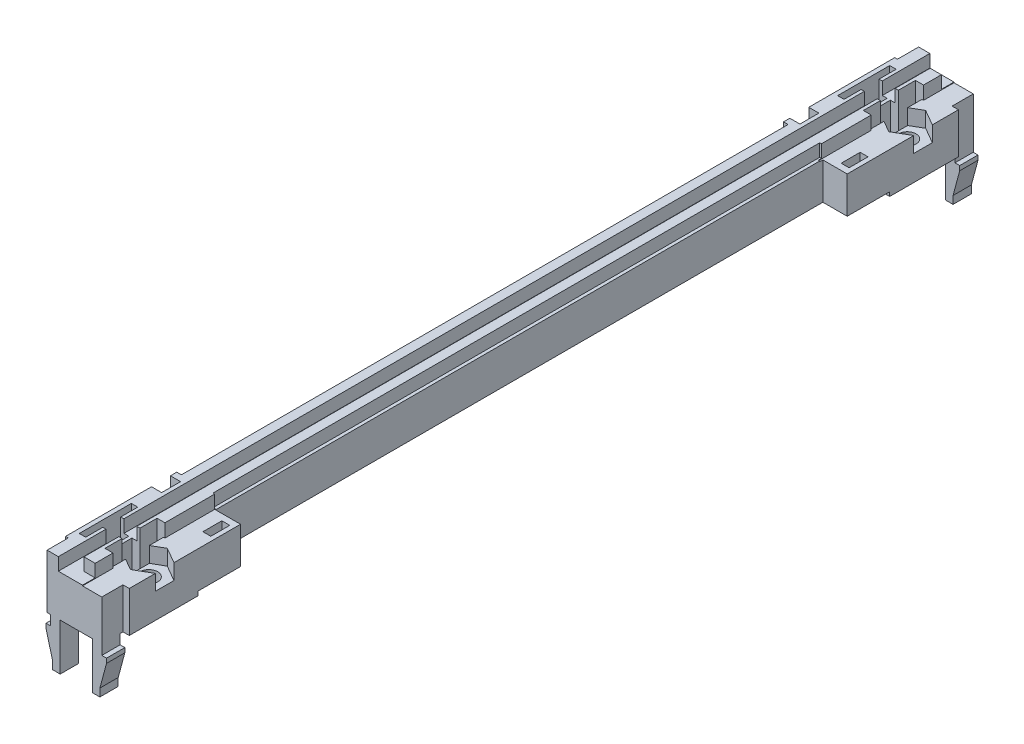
ISO-10303-21;
HEADER;
FILE_DESCRIPTION(('STEP AP214'),'2;1');
FILE_NAME('part.step','',(''),(''),'','','');
FILE_SCHEMA(('AUTOMOTIVE_DESIGN { 1 0 10303 214 1 1 1 1 }'));
ENDSEC;
DATA;
#1=APPLICATION_CONTEXT('core data for automotive mechanical design processes');
#2=APPLICATION_PROTOCOL_DEFINITION('international standard','automotive_design',2000,#1);
#3=PRODUCT_CONTEXT('',#1,'mechanical');
#4=PRODUCT('Part','Part','',(#3));
#5=PRODUCT_RELATED_PRODUCT_CATEGORY('part','',(#4));
#6=PRODUCT_DEFINITION_FORMATION('','',#4);
#7=PRODUCT_DEFINITION_CONTEXT('part definition',#1,'design');
#8=PRODUCT_DEFINITION('design','',#6,#7);
#9=PRODUCT_DEFINITION_SHAPE('','',#8);
#10=(LENGTH_UNIT() NAMED_UNIT(*) SI_UNIT(.MILLI.,.METRE.));
#11=(NAMED_UNIT(*) PLANE_ANGLE_UNIT() SI_UNIT($,.RADIAN.));
#12=(NAMED_UNIT(*) SI_UNIT($,.STERADIAN.) SOLID_ANGLE_UNIT());
#13=UNCERTAINTY_MEASURE_WITH_UNIT(LENGTH_MEASURE(1.E-05),#10,'distance_accuracy_value','');
#14=(GEOMETRIC_REPRESENTATION_CONTEXT(3) GLOBAL_UNCERTAINTY_ASSIGNED_CONTEXT((#13)) GLOBAL_UNIT_ASSIGNED_CONTEXT((#10,
#11,#12)) REPRESENTATION_CONTEXT('',''));
#15=CARTESIAN_POINT('',(0.,0.,0.));
#16=DIRECTION('',(0.,0.,1.));
#17=DIRECTION('',(1.,0.,0.));
#18=AXIS2_PLACEMENT_3D('',#15,#16,#17);
#19=CARTESIAN_POINT('',(-2.24661,-2.269,-136.45));
#20=DIRECTION('',(-1.,0.,0.));
#21=DIRECTION('',(0.,0.,1.));
#22=AXIS2_PLACEMENT_3D('',#19,#20,#21);
#23=PLANE('',#22);
#24=DIRECTION('',(0.,1.,0.));
#25=VECTOR('',#24,1.);
#26=CARTESIAN_POINT('',(-2.24661,-2.269,-136.45));
#27=LINE('',#26,#25);
#28=CARTESIAN_POINT('',(-2.24661,-1.55,-136.45));
#29=VERTEX_POINT('',#28);
#30=CARTESIAN_POINT('',(-2.24661,-2.269,-136.45));
#31=VERTEX_POINT('',#30);
#32=EDGE_CURVE('E961',#29,#31,#27,.F.);
#33=ORIENTED_EDGE('',*,*,#32,.T.);
#34=DIRECTION('',(0.,0.,1.));
#35=VECTOR('',#34,1.);
#36=CARTESIAN_POINT('',(-2.24661,-2.269,-136.45));
#37=LINE('',#36,#35);
#38=CARTESIAN_POINT('',(-2.24661,-2.269,-133.55));
#39=VERTEX_POINT('',#38);
#40=EDGE_CURVE('E1625',#39,#31,#37,.F.);
#41=ORIENTED_EDGE('',*,*,#40,.F.);
#42=DIRECTION('',(0.,1.,0.));
#43=VECTOR('',#42,1.);
#44=CARTESIAN_POINT('',(-2.24661,0.,-133.55));
#45=LINE('',#44,#43);
#46=CARTESIAN_POINT('',(-2.24661,-1.55,-133.55));
#47=VERTEX_POINT('',#46);
#48=EDGE_CURVE('E1660',#47,#39,#45,.F.);
#49=ORIENTED_EDGE('',*,*,#48,.F.);
#50=DIRECTION('',(0.,0.,1.));
#51=VECTOR('',#50,1.);
#52=CARTESIAN_POINT('',(-2.24661,-1.55,-136.45));
#53=LINE('',#52,#51);
#54=EDGE_CURVE('E1667',#29,#47,#53,.T.);
#55=ORIENTED_EDGE('',*,*,#54,.F.);
#56=EDGE_LOOP('',(#33,#41,#49,#55));
#57=FACE_BOUND('',#56,.T.);
#58=ADVANCED_FACE('F15',(#57),#23,.T.);
#59=CARTESIAN_POINT('',(-1.2,-7.4,-136.45));
#60=DIRECTION('',(-1.,0.,0.));
#61=DIRECTION('',(0.,0.,1.));
#62=AXIS2_PLACEMENT_3D('',#59,#60,#61);
#63=PLANE('',#62);
#64=DIRECTION('',(0.,1.,0.));
#65=VECTOR('',#64,1.);
#66=CARTESIAN_POINT('',(-1.2,-7.4,-136.45));
#67=LINE('',#66,#65);
#68=CARTESIAN_POINT('',(-1.2,-6.17500169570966,-136.45));
#69=VERTEX_POINT('',#68);
#70=CARTESIAN_POINT('',(-1.2,-7.4,-136.45));
#71=VERTEX_POINT('',#70);
#72=EDGE_CURVE('E959',#69,#71,#67,.F.);
#73=ORIENTED_EDGE('',*,*,#72,.T.);
#74=DIRECTION('',(0.,0.,-1.));
#75=VECTOR('',#74,1.);
#76=CARTESIAN_POINT('',(-1.2,-7.4,-136.45));
#77=LINE('',#76,#75);
#78=CARTESIAN_POINT('',(-1.2,-7.4,-133.55));
#79=VERTEX_POINT('',#78);
#80=EDGE_CURVE('E1652',#79,#71,#77,.T.);
#81=ORIENTED_EDGE('',*,*,#80,.F.);
#82=DIRECTION('',(0.,1.,0.));
#83=VECTOR('',#82,1.);
#84=CARTESIAN_POINT('',(-1.2,0.,-133.55));
#85=LINE('',#84,#83);
#86=CARTESIAN_POINT('',(-1.2,-6.17500169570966,-133.55));
#87=VERTEX_POINT('',#86);
#88=EDGE_CURVE('E1658',#87,#79,#85,.F.);
#89=ORIENTED_EDGE('',*,*,#88,.F.);
#90=DIRECTION('',(0.,0.,1.));
#91=VECTOR('',#90,1.);
#92=CARTESIAN_POINT('',(-1.2,-6.17500169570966,-136.45));
#93=LINE('',#92,#91);
#94=EDGE_CURVE('E1622',#69,#87,#93,.T.);
#95=ORIENTED_EDGE('',*,*,#94,.F.);
#96=EDGE_LOOP('',(#73,#81,#89,#95));
#97=FACE_BOUND('',#96,.T.);
#98=ADVANCED_FACE('F2589',(#97),#63,.T.);
#99=CARTESIAN_POINT('',(6.28,-7.4,-136.45));
#100=DIRECTION('',(1.,0.,0.));
#101=DIRECTION('',(0.,0.,-1.));
#102=AXIS2_PLACEMENT_3D('',#99,#100,#101);
#103=PLANE('',#102);
#104=DIRECTION('',(0.,1.,0.));
#105=VECTOR('',#104,1.);
#106=CARTESIAN_POINT('',(6.28,-7.4,-136.45));
#107=LINE('',#106,#105);
#108=CARTESIAN_POINT('',(6.28,-7.4,-136.45));
#109=VERTEX_POINT('',#108);
#110=CARTESIAN_POINT('',(6.28,-6.17500169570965,-136.45));
#111=VERTEX_POINT('',#110);
#112=EDGE_CURVE('E928',#109,#111,#107,.T.);
#113=ORIENTED_EDGE('',*,*,#112,.T.);
#114=DIRECTION('',(0.,0.,1.));
#115=VECTOR('',#114,1.);
#116=CARTESIAN_POINT('',(6.28,-6.17500169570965,-136.45));
#117=LINE('',#116,#115);
#118=CARTESIAN_POINT('',(6.28,-6.17500169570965,-133.55));
#119=VERTEX_POINT('',#118);
#120=EDGE_CURVE('E1616',#119,#111,#117,.F.);
#121=ORIENTED_EDGE('',*,*,#120,.F.);
#122=DIRECTION('',(0.,1.,0.));
#123=VECTOR('',#122,1.);
#124=CARTESIAN_POINT('',(6.28,0.,-133.55));
#125=LINE('',#124,#123);
#126=CARTESIAN_POINT('',(6.28,-7.4,-133.55));
#127=VERTEX_POINT('',#126);
#128=EDGE_CURVE('E1645',#119,#127,#125,.F.);
#129=ORIENTED_EDGE('',*,*,#128,.T.);
#130=DIRECTION('',(0.,0.,-1.));
#131=VECTOR('',#130,1.);
#132=CARTESIAN_POINT('',(6.28,-7.4,-136.45));
#133=LINE('',#132,#131);
#134=EDGE_CURVE('E1635',#109,#127,#133,.F.);
#135=ORIENTED_EDGE('',*,*,#134,.F.);
#136=EDGE_LOOP('',(#113,#121,#129,#135));
#137=FACE_BOUND('',#136,.T.);
#138=ADVANCED_FACE('F2573',(#137),#103,.T.);
#139=CARTESIAN_POINT('',(7.32661,-2.269,-136.45));
#140=DIRECTION('',(1.,0.,0.));
#141=DIRECTION('',(0.,0.,-1.));
#142=AXIS2_PLACEMENT_3D('',#139,#140,#141);
#143=PLANE('',#142);
#144=DIRECTION('',(0.,1.,0.));
#145=VECTOR('',#144,1.);
#146=CARTESIAN_POINT('',(7.32661,-2.269,-136.45));
#147=LINE('',#146,#145);
#148=CARTESIAN_POINT('',(7.32661,-2.269,-136.45));
#149=VERTEX_POINT('',#148);
#150=CARTESIAN_POINT('',(7.32661,-1.55,-136.45));
#151=VERTEX_POINT('',#150);
#152=EDGE_CURVE('E916',#149,#151,#147,.T.);
#153=ORIENTED_EDGE('',*,*,#152,.T.);
#154=DIRECTION('',(0.,0.,1.));
#155=VECTOR('',#154,1.);
#156=CARTESIAN_POINT('',(7.32661,-1.55,-136.45));
#157=LINE('',#156,#155);
#158=CARTESIAN_POINT('',(7.32661,-1.55,-133.55));
#159=VERTEX_POINT('',#158);
#160=EDGE_CURVE('E919',#159,#151,#157,.F.);
#161=ORIENTED_EDGE('',*,*,#160,.F.);
#162=DIRECTION('',(0.,1.,0.));
#163=VECTOR('',#162,1.);
#164=CARTESIAN_POINT('',(7.32661,0.,-133.55));
#165=LINE('',#164,#163);
#166=CARTESIAN_POINT('',(7.32661,-2.269,-133.55));
#167=VERTEX_POINT('',#166);
#168=EDGE_CURVE('E1647',#159,#167,#165,.F.);
#169=ORIENTED_EDGE('',*,*,#168,.T.);
#170=DIRECTION('',(0.,0.,1.));
#171=VECTOR('',#170,1.);
#172=CARTESIAN_POINT('',(7.32661,-2.269,-136.45));
#173=LINE('',#172,#171);
#174=EDGE_CURVE('E922',#149,#167,#173,.T.);
#175=ORIENTED_EDGE('',*,*,#174,.F.);
#176=EDGE_LOOP('',(#153,#161,#169,#175));
#177=FACE_BOUND('',#176,.T.);
#178=ADVANCED_FACE('F918',(#177),#143,.T.);
#179=CARTESIAN_POINT('',(-2.24661,-2.269,1.45));
#180=DIRECTION('',(1.,0.,0.));
#181=DIRECTION('',(0.,0.,-1.));
#182=AXIS2_PLACEMENT_3D('',#179,#180,#181);
#183=PLANE('',#182);
#184=DIRECTION('',(0.,0.,1.));
#185=VECTOR('',#184,1.);
#186=CARTESIAN_POINT('',(-2.24661,-2.269,1.45));
#187=LINE('',#186,#185);
#188=CARTESIAN_POINT('',(-2.24661,-2.269,-1.45));
#189=VERTEX_POINT('',#188);
#190=CARTESIAN_POINT('',(-2.24661,-2.269,1.45));
#191=VERTEX_POINT('',#190);
#192=EDGE_CURVE('E1519',#189,#191,#187,.T.);
#193=ORIENTED_EDGE('',*,*,#192,.T.);
#194=DIRECTION('',(0.,1.,0.));
#195=VECTOR('',#194,1.);
#196=CARTESIAN_POINT('',(-2.24661,-2.269,1.45));
#197=LINE('',#196,#195);
#198=CARTESIAN_POINT('',(-2.24661,-1.55,1.45));
#199=VERTEX_POINT('',#198);
#200=EDGE_CURVE('E927',#199,#191,#197,.F.);
#201=ORIENTED_EDGE('',*,*,#200,.F.);
#202=DIRECTION('',(0.,0.,1.));
#203=VECTOR('',#202,1.);
#204=CARTESIAN_POINT('',(-2.24661,-1.55,1.45));
#205=LINE('',#204,#203);
#206=CARTESIAN_POINT('',(-2.24661,-1.55,-1.45));
#207=VERTEX_POINT('',#206);
#208=EDGE_CURVE('E1581',#199,#207,#205,.F.);
#209=ORIENTED_EDGE('',*,*,#208,.T.);
#210=DIRECTION('',(0.,1.,0.));
#211=VECTOR('',#210,1.);
#212=CARTESIAN_POINT('',(-2.24661,0.,-1.45));
#213=LINE('',#212,#211);
#214=EDGE_CURVE('E1567',#189,#207,#213,.T.);
#215=ORIENTED_EDGE('',*,*,#214,.F.);
#216=EDGE_LOOP('',(#193,#201,#209,#215));
#217=FACE_BOUND('',#216,.T.);
#218=ADVANCED_FACE('F2661',(#217),#183,.F.);
#219=CARTESIAN_POINT('',(-1.2,-7.4,1.45));
#220=DIRECTION('',(1.,0.,0.));
#221=DIRECTION('',(0.,0.,-1.));
#222=AXIS2_PLACEMENT_3D('',#219,#220,#221);
#223=PLANE('',#222);
#224=DIRECTION('',(0.,0.,1.));
#225=VECTOR('',#224,1.);
#226=CARTESIAN_POINT('',(-1.2,-7.4,1.45));
#227=LINE('',#226,#225);
#228=CARTESIAN_POINT('',(-1.2,-7.4,-1.45));
#229=VERTEX_POINT('',#228);
#230=CARTESIAN_POINT('',(-1.2,-7.4,1.45));
#231=VERTEX_POINT('',#230);
#232=EDGE_CURVE('E1578',#229,#231,#227,.T.);
#233=ORIENTED_EDGE('',*,*,#232,.T.);
#234=DIRECTION('',(0.,1.,0.));
#235=VECTOR('',#234,1.);
#236=CARTESIAN_POINT('',(-1.2,-7.4,1.45));
#237=LINE('',#236,#235);
#238=CARTESIAN_POINT('',(-1.2,-6.17500169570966,1.45));
#239=VERTEX_POINT('',#238);
#240=EDGE_CURVE('E955',#239,#231,#237,.F.);
#241=ORIENTED_EDGE('',*,*,#240,.F.);
#242=DIRECTION('',(0.,0.,1.));
#243=VECTOR('',#242,1.);
#244=CARTESIAN_POINT('',(-1.2,-6.17500169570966,1.45));
#245=LINE('',#244,#243);
#246=CARTESIAN_POINT('',(-1.2,-6.17500169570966,-1.45));
#247=VERTEX_POINT('',#246);
#248=EDGE_CURVE('E1516',#239,#247,#245,.F.);
#249=ORIENTED_EDGE('',*,*,#248,.T.);
#250=DIRECTION('',(0.,1.,0.));
#251=VECTOR('',#250,1.);
#252=CARTESIAN_POINT('',(-1.2,0.,-1.45));
#253=LINE('',#252,#251);
#254=EDGE_CURVE('E1569',#229,#247,#253,.T.);
#255=ORIENTED_EDGE('',*,*,#254,.F.);
#256=EDGE_LOOP('',(#233,#241,#249,#255));
#257=FACE_BOUND('',#256,.T.);
#258=ADVANCED_FACE('F2657',(#257),#223,.F.);
#259=CARTESIAN_POINT('',(6.28,-7.4,1.45));
#260=DIRECTION('',(-1.,0.,0.));
#261=DIRECTION('',(0.,0.,1.));
#262=AXIS2_PLACEMENT_3D('',#259,#260,#261);
#263=PLANE('',#262);
#264=DIRECTION('',(0.,0.,1.));
#265=VECTOR('',#264,1.);
#266=CARTESIAN_POINT('',(6.28,-6.17500169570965,1.45));
#267=LINE('',#266,#265);
#268=CARTESIAN_POINT('',(6.28,-6.17500169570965,-1.45));
#269=VERTEX_POINT('',#268);
#270=CARTESIAN_POINT('',(6.28,-6.17500169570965,1.45));
#271=VERTEX_POINT('',#270);
#272=EDGE_CURVE('E1510',#269,#271,#267,.T.);
#273=ORIENTED_EDGE('',*,*,#272,.T.);
#274=DIRECTION('',(0.,1.,0.));
#275=VECTOR('',#274,1.);
#276=CARTESIAN_POINT('',(6.28,-7.4,1.45));
#277=LINE('',#276,#275);
#278=CARTESIAN_POINT('',(6.28,-7.4,1.45));
#279=VERTEX_POINT('',#278);
#280=EDGE_CURVE('E953',#279,#271,#277,.T.);
#281=ORIENTED_EDGE('',*,*,#280,.F.);
#282=DIRECTION('',(0.,0.,1.));
#283=VECTOR('',#282,1.);
#284=CARTESIAN_POINT('',(6.28,-7.4,1.45));
#285=LINE('',#284,#283);
#286=CARTESIAN_POINT('',(6.28,-7.4,-1.45));
#287=VERTEX_POINT('',#286);
#288=EDGE_CURVE('E1560',#279,#287,#285,.F.);
#289=ORIENTED_EDGE('',*,*,#288,.T.);
#290=DIRECTION('',(0.,1.,0.));
#291=VECTOR('',#290,1.);
#292=CARTESIAN_POINT('',(6.28,0.,-1.45));
#293=LINE('',#292,#291);
#294=EDGE_CURVE('E1554',#287,#269,#293,.T.);
#295=ORIENTED_EDGE('',*,*,#294,.T.);
#296=EDGE_LOOP('',(#273,#281,#289,#295));
#297=FACE_BOUND('',#296,.T.);
#298=ADVANCED_FACE('F2653',(#297),#263,.F.);
#299=CARTESIAN_POINT('',(7.32661,-2.269,1.45));
#300=DIRECTION('',(-1.,0.,0.));
#301=DIRECTION('',(0.,0.,1.));
#302=AXIS2_PLACEMENT_3D('',#299,#300,#301);
#303=PLANE('',#302);
#304=DIRECTION('',(0.,0.,1.));
#305=VECTOR('',#304,1.);
#306=CARTESIAN_POINT('',(7.32661,-1.55,1.45));
#307=LINE('',#306,#305);
#308=CARTESIAN_POINT('',(7.32661,-1.55,-1.45));
#309=VERTEX_POINT('',#308);
#310=CARTESIAN_POINT('',(7.32661,-1.55,1.45));
#311=VERTEX_POINT('',#310);
#312=EDGE_CURVE('E1527',#309,#311,#307,.T.);
#313=ORIENTED_EDGE('',*,*,#312,.T.);
#314=DIRECTION('',(0.,1.,0.));
#315=VECTOR('',#314,1.);
#316=CARTESIAN_POINT('',(7.32661,-2.269,1.45));
#317=LINE('',#316,#315);
#318=CARTESIAN_POINT('',(7.32661,-2.269,1.45));
#319=VERTEX_POINT('',#318);
#320=EDGE_CURVE('E951',#319,#311,#317,.T.);
#321=ORIENTED_EDGE('',*,*,#320,.F.);
#322=DIRECTION('',(0.,0.,1.));
#323=VECTOR('',#322,1.);
#324=CARTESIAN_POINT('',(7.32661,-2.269,1.45));
#325=LINE('',#324,#323);
#326=CARTESIAN_POINT('',(7.32661,-2.269,-1.45));
#327=VERTEX_POINT('',#326);
#328=EDGE_CURVE('E1507',#319,#327,#325,.F.);
#329=ORIENTED_EDGE('',*,*,#328,.T.);
#330=DIRECTION('',(0.,1.,0.));
#331=VECTOR('',#330,1.);
#332=CARTESIAN_POINT('',(7.32661,0.,-1.45));
#333=LINE('',#332,#331);
#334=EDGE_CURVE('E1551',#327,#309,#333,.T.);
#335=ORIENTED_EDGE('',*,*,#334,.T.);
#336=EDGE_LOOP('',(#313,#321,#329,#335));
#337=FACE_BOUND('',#336,.T.);
#338=ADVANCED_FACE('F2650',(#337),#303,.F.);
#339=CARTESIAN_POINT('',(1.755,8.55,-20.));
#340=DIRECTION('',(1.,0.,0.));
#341=DIRECTION('',(0.,1.,0.));
#342=AXIS2_PLACEMENT_3D('',#339,#340,#341);
#343=PLANE('',#342);
#344=DIRECTION('',(0.,0.,-1.));
#345=VECTOR('',#344,1.);
#346=CARTESIAN_POINT('',(1.755,6.55,-20.));
#347=LINE('',#346,#345);
#348=CARTESIAN_POINT('',(1.755,6.55,-134.45));
#349=VERTEX_POINT('',#348);
#350=CARTESIAN_POINT('',(1.755,6.55,-128.925));
#351=VERTEX_POINT('',#350);
#352=EDGE_CURVE('E1488',#349,#351,#347,.F.);
#353=ORIENTED_EDGE('',*,*,#352,.T.);
#354=DIRECTION('',(0.,1.,0.));
#355=VECTOR('',#354,1.);
#356=CARTESIAN_POINT('',(1.755,23.7329674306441,-128.925));
#357=LINE('',#356,#355);
#358=CARTESIAN_POINT('',(1.755,8.55,-128.925));
#359=VERTEX_POINT('',#358);
#360=EDGE_CURVE('E1683',#351,#359,#357,.T.);
#361=ORIENTED_EDGE('',*,*,#360,.T.);
#362=DIRECTION('',(0.,0.,-1.));
#363=VECTOR('',#362,1.);
#364=CARTESIAN_POINT('',(1.755,8.55,13.25));
#365=LINE('',#364,#363);
#366=CARTESIAN_POINT('',(1.755,8.55,-134.45));
#367=VERTEX_POINT('',#366);
#368=EDGE_CURVE('E1695',#359,#367,#365,.T.);
#369=ORIENTED_EDGE('',*,*,#368,.T.);
#370=DIRECTION('',(0.,1.,0.));
#371=VECTOR('',#370,1.);
#372=CARTESIAN_POINT('',(1.755,6.55,-134.45));
#373=LINE('',#372,#371);
#374=EDGE_CURVE('E911',#349,#367,#373,.T.);
#375=ORIENTED_EDGE('',*,*,#374,.F.);
#376=EDGE_LOOP('',(#353,#361,#369,#375));
#377=FACE_BOUND('',#376,.T.);
#378=ADVANCED_FACE('F2551',(#377),#343,.F.);
#379=CARTESIAN_POINT('',(1.755,8.55,-20.));
#380=DIRECTION('',(1.,0.,0.));
#381=DIRECTION('',(0.,1.,0.));
#382=AXIS2_PLACEMENT_3D('',#379,#380,#381);
#383=PLANE('',#382);
#384=DIRECTION('',(0.,1.,0.));
#385=VECTOR('',#384,1.);
#386=CARTESIAN_POINT('',(1.755,6.55,-0.55));
#387=LINE('',#386,#385);
#388=CARTESIAN_POINT('',(1.755,6.55,-0.549999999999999));
#389=VERTEX_POINT('',#388);
#390=CARTESIAN_POINT('',(1.755,8.55,-0.55));
#391=VERTEX_POINT('',#390);
#392=EDGE_CURVE('E1502',#389,#391,#387,.T.);
#393=ORIENTED_EDGE('',*,*,#392,.T.);
#394=DIRECTION('',(0.,0.,-1.));
#395=VECTOR('',#394,1.);
#396=CARTESIAN_POINT('',(1.755,8.55,13.25));
#397=LINE('',#396,#395);
#398=CARTESIAN_POINT('',(1.755,8.55,-6.075));
#399=VERTEX_POINT('',#398);
#400=EDGE_CURVE('E1493',#391,#399,#397,.T.);
#401=ORIENTED_EDGE('',*,*,#400,.T.);
#402=DIRECTION('',(0.,1.,0.));
#403=VECTOR('',#402,1.);
#404=CARTESIAN_POINT('',(1.755,23.7329674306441,-6.075));
#405=LINE('',#404,#403);
#406=CARTESIAN_POINT('',(1.755,6.55,-6.075));
#407=VERTEX_POINT('',#406);
#408=EDGE_CURVE('E1593',#407,#399,#405,.T.);
#409=ORIENTED_EDGE('',*,*,#408,.F.);
#410=DIRECTION('',(0.,0.,-1.));
#411=VECTOR('',#410,1.);
#412=CARTESIAN_POINT('',(1.755,6.55,-20.));
#413=LINE('',#412,#411);
#414=EDGE_CURVE('E1472',#407,#389,#413,.F.);
#415=ORIENTED_EDGE('',*,*,#414,.T.);
#416=EDGE_LOOP('',(#393,#401,#409,#415));
#417=FACE_BOUND('',#416,.T.);
#418=ADVANCED_FACE('F2643',(#417),#383,.F.);
#419=CARTESIAN_POINT('',(1.755,8.55,-20.));
#420=DIRECTION('',(1.,0.,0.));
#421=DIRECTION('',(0.,1.,0.));
#422=AXIS2_PLACEMENT_3D('',#419,#420,#421);
#423=PLANE('',#422);
#424=DIRECTION('',(0.,1.,0.));
#425=VECTOR('',#424,1.);
#426=CARTESIAN_POINT('',(1.755,23.7329674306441,-126.075));
#427=LINE('',#426,#425);
#428=CARTESIAN_POINT('',(1.755,8.55,-126.075));
#429=VERTEX_POINT('',#428);
#430=CARTESIAN_POINT('',(1.755,6.55,-126.075));
#431=VERTEX_POINT('',#430);
#432=EDGE_CURVE('E1671',#429,#431,#427,.F.);
#433=ORIENTED_EDGE('',*,*,#432,.T.);
#434=DIRECTION('',(0.,0.,-1.));
#435=VECTOR('',#434,1.);
#436=CARTESIAN_POINT('',(1.755,6.55,-20.));
#437=LINE('',#436,#435);
#438=CARTESIAN_POINT('',(1.755,6.55,-8.925));
#439=VERTEX_POINT('',#438);
#440=EDGE_CURVE('E1480',#431,#439,#437,.F.);
#441=ORIENTED_EDGE('',*,*,#440,.T.);
#442=DIRECTION('',(0.,1.,0.));
#443=VECTOR('',#442,1.);
#444=CARTESIAN_POINT('',(1.755,23.7329674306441,-8.925));
#445=LINE('',#444,#443);
#446=CARTESIAN_POINT('',(1.755,8.55,-8.925));
#447=VERTEX_POINT('',#446);
#448=EDGE_CURVE('E1587',#447,#439,#445,.F.);
#449=ORIENTED_EDGE('',*,*,#448,.F.);
#450=DIRECTION('',(0.,0.,-1.));
#451=VECTOR('',#450,1.);
#452=CARTESIAN_POINT('',(1.755,8.55,13.25));
#453=LINE('',#452,#451);
#454=EDGE_CURVE('E1422',#447,#429,#453,.T.);
#455=ORIENTED_EDGE('',*,*,#454,.T.);
#456=EDGE_LOOP('',(#433,#441,#449,#455));
#457=FACE_BOUND('',#456,.T.);
#458=ADVANCED_FACE('F2640',(#457),#423,.F.);
#459=CARTESIAN_POINT('',(4.,6.55,-134.45));
#460=DIRECTION('',(0.,0.,-1.));
#461=DIRECTION('',(-1.,0.,0.));
#462=AXIS2_PLACEMENT_3D('',#459,#460,#461);
#463=PLANE('',#462);
#464=DIRECTION('',(0.,1.,0.));
#465=VECTOR('',#464,1.);
#466=CARTESIAN_POINT('',(3.53,8.55,-134.45));
#467=LINE('',#466,#465);
#468=CARTESIAN_POINT('',(3.53,6.55,-134.45));
#469=VERTEX_POINT('',#468);
#470=CARTESIAN_POINT('',(3.53,8.55,-134.45));
#471=VERTEX_POINT('',#470);
#472=EDGE_CURVE('E1412',#469,#471,#467,.T.);
#473=ORIENTED_EDGE('',*,*,#472,.F.);
#474=DIRECTION('',(1.,0.,0.));
#475=VECTOR('',#474,1.);
#476=CARTESIAN_POINT('',(-0.295,6.55,-134.45));
#477=LINE('',#476,#475);
#478=EDGE_CURVE('E1491',#469,#349,#477,.F.);
#479=ORIENTED_EDGE('',*,*,#478,.T.);
#480=ORIENTED_EDGE('',*,*,#374,.T.);
#481=DIRECTION('',(1.,0.,0.));
#482=VECTOR('',#481,1.);
#483=CARTESIAN_POINT('',(7.58,8.55,-134.45));
#484=LINE('',#483,#482);
#485=EDGE_CURVE('E1693',#367,#471,#484,.T.);
#486=ORIENTED_EDGE('',*,*,#485,.T.);
#487=EDGE_LOOP('',(#473,#479,#480,#486));
#488=FACE_BOUND('',#487,.T.);
#489=ADVANCED_FACE('F2554',(#488),#463,.T.);
#490=CARTESIAN_POINT('',(7.32661,-1.55,-136.45));
#491=DIRECTION('',(0.,1.,0.));
#492=DIRECTION('',(-1.,0.,0.));
#493=AXIS2_PLACEMENT_3D('',#490,#491,#492);
#494=PLANE('',#493);
#495=DIRECTION('',(-1.,0.,0.));
#496=VECTOR('',#495,1.);
#497=CARTESIAN_POINT('',(7.32661,-1.55,-136.45));
#498=LINE('',#497,#496);
#499=CARTESIAN_POINT('',(6.58,-1.55,-136.45));
#500=VERTEX_POINT('',#499);
#501=EDGE_CURVE('E934',#151,#500,#498,.T.);
#502=ORIENTED_EDGE('',*,*,#501,.T.);
#503=DIRECTION('',(0.,0.,1.));
#504=VECTOR('',#503,1.);
#505=CARTESIAN_POINT('',(6.58,-1.55,-136.45));
#506=LINE('',#505,#504);
#507=CARTESIAN_POINT('',(6.58,-1.55,-133.55));
#508=VERTEX_POINT('',#507);
#509=EDGE_CURVE('E1400',#508,#500,#506,.F.);
#510=ORIENTED_EDGE('',*,*,#509,.F.);
#511=DIRECTION('',(-1.,0.,0.));
#512=VECTOR('',#511,1.);
#513=CARTESIAN_POINT('',(0.,-1.55,-133.55));
#514=LINE('',#513,#512);
#515=EDGE_CURVE('E936',#508,#159,#514,.F.);
#516=ORIENTED_EDGE('',*,*,#515,.T.);
#517=ORIENTED_EDGE('',*,*,#160,.T.);
#518=EDGE_LOOP('',(#502,#510,#516,#517));
#519=FACE_BOUND('',#518,.T.);
#520=ADVANCED_FACE('F932',(#519),#494,.T.);
#521=CARTESIAN_POINT('',(0.,0.,-119.5));
#522=DIRECTION('',(0.,0.,-1.));
#523=DIRECTION('',(-1.,0.,0.));
#524=AXIS2_PLACEMENT_3D('',#521,#522,#523);
#525=PLANE('',#524);
#526=DIRECTION('',(0.,1.,0.));
#527=VECTOR('',#526,1.);
#528=CARTESIAN_POINT('',(5.63,7.,-119.5));
#529=LINE('',#528,#527);
#530=CARTESIAN_POINT('',(5.63,6.45,-119.5));
#531=VERTEX_POINT('',#530);
#532=CARTESIAN_POINT('',(5.63,4.,-119.5));
#533=VERTEX_POINT('',#532);
#534=EDGE_CURVE('E1376',#531,#533,#529,.F.);
#535=ORIENTED_EDGE('',*,*,#534,.T.);
#536=DIRECTION('',(1.,0.,0.));
#537=VECTOR('',#536,1.);
#538=CARTESIAN_POINT('',(5.63,4.,-119.5));
#539=LINE('',#538,#537);
#540=CARTESIAN_POINT('',(6.88,4.,-119.5));
#541=VERTEX_POINT('',#540);
#542=EDGE_CURVE('E946',#533,#541,#539,.T.);
#543=ORIENTED_EDGE('',*,*,#542,.T.);
#544=DIRECTION('',(0.,1.,0.));
#545=VECTOR('',#544,1.);
#546=CARTESIAN_POINT('',(6.88,7.,-119.5));
#547=LINE('',#546,#545);
#548=CARTESIAN_POINT('',(6.88,6.45,-119.5));
#549=VERTEX_POINT('',#548);
#550=EDGE_CURVE('E1379',#541,#549,#547,.T.);
#551=ORIENTED_EDGE('',*,*,#550,.T.);
#552=DIRECTION('',(-1.,0.,0.));
#553=VECTOR('',#552,1.);
#554=CARTESIAN_POINT('',(0.,6.45,-119.5));
#555=LINE('',#554,#553);
#556=EDGE_CURVE('E944',#531,#549,#555,.F.);
#557=ORIENTED_EDGE('',*,*,#556,.F.);
#558=EDGE_LOOP('',(#535,#543,#551,#557));
#559=FACE_BOUND('',#558,.T.);
#560=ADVANCED_FACE('F1703',(#559),#525,.F.);
#561=CARTESIAN_POINT('',(5.63,4.,-116.5));
#562=DIRECTION('',(0.,-1.,0.));
#563=DIRECTION('',(0.,0.,-1.));
#564=AXIS2_PLACEMENT_3D('',#561,#562,#563);
#565=PLANE('',#564);
#566=DIRECTION('',(0.,0.,1.));
#567=VECTOR('',#566,1.);
#568=CARTESIAN_POINT('',(5.63,4.,-116.5));
#569=LINE('',#568,#567);
#570=CARTESIAN_POINT('',(5.63,4.,-116.5));
#571=VERTEX_POINT('',#570);
#572=EDGE_CURVE('E1373',#533,#571,#569,.T.);
#573=ORIENTED_EDGE('',*,*,#572,.T.);
#574=DIRECTION('',(-1.,0.,0.));
#575=VECTOR('',#574,1.);
#576=CARTESIAN_POINT('',(0.,4.,-116.5));
#577=LINE('',#576,#575);
#578=CARTESIAN_POINT('',(6.88,4.,-116.5));
#579=VERTEX_POINT('',#578);
#580=EDGE_CURVE('E1700',#579,#571,#577,.T.);
#581=ORIENTED_EDGE('',*,*,#580,.F.);
#582=DIRECTION('',(0.,0.,1.));
#583=VECTOR('',#582,1.);
#584=CARTESIAN_POINT('',(6.88,4.,-116.5));
#585=LINE('',#584,#583);
#586=EDGE_CURVE('E1382',#579,#541,#585,.F.);
#587=ORIENTED_EDGE('',*,*,#586,.T.);
#588=ORIENTED_EDGE('',*,*,#542,.F.);
#589=EDGE_LOOP('',(#573,#581,#587,#588));
#590=FACE_BOUND('',#589,.T.);
#591=ADVANCED_FACE('F1712',(#590),#565,.F.);
#592=CARTESIAN_POINT('',(0.,0.,-116.5));
#593=DIRECTION('',(0.,0.,-1.));
#594=DIRECTION('',(-1.,0.,0.));
#595=AXIS2_PLACEMENT_3D('',#592,#593,#594);
#596=PLANE('',#595);
#597=DIRECTION('',(0.,1.,0.));
#598=VECTOR('',#597,1.);
#599=CARTESIAN_POINT('',(5.63,7.,-116.5));
#600=LINE('',#599,#598);
#601=CARTESIAN_POINT('',(5.63,6.45,-116.5));
#602=VERTEX_POINT('',#601);
#603=EDGE_CURVE('E1370',#571,#602,#600,.T.);
#604=ORIENTED_EDGE('',*,*,#603,.T.);
#605=DIRECTION('',(-1.,0.,0.));
#606=VECTOR('',#605,1.);
#607=CARTESIAN_POINT('',(0.,6.45,-116.5));
#608=LINE('',#607,#606);
#609=CARTESIAN_POINT('',(6.88,6.45,-116.5));
#610=VERTEX_POINT('',#609);
#611=EDGE_CURVE('E1698',#602,#610,#608,.F.);
#612=ORIENTED_EDGE('',*,*,#611,.T.);
#613=DIRECTION('',(0.,1.,0.));
#614=VECTOR('',#613,1.);
#615=CARTESIAN_POINT('',(6.88,7.,-116.5));
#616=LINE('',#615,#614);
#617=EDGE_CURVE('E1385',#610,#579,#616,.F.);
#618=ORIENTED_EDGE('',*,*,#617,.T.);
#619=ORIENTED_EDGE('',*,*,#580,.T.);
#620=EDGE_LOOP('',(#604,#612,#618,#619));
#621=FACE_BOUND('',#620,.T.);
#622=ADVANCED_FACE('F1715',(#621),#596,.T.);
#623=CARTESIAN_POINT('',(7.58,8.55,13.25));
#624=DIRECTION('',(0.,-1.,0.));
#625=DIRECTION('',(0.,0.,-1.));
#626=AXIS2_PLACEMENT_3D('',#623,#624,#625);
#627=PLANE('',#626);
#628=ORIENTED_EDGE('',*,*,#368,.F.);
#629=DIRECTION('',(-1.,0.,0.));
#630=VECTOR('',#629,1.);
#631=CARTESIAN_POINT('',(0.98,8.55,-128.925));
#632=LINE('',#631,#630);
#633=CARTESIAN_POINT('',(2.255,8.55,-128.925));
#634=VERTEX_POINT('',#633);
#635=EDGE_CURVE('E1681',#359,#634,#632,.F.);
#636=ORIENTED_EDGE('',*,*,#635,.T.);
#637=DIRECTION('',(0.,0.,1.));
#638=VECTOR('',#637,1.);
#639=CARTESIAN_POINT('',(2.255,8.55,-128.925));
#640=LINE('',#639,#638);
#641=CARTESIAN_POINT('',(2.255,8.55,-131.625));
#642=VERTEX_POINT('',#641);
#643=EDGE_CURVE('E1349',#634,#642,#640,.F.);
#644=ORIENTED_EDGE('',*,*,#643,.T.);
#645=DIRECTION('',(-1.,0.,0.));
#646=VECTOR('',#645,1.);
#647=CARTESIAN_POINT('',(2.255,8.55,-131.625));
#648=LINE('',#647,#646);
#649=CARTESIAN_POINT('',(3.53,8.55,-131.625));
#650=VERTEX_POINT('',#649);
#651=EDGE_CURVE('E1688',#642,#650,#648,.F.);
#652=ORIENTED_EDGE('',*,*,#651,.T.);
#653=DIRECTION('',(0.,0.,-1.));
#654=VECTOR('',#653,1.);
#655=CARTESIAN_POINT('',(3.53,8.55,-131.625));
#656=LINE('',#655,#654);
#657=EDGE_CURVE('E1410',#471,#650,#656,.F.);
#658=ORIENTED_EDGE('',*,*,#657,.F.);
#659=ORIENTED_EDGE('',*,*,#485,.F.);
#660=EDGE_LOOP('',(#628,#636,#644,#652,#658,#659));
#661=FACE_BOUND('',#660,.T.);
#662=ADVANCED_FACE('F2543',(#661),#627,.F.);
#663=CARTESIAN_POINT('',(2.255,23.7329674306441,-131.625));
#664=DIRECTION('',(0.,0.,-1.));
#665=DIRECTION('',(-1.,0.,0.));
#666=AXIS2_PLACEMENT_3D('',#663,#664,#665);
#667=PLANE('',#666);
#668=DIRECTION('',(-1.,0.,0.));
#669=VECTOR('',#668,1.);
#670=CARTESIAN_POINT('',(2.255,6.45,-131.625));
#671=LINE('',#670,#669);
#672=CARTESIAN_POINT('',(3.53,6.45,-131.625));
#673=VERTEX_POINT('',#672);
#674=CARTESIAN_POINT('',(3.276,6.45,-131.625));
#675=VERTEX_POINT('',#674);
#676=EDGE_CURVE('E1686',#673,#675,#671,.T.);
#677=ORIENTED_EDGE('',*,*,#676,.F.);
#678=DIRECTION('',(0.,1.,0.));
#679=VECTOR('',#678,1.);
#680=CARTESIAN_POINT('',(3.53,8.55,-131.625));
#681=LINE('',#680,#679);
#682=EDGE_CURVE('E1407',#650,#673,#681,.F.);
#683=ORIENTED_EDGE('',*,*,#682,.F.);
#684=ORIENTED_EDGE('',*,*,#651,.F.);
#685=DIRECTION('',(0.,1.,0.));
#686=VECTOR('',#685,1.);
#687=CARTESIAN_POINT('',(2.255,23.7329674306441,-131.625));
#688=LINE('',#687,#686);
#689=CARTESIAN_POINT('',(2.255,0.,-131.625));
#690=VERTEX_POINT('',#689);
#691=EDGE_CURVE('E1346',#642,#690,#688,.F.);
#692=ORIENTED_EDGE('',*,*,#691,.T.);
#693=DIRECTION('',(-1.,0.,0.));
#694=VECTOR('',#693,1.);
#695=CARTESIAN_POINT('',(2.255,0.,-131.625));
#696=LINE('',#695,#694);
#697=CARTESIAN_POINT('',(3.276,0.,-131.625));
#698=VERTEX_POINT('',#697);
#699=EDGE_CURVE('E1691',#698,#690,#696,.T.);
#700=ORIENTED_EDGE('',*,*,#699,.F.);
#701=DIRECTION('',(0.,1.,0.));
#702=VECTOR('',#701,1.);
#703=CARTESIAN_POINT('',(3.276,23.7329674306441,-131.625));
#704=LINE('',#703,#702);
#705=EDGE_CURVE('E1358',#698,#675,#704,.T.);
#706=ORIENTED_EDGE('',*,*,#705,.T.);
#707=EDGE_LOOP('',(#677,#683,#684,#692,#700,#706));
#708=FACE_BOUND('',#707,.T.);
#709=ADVANCED_FACE('F2625',(#708),#667,.F.);
#710=CARTESIAN_POINT('',(0.98,23.7329674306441,-128.925));
#711=DIRECTION('',(0.,0.,-1.));
#712=DIRECTION('',(-1.,0.,0.));
#713=AXIS2_PLACEMENT_3D('',#710,#711,#712);
#714=PLANE('',#713);
#715=DIRECTION('',(-1.,0.,0.));
#716=VECTOR('',#715,1.);
#717=CARTESIAN_POINT('',(0.98,0.,-128.925));
#718=LINE('',#717,#716);
#719=CARTESIAN_POINT('',(2.255,0.,-128.925));
#720=VERTEX_POINT('',#719);
#721=CARTESIAN_POINT('',(0.98,0.,-128.925));
#722=VERTEX_POINT('',#721);
#723=EDGE_CURVE('E1679',#720,#722,#718,.T.);
#724=ORIENTED_EDGE('',*,*,#723,.F.);
#725=DIRECTION('',(0.,1.,0.));
#726=VECTOR('',#725,1.);
#727=CARTESIAN_POINT('',(2.255,23.7329674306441,-128.925));
#728=LINE('',#727,#726);
#729=EDGE_CURVE('E1352',#720,#634,#728,.T.);
#730=ORIENTED_EDGE('',*,*,#729,.T.);
#731=ORIENTED_EDGE('',*,*,#635,.F.);
#732=ORIENTED_EDGE('',*,*,#360,.F.);
#733=DIRECTION('',(1.,0.,0.));
#734=VECTOR('',#733,1.);
#735=CARTESIAN_POINT('',(-0.295,6.55,-128.925));
#736=LINE('',#735,#734);
#737=CARTESIAN_POINT('',(0.98,6.55,-128.925));
#738=VERTEX_POINT('',#737);
#739=EDGE_CURVE('E1486',#351,#738,#736,.F.);
#740=ORIENTED_EDGE('',*,*,#739,.T.);
#741=DIRECTION('',(0.,1.,0.));
#742=VECTOR('',#741,1.);
#743=CARTESIAN_POINT('',(0.98,23.7329674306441,-128.925));
#744=LINE('',#743,#742);
#745=EDGE_CURVE('E1340',#738,#722,#744,.F.);
#746=ORIENTED_EDGE('',*,*,#745,.T.);
#747=EDGE_LOOP('',(#724,#730,#731,#732,#740,#746));
#748=FACE_BOUND('',#747,.T.);
#749=ADVANCED_FACE('F2548',(#748),#714,.F.);
#750=CARTESIAN_POINT('',(2.255,23.7329674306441,-123.375));
#751=DIRECTION('',(0.,0.,1.));
#752=DIRECTION('',(1.,0.,0.));
#753=AXIS2_PLACEMENT_3D('',#750,#751,#752);
#754=PLANE('',#753);
#755=DIRECTION('',(0.,1.,0.));
#756=VECTOR('',#755,1.);
#757=CARTESIAN_POINT('',(2.255,23.7329674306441,-123.375));
#758=LINE('',#757,#756);
#759=CARTESIAN_POINT('',(2.255,0.,-123.375));
#760=VERTEX_POINT('',#759);
#761=CARTESIAN_POINT('',(2.255,8.55,-123.375));
#762=VERTEX_POINT('',#761);
#763=EDGE_CURVE('E1334',#760,#762,#758,.T.);
#764=ORIENTED_EDGE('',*,*,#763,.T.);
#765=DIRECTION('',(1.,0.,0.));
#766=VECTOR('',#765,1.);
#767=CARTESIAN_POINT('',(7.58,8.55,-123.375));
#768=LINE('',#767,#766);
#769=CARTESIAN_POINT('',(3.5,8.55,-123.375));
#770=VERTEX_POINT('',#769);
#771=EDGE_CURVE('E1417',#762,#770,#768,.T.);
#772=ORIENTED_EDGE('',*,*,#771,.T.);
#773=DIRECTION('',(0.,1.,0.));
#774=VECTOR('',#773,1.);
#775=CARTESIAN_POINT('',(3.5,8.55,-123.375));
#776=LINE('',#775,#774);
#777=CARTESIAN_POINT('',(3.5,6.45,-123.375));
#778=VERTEX_POINT('',#777);
#779=EDGE_CURVE('E1398',#778,#770,#776,.T.);
#780=ORIENTED_EDGE('',*,*,#779,.F.);
#781=DIRECTION('',(1.,0.,0.));
#782=VECTOR('',#781,1.);
#783=CARTESIAN_POINT('',(2.255,6.45,-123.375));
#784=LINE('',#783,#782);
#785=CARTESIAN_POINT('',(3.276,6.45,-123.375));
#786=VERTEX_POINT('',#785);
#787=EDGE_CURVE('E1677',#786,#778,#784,.T.);
#788=ORIENTED_EDGE('',*,*,#787,.F.);
#789=DIRECTION('',(0.,1.,0.));
#790=VECTOR('',#789,1.);
#791=CARTESIAN_POINT('',(3.276,23.7329674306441,-123.375));
#792=LINE('',#791,#790);
#793=CARTESIAN_POINT('',(3.276,0.,-123.375));
#794=VERTEX_POINT('',#793);
#795=EDGE_CURVE('E1361',#786,#794,#792,.F.);
#796=ORIENTED_EDGE('',*,*,#795,.T.);
#797=DIRECTION('',(1.,0.,0.));
#798=VECTOR('',#797,1.);
#799=CARTESIAN_POINT('',(2.255,0.,-123.375));
#800=LINE('',#799,#798);
#801=EDGE_CURVE('E1675',#760,#794,#800,.T.);
#802=ORIENTED_EDGE('',*,*,#801,.F.);
#803=EDGE_LOOP('',(#764,#772,#780,#788,#796,#802));
#804=FACE_BOUND('',#803,.T.);
#805=ADVANCED_FACE('F2126',(#804),#754,.F.);
#806=CARTESIAN_POINT('',(2.255,23.7329674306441,-126.075));
#807=DIRECTION('',(0.,0.,1.));
#808=DIRECTION('',(1.,0.,0.));
#809=AXIS2_PLACEMENT_3D('',#806,#807,#808);
#810=PLANE('',#809);
#811=DIRECTION('',(1.,0.,0.));
#812=VECTOR('',#811,1.);
#813=CARTESIAN_POINT('',(7.58,8.55,-126.075));
#814=LINE('',#813,#812);
#815=CARTESIAN_POINT('',(2.255,8.55,-126.075));
#816=VERTEX_POINT('',#815);
#817=EDGE_CURVE('E1420',#429,#816,#814,.T.);
#818=ORIENTED_EDGE('',*,*,#817,.T.);
#819=DIRECTION('',(0.,1.,0.));
#820=VECTOR('',#819,1.);
#821=CARTESIAN_POINT('',(2.255,23.7329674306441,-126.075));
#822=LINE('',#821,#820);
#823=CARTESIAN_POINT('',(2.255,0.,-126.075));
#824=VERTEX_POINT('',#823);
#825=EDGE_CURVE('E1328',#816,#824,#822,.F.);
#826=ORIENTED_EDGE('',*,*,#825,.T.);
#827=DIRECTION('',(1.,0.,0.));
#828=VECTOR('',#827,1.);
#829=CARTESIAN_POINT('',(2.255,0.,-126.075));
#830=LINE('',#829,#828);
#831=CARTESIAN_POINT('',(0.98,0.,-126.075));
#832=VERTEX_POINT('',#831);
#833=EDGE_CURVE('E1673',#832,#824,#830,.T.);
#834=ORIENTED_EDGE('',*,*,#833,.F.);
#835=DIRECTION('',(0.,1.,0.));
#836=VECTOR('',#835,1.);
#837=CARTESIAN_POINT('',(0.98,23.7329674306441,-126.075));
#838=LINE('',#837,#836);
#839=CARTESIAN_POINT('',(0.98,6.55,-126.075));
#840=VERTEX_POINT('',#839);
#841=EDGE_CURVE('E1337',#832,#840,#838,.T.);
#842=ORIENTED_EDGE('',*,*,#841,.T.);
#843=DIRECTION('',(1.,0.,0.));
#844=VECTOR('',#843,1.);
#845=CARTESIAN_POINT('',(-0.295,6.55,-126.075));
#846=LINE('',#845,#844);
#847=EDGE_CURVE('E1483',#840,#431,#846,.T.);
#848=ORIENTED_EDGE('',*,*,#847,.T.);
#849=ORIENTED_EDGE('',*,*,#432,.F.);
#850=EDGE_LOOP('',(#818,#826,#834,#842,#848,#849));
#851=FACE_BOUND('',#850,.T.);
#852=ADVANCED_FACE('F2614',(#851),#810,.F.);
#853=CARTESIAN_POINT('',(-2.24661,-1.55,-136.45));
#854=DIRECTION('',(0.,1.,0.));
#855=DIRECTION('',(-1.,0.,0.));
#856=AXIS2_PLACEMENT_3D('',#853,#854,#855);
#857=PLANE('',#856);
#858=DIRECTION('',(-1.,0.,0.));
#859=VECTOR('',#858,1.);
#860=CARTESIAN_POINT('',(-2.24661,-1.55,-136.45));
#861=LINE('',#860,#859);
#862=CARTESIAN_POINT('',(-1.5,-1.55,-136.45));
#863=VERTEX_POINT('',#862);
#864=EDGE_CURVE('E1669',#863,#29,#861,.T.);
#865=ORIENTED_EDGE('',*,*,#864,.T.);
#866=ORIENTED_EDGE('',*,*,#54,.T.);
#867=DIRECTION('',(1.,0.,0.));
#868=VECTOR('',#867,1.);
#869=CARTESIAN_POINT('',(0.,-1.55,-133.55));
#870=LINE('',#869,#868);
#871=CARTESIAN_POINT('',(-1.5,-1.55,-133.55));
#872=VERTEX_POINT('',#871);
#873=EDGE_CURVE('E1662',#872,#47,#870,.F.);
#874=ORIENTED_EDGE('',*,*,#873,.F.);
#875=DIRECTION('',(0.,0.,1.));
#876=VECTOR('',#875,1.);
#877=CARTESIAN_POINT('',(-1.5,-1.55,-136.45));
#878=LINE('',#877,#876);
#879=EDGE_CURVE('E1313',#863,#872,#878,.T.);
#880=ORIENTED_EDGE('',*,*,#879,.F.);
#881=EDGE_LOOP('',(#865,#866,#874,#880));
#882=FACE_BOUND('',#881,.T.);
#883=ADVANCED_FACE('F2601',(#882),#857,.T.);
#884=CARTESIAN_POINT('',(0.,0.,-133.55));
#885=DIRECTION('',(0.,0.,1.));
#886=DIRECTION('',(1.,0.,0.));
#887=AXIS2_PLACEMENT_3D('',#884,#885,#886);
#888=PLANE('',#887);
#889=DIRECTION('',(1.,0.,0.));
#890=VECTOR('',#889,1.);
#891=CARTESIAN_POINT('',(0.,-7.4,-133.55));
#892=LINE('',#891,#890);
#893=CARTESIAN_POINT('',(0.,-7.4,-133.55));
#894=VERTEX_POINT('',#893);
#895=EDGE_CURVE('E1655',#894,#79,#892,.F.);
#896=ORIENTED_EDGE('',*,*,#895,.F.);
#897=DIRECTION('',(0.,1.,0.));
#898=VECTOR('',#897,1.);
#899=CARTESIAN_POINT('',(0.,0.,-133.55));
#900=LINE('',#899,#898);
#901=CARTESIAN_POINT('',(0.,0.,-133.55));
#902=VERTEX_POINT('',#901);
#903=EDGE_CURVE('E1311',#902,#894,#900,.F.);
#904=ORIENTED_EDGE('',*,*,#903,.F.);
#905=DIRECTION('',(1.,0.,0.));
#906=VECTOR('',#905,1.);
#907=CARTESIAN_POINT('',(0.,0.,-133.55));
#908=LINE('',#907,#906);
#909=CARTESIAN_POINT('',(-1.5,0.,-133.55));
#910=VERTEX_POINT('',#909);
#911=EDGE_CURVE('E1665',#902,#910,#908,.F.);
#912=ORIENTED_EDGE('',*,*,#911,.T.);
#913=DIRECTION('',(0.,-1.,0.));
#914=VECTOR('',#913,1.);
#915=CARTESIAN_POINT('',(-1.5,-1.55,-133.55));
#916=LINE('',#915,#914);
#917=EDGE_CURVE('E1316',#872,#910,#916,.F.);
#918=ORIENTED_EDGE('',*,*,#917,.F.);
#919=ORIENTED_EDGE('',*,*,#873,.T.);
#920=ORIENTED_EDGE('',*,*,#48,.T.);
#921=DIRECTION('',(0.258819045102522,-0.965925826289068,0.));
#922=VECTOR('',#921,1.);
#923=CARTESIAN_POINT('',(-1.2,-6.17500169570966,-133.55));
#924=LINE('',#923,#922);
#925=EDGE_CURVE('E1628',#87,#39,#924,.F.);
#926=ORIENTED_EDGE('',*,*,#925,.F.);
#927=ORIENTED_EDGE('',*,*,#88,.T.);
#928=EDGE_LOOP('',(#896,#904,#912,#918,#919,#920,#926,#927));
#929=FACE_BOUND('',#928,.T.);
#930=ADVANCED_FACE('F2605',(#929),#888,.T.);
#931=CARTESIAN_POINT('',(0.,-7.4,-136.45));
#932=DIRECTION('',(0.,-1.,0.));
#933=DIRECTION('',(0.,0.,-1.));
#934=AXIS2_PLACEMENT_3D('',#931,#932,#933);
#935=PLANE('',#934);
#936=DIRECTION('',(1.,0.,0.));
#937=VECTOR('',#936,1.);
#938=CARTESIAN_POINT('',(0.,-7.4,-136.45));
#939=LINE('',#938,#937);
#940=CARTESIAN_POINT('',(0.,-7.4,-136.45));
#941=VERTEX_POINT('',#940);
#942=EDGE_CURVE('E1650',#71,#941,#939,.T.);
#943=ORIENTED_EDGE('',*,*,#942,.T.);
#944=DIRECTION('',(0.,0.,1.));
#945=VECTOR('',#944,1.);
#946=CARTESIAN_POINT('',(0.,-7.4,-136.45));
#947=LINE('',#946,#945);
#948=EDGE_CURVE('E1308',#894,#941,#947,.F.);
#949=ORIENTED_EDGE('',*,*,#948,.F.);
#950=ORIENTED_EDGE('',*,*,#895,.T.);
#951=ORIENTED_EDGE('',*,*,#80,.T.);
#952=EDGE_LOOP('',(#943,#949,#950,#951));
#953=FACE_BOUND('',#952,.T.);
#954=ADVANCED_FACE('F2586',(#953),#935,.T.);
#955=CARTESIAN_POINT('',(0.,0.,-133.55));
#956=DIRECTION('',(0.,0.,-1.));
#957=DIRECTION('',(-1.,0.,0.));
#958=AXIS2_PLACEMENT_3D('',#955,#956,#957);
#959=PLANE('',#958);
#960=DIRECTION('',(0.,-1.,0.));
#961=VECTOR('',#960,1.);
#962=CARTESIAN_POINT('',(5.08,0.,-133.55));
#963=LINE('',#962,#961);
#964=CARTESIAN_POINT('',(5.08,-7.4,-133.55));
#965=VERTEX_POINT('',#964);
#966=CARTESIAN_POINT('',(5.08,0.,-133.55));
#967=VERTEX_POINT('',#966);
#968=EDGE_CURVE('E1305',#965,#967,#963,.F.);
#969=ORIENTED_EDGE('',*,*,#968,.F.);
#970=DIRECTION('',(1.,0.,0.));
#971=VECTOR('',#970,1.);
#972=CARTESIAN_POINT('',(5.08,-7.4,-133.55));
#973=LINE('',#972,#971);
#974=EDGE_CURVE('E1640',#127,#965,#973,.F.);
#975=ORIENTED_EDGE('',*,*,#974,.F.);
#976=ORIENTED_EDGE('',*,*,#128,.F.);
#977=DIRECTION('',(0.258819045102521,0.965925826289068,0.));
#978=VECTOR('',#977,1.);
#979=CARTESIAN_POINT('',(6.28,-6.17500169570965,-133.55));
#980=LINE('',#979,#978);
#981=EDGE_CURVE('E1619',#167,#119,#980,.F.);
#982=ORIENTED_EDGE('',*,*,#981,.F.);
#983=ORIENTED_EDGE('',*,*,#168,.F.);
#984=ORIENTED_EDGE('',*,*,#515,.F.);
#985=DIRECTION('',(0.,1.,0.));
#986=VECTOR('',#985,1.);
#987=CARTESIAN_POINT('',(6.58,-1.55,-133.55));
#988=LINE('',#987,#986);
#989=CARTESIAN_POINT('',(6.58,0.,-133.55));
#990=VERTEX_POINT('',#989);
#991=EDGE_CURVE('E1402',#990,#508,#988,.F.);
#992=ORIENTED_EDGE('',*,*,#991,.F.);
#993=DIRECTION('',(-1.,0.,0.));
#994=VECTOR('',#993,1.);
#995=CARTESIAN_POINT('',(0.,0.,-133.55));
#996=LINE('',#995,#994);
#997=EDGE_CURVE('E1642',#967,#990,#996,.F.);
#998=ORIENTED_EDGE('',*,*,#997,.F.);
#999=EDGE_LOOP('',(#969,#975,#976,#982,#983,#984,#992,#998));
#1000=FACE_BOUND('',#999,.T.);
#1001=ADVANCED_FACE('F2564',(#1000),#959,.F.);
#1002=CARTESIAN_POINT('',(5.08,-7.4,-136.45));
#1003=DIRECTION('',(0.,-1.,0.));
#1004=DIRECTION('',(0.,0.,-1.));
#1005=AXIS2_PLACEMENT_3D('',#1002,#1003,#1004);
#1006=PLANE('',#1005);
#1007=DIRECTION('',(1.,0.,0.));
#1008=VECTOR('',#1007,1.);
#1009=CARTESIAN_POINT('',(5.08,-7.4,-136.45));
#1010=LINE('',#1009,#1008);
#1011=CARTESIAN_POINT('',(5.08,-7.4,-136.45));
#1012=VERTEX_POINT('',#1011);
#1013=EDGE_CURVE('E1638',#1012,#109,#1010,.T.);
#1014=ORIENTED_EDGE('',*,*,#1013,.T.);
#1015=ORIENTED_EDGE('',*,*,#134,.T.);
#1016=ORIENTED_EDGE('',*,*,#974,.T.);
#1017=DIRECTION('',(0.,0.,1.));
#1018=VECTOR('',#1017,1.);
#1019=CARTESIAN_POINT('',(5.08,-7.4,-136.45));
#1020=LINE('',#1019,#1018);
#1021=EDGE_CURVE('E1302',#1012,#965,#1020,.T.);
#1022=ORIENTED_EDGE('',*,*,#1021,.F.);
#1023=EDGE_LOOP('',(#1014,#1015,#1016,#1022));
#1024=FACE_BOUND('',#1023,.T.);
#1025=ADVANCED_FACE('F2576',(#1024),#1006,.T.);
#1026=CARTESIAN_POINT('',(-0.9,4.,-116.5));
#1027=DIRECTION('',(0.,-1.,0.));
#1028=DIRECTION('',(1.,0.,0.));
#1029=AXIS2_PLACEMENT_3D('',#1026,#1027,#1028);
#1030=PLANE('',#1029);
#1031=DIRECTION('',(0.,0.,1.));
#1032=VECTOR('',#1031,1.);
#1033=CARTESIAN_POINT('',(-1.8,4.,-116.5));
#1034=LINE('',#1033,#1032);
#1035=CARTESIAN_POINT('',(-1.8,4.,-119.5));
#1036=VERTEX_POINT('',#1035);
#1037=CARTESIAN_POINT('',(-1.8,4.,-116.5));
#1038=VERTEX_POINT('',#1037);
#1039=EDGE_CURVE('E1367',#1036,#1038,#1034,.T.);
#1040=ORIENTED_EDGE('',*,*,#1039,.T.);
#1041=DIRECTION('',(1.,0.,0.));
#1042=VECTOR('',#1041,1.);
#1043=CARTESIAN_POINT('',(-0.9,4.,-116.5));
#1044=LINE('',#1043,#1042);
#1045=CARTESIAN_POINT('',(-0.9,4.,-116.5));
#1046=VERTEX_POINT('',#1045);
#1047=EDGE_CURVE('E1633',#1046,#1038,#1044,.F.);
#1048=ORIENTED_EDGE('',*,*,#1047,.F.);
#1049=DIRECTION('',(0.,0.,1.));
#1050=VECTOR('',#1049,1.);
#1051=CARTESIAN_POINT('',(-0.900000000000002,4.,-116.5));
#1052=LINE('',#1051,#1050);
#1053=CARTESIAN_POINT('',(-0.9,4.,-119.5));
#1054=VERTEX_POINT('',#1053);
#1055=EDGE_CURVE('E1299',#1046,#1054,#1052,.F.);
#1056=ORIENTED_EDGE('',*,*,#1055,.T.);
#1057=DIRECTION('',(1.,0.,0.));
#1058=VECTOR('',#1057,1.);
#1059=CARTESIAN_POINT('',(-0.9,4.,-119.5));
#1060=LINE('',#1059,#1058);
#1061=EDGE_CURVE('E1631',#1036,#1054,#1060,.T.);
#1062=ORIENTED_EDGE('',*,*,#1061,.F.);
#1063=EDGE_LOOP('',(#1040,#1048,#1056,#1062));
#1064=FACE_BOUND('',#1063,.T.);
#1065=ADVANCED_FACE('F2235',(#1064),#1030,.F.);
#1066=CARTESIAN_POINT('',(-1.2,-6.17500169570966,-136.45));
#1067=DIRECTION('',(-0.965925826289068,-0.258819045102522,0.));
#1068=DIRECTION('',(0.258819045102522,-0.965925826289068,0.));
#1069=AXIS2_PLACEMENT_3D('',#1066,#1067,#1068);
#1070=PLANE('',#1069);
#1071=DIRECTION('',(0.258819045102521,-0.965925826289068,0.));
#1072=VECTOR('',#1071,1.);
#1073=CARTESIAN_POINT('',(-2.24661,-2.269,-136.45));
#1074=LINE('',#1073,#1072);
#1075=EDGE_CURVE('E1296',#31,#69,#1074,.T.);
#1076=ORIENTED_EDGE('',*,*,#1075,.T.);
#1077=ORIENTED_EDGE('',*,*,#94,.T.);
#1078=ORIENTED_EDGE('',*,*,#925,.T.);
#1079=ORIENTED_EDGE('',*,*,#40,.T.);
#1080=EDGE_LOOP('',(#1076,#1077,#1078,#1079));
#1081=FACE_BOUND('',#1080,.T.);
#1082=ADVANCED_FACE('F2595',(#1081),#1070,.T.);
#1083=CARTESIAN_POINT('',(6.28,-6.17500169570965,-136.45));
#1084=DIRECTION('',(0.965925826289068,-0.258819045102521,0.));
#1085=DIRECTION('',(0.258819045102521,0.965925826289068,0.));
#1086=AXIS2_PLACEMENT_3D('',#1083,#1084,#1085);
#1087=PLANE('',#1086);
#1088=DIRECTION('',(0.258819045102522,0.965925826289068,0.));
#1089=VECTOR('',#1088,1.);
#1090=CARTESIAN_POINT('',(6.28,-6.17500169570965,-136.45));
#1091=LINE('',#1090,#1089);
#1092=EDGE_CURVE('E1288',#111,#149,#1091,.T.);
#1093=ORIENTED_EDGE('',*,*,#1092,.T.);
#1094=ORIENTED_EDGE('',*,*,#174,.T.);
#1095=ORIENTED_EDGE('',*,*,#981,.T.);
#1096=ORIENTED_EDGE('',*,*,#120,.T.);
#1097=EDGE_LOOP('',(#1093,#1094,#1095,#1096));
#1098=FACE_BOUND('',#1097,.T.);
#1099=ADVANCED_FACE('F2567',(#1098),#1087,.T.);
#1100=CARTESIAN_POINT('',(0.48,23.7329674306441,-128.925));
#1101=DIRECTION('',(0.,0.,-1.));
#1102=DIRECTION('',(-1.,0.,0.));
#1103=AXIS2_PLACEMENT_3D('',#1100,#1101,#1102);
#1104=PLANE('',#1103);
#1105=DIRECTION('',(-1.,0.,0.));
#1106=VECTOR('',#1105,1.);
#1107=CARTESIAN_POINT('',(0.48,8.55,-128.925));
#1108=LINE('',#1107,#1106);
#1109=CARTESIAN_POINT('',(-0.795,8.55,-128.925));
#1110=VERTEX_POINT('',#1109);
#1111=CARTESIAN_POINT('',(-0.295,8.55,-128.925));
#1112=VERTEX_POINT('',#1111);
#1113=EDGE_CURVE('E1611',#1110,#1112,#1108,.F.);
#1114=ORIENTED_EDGE('',*,*,#1113,.F.);
#1115=DIRECTION('',(0.,1.,0.));
#1116=VECTOR('',#1115,1.);
#1117=CARTESIAN_POINT('',(-0.795,23.7329674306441,-128.925));
#1118=LINE('',#1117,#1116);
#1119=CARTESIAN_POINT('',(-0.795,0.,-128.925));
#1120=VERTEX_POINT('',#1119);
#1121=EDGE_CURVE('E1263',#1110,#1120,#1118,.F.);
#1122=ORIENTED_EDGE('',*,*,#1121,.T.);
#1123=DIRECTION('',(-1.,0.,0.));
#1124=VECTOR('',#1123,1.);
#1125=CARTESIAN_POINT('',(0.48,0.,-128.925));
#1126=LINE('',#1125,#1124);
#1127=CARTESIAN_POINT('',(0.48,0.,-128.925));
#1128=VERTEX_POINT('',#1127);
#1129=EDGE_CURVE('E1613',#1128,#1120,#1126,.T.);
#1130=ORIENTED_EDGE('',*,*,#1129,.F.);
#1131=DIRECTION('',(0.,1.,0.));
#1132=VECTOR('',#1131,1.);
#1133=CARTESIAN_POINT('',(0.48,23.7329674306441,-128.925));
#1134=LINE('',#1133,#1132);
#1135=CARTESIAN_POINT('',(0.48,6.55,-128.925));
#1136=VERTEX_POINT('',#1135);
#1137=EDGE_CURVE('E1319',#1128,#1136,#1134,.T.);
#1138=ORIENTED_EDGE('',*,*,#1137,.T.);
#1139=DIRECTION('',(1.,0.,0.));
#1140=VECTOR('',#1139,1.);
#1141=CARTESIAN_POINT('',(-0.295,6.55,-128.925));
#1142=LINE('',#1141,#1140);
#1143=CARTESIAN_POINT('',(-0.295,6.55,-128.925));
#1144=VERTEX_POINT('',#1143);
#1145=EDGE_CURVE('E1460',#1136,#1144,#1142,.F.);
#1146=ORIENTED_EDGE('',*,*,#1145,.T.);
#1147=DIRECTION('',(0.,-1.,0.));
#1148=VECTOR('',#1147,1.);
#1149=CARTESIAN_POINT('',(-0.295,8.55,-128.925));
#1150=LINE('',#1149,#1148);
#1151=EDGE_CURVE('E1269',#1144,#1112,#1150,.F.);
#1152=ORIENTED_EDGE('',*,*,#1151,.T.);
#1153=EDGE_LOOP('',(#1114,#1122,#1130,#1138,#1146,#1152));
#1154=FACE_BOUND('',#1153,.T.);
#1155=ADVANCED_FACE('F2034',(#1154),#1104,.F.);
#1156=CARTESIAN_POINT('',(-1.816,23.7329674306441,-131.625));
#1157=DIRECTION('',(0.,0.,-1.));
#1158=DIRECTION('',(-1.,0.,0.));
#1159=AXIS2_PLACEMENT_3D('',#1156,#1157,#1158);
#1160=PLANE('',#1159);
#1161=DIRECTION('',(0.,1.,0.));
#1162=VECTOR('',#1161,1.);
#1163=CARTESIAN_POINT('',(-1.816,23.7329674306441,-131.625));
#1164=LINE('',#1163,#1162);
#1165=CARTESIAN_POINT('',(-1.816,8.55,-131.625));
#1166=VERTEX_POINT('',#1165);
#1167=CARTESIAN_POINT('',(-1.816,0.,-131.625));
#1168=VERTEX_POINT('',#1167);
#1169=EDGE_CURVE('E1257',#1166,#1168,#1164,.F.);
#1170=ORIENTED_EDGE('',*,*,#1169,.T.);
#1171=DIRECTION('',(-1.,0.,0.));
#1172=VECTOR('',#1171,1.);
#1173=CARTESIAN_POINT('',(-1.816,0.,-131.625));
#1174=LINE('',#1173,#1172);
#1175=CARTESIAN_POINT('',(-0.795,0.,-131.625));
#1176=VERTEX_POINT('',#1175);
#1177=EDGE_CURVE('E1609',#1176,#1168,#1174,.T.);
#1178=ORIENTED_EDGE('',*,*,#1177,.F.);
#1179=DIRECTION('',(0.,1.,0.));
#1180=VECTOR('',#1179,1.);
#1181=CARTESIAN_POINT('',(-0.794999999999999,23.7329674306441,-131.625));
#1182=LINE('',#1181,#1180);
#1183=CARTESIAN_POINT('',(-0.795,8.55,-131.625));
#1184=VERTEX_POINT('',#1183);
#1185=EDGE_CURVE('E1260',#1176,#1184,#1182,.T.);
#1186=ORIENTED_EDGE('',*,*,#1185,.T.);
#1187=DIRECTION('',(-1.,0.,0.));
#1188=VECTOR('',#1187,1.);
#1189=CARTESIAN_POINT('',(-1.816,8.55,-131.625));
#1190=LINE('',#1189,#1188);
#1191=EDGE_CURVE('E1607',#1166,#1184,#1190,.F.);
#1192=ORIENTED_EDGE('',*,*,#1191,.F.);
#1193=EDGE_LOOP('',(#1170,#1178,#1186,#1192));
#1194=FACE_BOUND('',#1193,.T.);
#1195=ADVANCED_FACE('F2040',(#1194),#1160,.F.);
#1196=CARTESIAN_POINT('',(-1.295,23.7329674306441,-123.375));
#1197=DIRECTION('',(0.,0.,1.));
#1198=DIRECTION('',(1.,0.,0.));
#1199=AXIS2_PLACEMENT_3D('',#1196,#1197,#1198);
#1200=PLANE('',#1199);
#1201=DIRECTION('',(0.,1.,0.));
#1202=VECTOR('',#1201,1.);
#1203=CARTESIAN_POINT('',(-1.816,23.7329674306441,-123.375));
#1204=LINE('',#1203,#1202);
#1205=CARTESIAN_POINT('',(-1.816,0.,-123.375));
#1206=VERTEX_POINT('',#1205);
#1207=CARTESIAN_POINT('',(-1.816,8.55,-123.375));
#1208=VERTEX_POINT('',#1207);
#1209=EDGE_CURVE('E1254',#1206,#1208,#1204,.T.);
#1210=ORIENTED_EDGE('',*,*,#1209,.T.);
#1211=DIRECTION('',(1.,0.,0.));
#1212=VECTOR('',#1211,1.);
#1213=CARTESIAN_POINT('',(-1.295,8.55,-123.375));
#1214=LINE('',#1213,#1212);
#1215=CARTESIAN_POINT('',(-0.795,8.55,-123.375));
#1216=VERTEX_POINT('',#1215);
#1217=EDGE_CURVE('E1605',#1216,#1208,#1214,.F.);
#1218=ORIENTED_EDGE('',*,*,#1217,.F.);
#1219=DIRECTION('',(0.,1.,0.));
#1220=VECTOR('',#1219,1.);
#1221=CARTESIAN_POINT('',(-0.795,23.7329674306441,-123.375));
#1222=LINE('',#1221,#1220);
#1223=CARTESIAN_POINT('',(-0.795,0.,-123.375));
#1224=VERTEX_POINT('',#1223);
#1225=EDGE_CURVE('E1251',#1216,#1224,#1222,.F.);
#1226=ORIENTED_EDGE('',*,*,#1225,.T.);
#1227=DIRECTION('',(1.,0.,0.));
#1228=VECTOR('',#1227,1.);
#1229=CARTESIAN_POINT('',(-1.295,0.,-123.375));
#1230=LINE('',#1229,#1228);
#1231=EDGE_CURVE('E1603',#1206,#1224,#1230,.T.);
#1232=ORIENTED_EDGE('',*,*,#1231,.F.);
#1233=EDGE_LOOP('',(#1210,#1218,#1226,#1232));
#1234=FACE_BOUND('',#1233,.T.);
#1235=ADVANCED_FACE('F2048',(#1234),#1200,.F.);
#1236=CARTESIAN_POINT('',(-0.795,23.7329674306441,-126.075));
#1237=DIRECTION('',(0.,0.,1.));
#1238=DIRECTION('',(1.,0.,0.));
#1239=AXIS2_PLACEMENT_3D('',#1236,#1237,#1238);
#1240=PLANE('',#1239);
#1241=DIRECTION('',(1.,0.,0.));
#1242=VECTOR('',#1241,1.);
#1243=CARTESIAN_POINT('',(-0.795,0.,-126.075));
#1244=LINE('',#1243,#1242);
#1245=CARTESIAN_POINT('',(-0.795,0.,-126.075));
#1246=VERTEX_POINT('',#1245);
#1247=CARTESIAN_POINT('',(0.48,0.,-126.075));
#1248=VERTEX_POINT('',#1247);
#1249=EDGE_CURVE('E1599',#1246,#1248,#1244,.T.);
#1250=ORIENTED_EDGE('',*,*,#1249,.F.);
#1251=DIRECTION('',(0.,1.,0.));
#1252=VECTOR('',#1251,1.);
#1253=CARTESIAN_POINT('',(-0.795,23.7329674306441,-126.075));
#1254=LINE('',#1253,#1252);
#1255=CARTESIAN_POINT('',(-0.795,8.55,-126.075));
#1256=VERTEX_POINT('',#1255);
#1257=EDGE_CURVE('E1248',#1246,#1256,#1254,.T.);
#1258=ORIENTED_EDGE('',*,*,#1257,.T.);
#1259=DIRECTION('',(1.,0.,0.));
#1260=VECTOR('',#1259,1.);
#1261=CARTESIAN_POINT('',(-0.795,8.55,-126.075));
#1262=LINE('',#1261,#1260);
#1263=CARTESIAN_POINT('',(-0.295,8.55,-126.075));
#1264=VERTEX_POINT('',#1263);
#1265=EDGE_CURVE('E1601',#1264,#1256,#1262,.F.);
#1266=ORIENTED_EDGE('',*,*,#1265,.F.);
#1267=DIRECTION('',(0.,-1.,0.));
#1268=VECTOR('',#1267,1.);
#1269=CARTESIAN_POINT('',(-0.295,8.55,-126.075));
#1270=LINE('',#1269,#1268);
#1271=CARTESIAN_POINT('',(-0.295,6.55,-126.075));
#1272=VERTEX_POINT('',#1271);
#1273=EDGE_CURVE('E1242',#1264,#1272,#1270,.T.);
#1274=ORIENTED_EDGE('',*,*,#1273,.T.);
#1275=DIRECTION('',(1.,0.,0.));
#1276=VECTOR('',#1275,1.);
#1277=CARTESIAN_POINT('',(-0.295,6.55,-126.075));
#1278=LINE('',#1277,#1276);
#1279=CARTESIAN_POINT('',(0.48,6.55,-126.075));
#1280=VERTEX_POINT('',#1279);
#1281=EDGE_CURVE('E1462',#1272,#1280,#1278,.T.);
#1282=ORIENTED_EDGE('',*,*,#1281,.T.);
#1283=DIRECTION('',(0.,1.,0.));
#1284=VECTOR('',#1283,1.);
#1285=CARTESIAN_POINT('',(0.48,23.7329674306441,-126.075));
#1286=LINE('',#1285,#1284);
#1287=EDGE_CURVE('E1322',#1280,#1248,#1286,.F.);
#1288=ORIENTED_EDGE('',*,*,#1287,.T.);
#1289=EDGE_LOOP('',(#1250,#1258,#1266,#1274,#1282,#1288));
#1290=FACE_BOUND('',#1289,.T.);
#1291=ADVANCED_FACE('F2023',(#1290),#1240,.F.);
#1292=CARTESIAN_POINT('',(-0.9,4.,-18.5));
#1293=DIRECTION('',(0.,1.,0.));
#1294=DIRECTION('',(-1.,0.,0.));
#1295=AXIS2_PLACEMENT_3D('',#1292,#1293,#1294);
#1296=PLANE('',#1295);
#1297=DIRECTION('',(-1.,0.,0.));
#1298=VECTOR('',#1297,1.);
#1299=CARTESIAN_POINT('',(-0.9,4.,-18.5));
#1300=LINE('',#1299,#1298);
#1301=CARTESIAN_POINT('',(-0.9,4.,-18.5));
#1302=VERTEX_POINT('',#1301);
#1303=CARTESIAN_POINT('',(-1.8,4.,-18.5));
#1304=VERTEX_POINT('',#1303);
#1305=EDGE_CURVE('E1595',#1302,#1304,#1300,.T.);
#1306=ORIENTED_EDGE('',*,*,#1305,.T.);
#1307=DIRECTION('',(0.,0.,1.));
#1308=VECTOR('',#1307,1.);
#1309=CARTESIAN_POINT('',(-1.8,4.,-18.5));
#1310=LINE('',#1309,#1308);
#1311=CARTESIAN_POINT('',(-1.8,4.,-15.5));
#1312=VERTEX_POINT('',#1311);
#1313=EDGE_CURVE('E1231',#1312,#1304,#1310,.F.);
#1314=ORIENTED_EDGE('',*,*,#1313,.F.);
#1315=DIRECTION('',(-1.,0.,0.));
#1316=VECTOR('',#1315,1.);
#1317=CARTESIAN_POINT('',(-0.9,4.,-15.5));
#1318=LINE('',#1317,#1316);
#1319=CARTESIAN_POINT('',(-0.9,4.,-15.5));
#1320=VERTEX_POINT('',#1319);
#1321=EDGE_CURVE('E1597',#1312,#1320,#1318,.F.);
#1322=ORIENTED_EDGE('',*,*,#1321,.T.);
#1323=DIRECTION('',(0.,0.,1.));
#1324=VECTOR('',#1323,1.);
#1325=CARTESIAN_POINT('',(-0.900000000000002,4.,-18.5));
#1326=LINE('',#1325,#1324);
#1327=EDGE_CURVE('E1228',#1302,#1320,#1326,.T.);
#1328=ORIENTED_EDGE('',*,*,#1327,.F.);
#1329=EDGE_LOOP('',(#1306,#1314,#1322,#1328));
#1330=FACE_BOUND('',#1329,.T.);
#1331=ADVANCED_FACE('F2930',(#1330),#1296,.T.);
#1332=CARTESIAN_POINT('',(0.98,23.7329674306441,-6.075));
#1333=DIRECTION('',(0.,0.,-1.));
#1334=DIRECTION('',(-1.,0.,0.));
#1335=AXIS2_PLACEMENT_3D('',#1332,#1333,#1334);
#1336=PLANE('',#1335);
#1337=DIRECTION('',(-1.,0.,0.));
#1338=VECTOR('',#1337,1.);
#1339=CARTESIAN_POINT('',(0.98,0.,-6.075));
#1340=LINE('',#1339,#1338);
#1341=CARTESIAN_POINT('',(2.255,0.,-6.075));
#1342=VERTEX_POINT('',#1341);
#1343=CARTESIAN_POINT('',(0.98,0.,-6.075));
#1344=VERTEX_POINT('',#1343);
#1345=EDGE_CURVE('E1591',#1342,#1344,#1340,.T.);
#1346=ORIENTED_EDGE('',*,*,#1345,.T.);
#1347=DIRECTION('',(0.,1.,0.));
#1348=VECTOR('',#1347,1.);
#1349=CARTESIAN_POINT('',(0.98,23.7329674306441,-6.075));
#1350=LINE('',#1349,#1348);
#1351=CARTESIAN_POINT('',(0.98,6.55,-6.075));
#1352=VERTEX_POINT('',#1351);
#1353=EDGE_CURVE('E1215',#1352,#1344,#1350,.F.);
#1354=ORIENTED_EDGE('',*,*,#1353,.F.);
#1355=DIRECTION('',(1.,0.,0.));
#1356=VECTOR('',#1355,1.);
#1357=CARTESIAN_POINT('',(-0.295,6.55,-6.075));
#1358=LINE('',#1357,#1356);
#1359=EDGE_CURVE('E1475',#1352,#407,#1358,.T.);
#1360=ORIENTED_EDGE('',*,*,#1359,.T.);
#1361=ORIENTED_EDGE('',*,*,#408,.T.);
#1362=DIRECTION('',(1.,0.,0.));
#1363=VECTOR('',#1362,1.);
#1364=CARTESIAN_POINT('',(7.58,8.55,-6.075));
#1365=LINE('',#1364,#1363);
#1366=CARTESIAN_POINT('',(2.255,8.55,-6.075));
#1367=VERTEX_POINT('',#1366);
#1368=EDGE_CURVE('E1499',#399,#1367,#1365,.T.);
#1369=ORIENTED_EDGE('',*,*,#1368,.T.);
#1370=DIRECTION('',(0.,1.,0.));
#1371=VECTOR('',#1370,1.);
#1372=CARTESIAN_POINT('',(2.255,23.7329674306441,-6.075));
#1373=LINE('',#1372,#1371);
#1374=EDGE_CURVE('E1226',#1342,#1367,#1373,.T.);
#1375=ORIENTED_EDGE('',*,*,#1374,.F.);
#1376=EDGE_LOOP('',(#1346,#1354,#1360,#1361,#1369,#1375));
#1377=FACE_BOUND('',#1376,.T.);
#1378=ADVANCED_FACE('F2939',(#1377),#1336,.T.);
#1379=CARTESIAN_POINT('',(2.255,23.7329674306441,-8.925));
#1380=DIRECTION('',(0.,0.,1.));
#1381=DIRECTION('',(1.,0.,0.));
#1382=AXIS2_PLACEMENT_3D('',#1379,#1380,#1381);
#1383=PLANE('',#1382);
#1384=DIRECTION('',(1.,0.,0.));
#1385=VECTOR('',#1384,1.);
#1386=CARTESIAN_POINT('',(7.58,8.55,-8.925));
#1387=LINE('',#1386,#1385);
#1388=CARTESIAN_POINT('',(2.255,8.55,-8.925));
#1389=VERTEX_POINT('',#1388);
#1390=EDGE_CURVE('E1425',#1389,#447,#1387,.F.);
#1391=ORIENTED_EDGE('',*,*,#1390,.T.);
#1392=ORIENTED_EDGE('',*,*,#448,.T.);
#1393=DIRECTION('',(1.,0.,0.));
#1394=VECTOR('',#1393,1.);
#1395=CARTESIAN_POINT('',(-0.295,6.55,-8.925));
#1396=LINE('',#1395,#1394);
#1397=CARTESIAN_POINT('',(0.98,6.55,-8.925));
#1398=VERTEX_POINT('',#1397);
#1399=EDGE_CURVE('E1478',#439,#1398,#1396,.F.);
#1400=ORIENTED_EDGE('',*,*,#1399,.T.);
#1401=DIRECTION('',(0.,1.,0.));
#1402=VECTOR('',#1401,1.);
#1403=CARTESIAN_POINT('',(0.98,23.7329674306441,-8.925));
#1404=LINE('',#1403,#1402);
#1405=CARTESIAN_POINT('',(0.98,0.,-8.925));
#1406=VERTEX_POINT('',#1405);
#1407=EDGE_CURVE('E1212',#1406,#1398,#1404,.T.);
#1408=ORIENTED_EDGE('',*,*,#1407,.F.);
#1409=DIRECTION('',(1.,0.,0.));
#1410=VECTOR('',#1409,1.);
#1411=CARTESIAN_POINT('',(2.255,0.,-8.925));
#1412=LINE('',#1411,#1410);
#1413=CARTESIAN_POINT('',(2.255,0.,-8.925));
#1414=VERTEX_POINT('',#1413);
#1415=EDGE_CURVE('E1589',#1406,#1414,#1412,.T.);
#1416=ORIENTED_EDGE('',*,*,#1415,.T.);
#1417=DIRECTION('',(0.,1.,0.));
#1418=VECTOR('',#1417,1.);
#1419=CARTESIAN_POINT('',(2.255,23.7329674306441,-8.925));
#1420=LINE('',#1419,#1418);
#1421=EDGE_CURVE('E1204',#1389,#1414,#1420,.F.);
#1422=ORIENTED_EDGE('',*,*,#1421,.F.);
#1423=EDGE_LOOP('',(#1391,#1392,#1400,#1408,#1416,#1422));
#1424=FACE_BOUND('',#1423,.T.);
#1425=ADVANCED_FACE('F2949',(#1424),#1383,.T.);
#1426=CARTESIAN_POINT('',(-2.24661,-1.55,1.45));
#1427=DIRECTION('',(0.,-1.,0.));
#1428=DIRECTION('',(1.,0.,0.));
#1429=AXIS2_PLACEMENT_3D('',#1426,#1427,#1428);
#1430=PLANE('',#1429);
#1431=ORIENTED_EDGE('',*,*,#208,.F.);
#1432=DIRECTION('',(1.,0.,0.));
#1433=VECTOR('',#1432,1.);
#1434=CARTESIAN_POINT('',(-2.24661,-1.55,1.45));
#1435=LINE('',#1434,#1433);
#1436=CARTESIAN_POINT('',(-1.5,-1.55,1.45));
#1437=VERTEX_POINT('',#1436);
#1438=EDGE_CURVE('E1584',#1437,#199,#1435,.F.);
#1439=ORIENTED_EDGE('',*,*,#1438,.F.);
#1440=DIRECTION('',(0.,0.,1.));
#1441=VECTOR('',#1440,1.);
#1442=CARTESIAN_POINT('',(-1.5,-1.55,1.45));
#1443=LINE('',#1442,#1441);
#1444=CARTESIAN_POINT('',(-1.5,-1.55,-1.45));
#1445=VERTEX_POINT('',#1444);
#1446=EDGE_CURVE('E1201',#1437,#1445,#1443,.F.);
#1447=ORIENTED_EDGE('',*,*,#1446,.T.);
#1448=DIRECTION('',(-1.,0.,0.));
#1449=VECTOR('',#1448,1.);
#1450=CARTESIAN_POINT('',(-1.5,-1.55,-1.45));
#1451=LINE('',#1450,#1449);
#1452=EDGE_CURVE('E1565',#207,#1445,#1451,.F.);
#1453=ORIENTED_EDGE('',*,*,#1452,.F.);
#1454=EDGE_LOOP('',(#1431,#1439,#1447,#1453));
#1455=FACE_BOUND('',#1454,.T.);
#1456=ADVANCED_FACE('F2959',(#1455),#1430,.F.);
#1457=CARTESIAN_POINT('',(0.,-7.4,1.45));
#1458=DIRECTION('',(0.,1.,0.));
#1459=DIRECTION('',(0.,0.,1.));
#1460=AXIS2_PLACEMENT_3D('',#1457,#1458,#1459);
#1461=PLANE('',#1460);
#1462=DIRECTION('',(0.,0.,1.));
#1463=VECTOR('',#1462,1.);
#1464=CARTESIAN_POINT('',(0.,-7.4,1.45));
#1465=LINE('',#1464,#1463);
#1466=CARTESIAN_POINT('',(0.,-7.4,-1.45));
#1467=VERTEX_POINT('',#1466);
#1468=CARTESIAN_POINT('',(0.,-7.4,1.45));
#1469=VERTEX_POINT('',#1468);
#1470=EDGE_CURVE('E1195',#1467,#1469,#1465,.T.);
#1471=ORIENTED_EDGE('',*,*,#1470,.T.);
#1472=DIRECTION('',(1.,0.,0.));
#1473=VECTOR('',#1472,1.);
#1474=CARTESIAN_POINT('',(0.,-7.4,1.45));
#1475=LINE('',#1474,#1473);
#1476=EDGE_CURVE('E1576',#231,#1469,#1475,.T.);
#1477=ORIENTED_EDGE('',*,*,#1476,.F.);
#1478=ORIENTED_EDGE('',*,*,#232,.F.);
#1479=DIRECTION('',(-1.,0.,0.));
#1480=VECTOR('',#1479,1.);
#1481=CARTESIAN_POINT('',(-1.5,-7.4,-1.45));
#1482=LINE('',#1481,#1480);
#1483=EDGE_CURVE('E1571',#1467,#229,#1482,.T.);
#1484=ORIENTED_EDGE('',*,*,#1483,.F.);
#1485=EDGE_LOOP('',(#1471,#1477,#1478,#1484));
#1486=FACE_BOUND('',#1485,.T.);
#1487=ADVANCED_FACE('F2969',(#1486),#1461,.F.);
#1488=CARTESIAN_POINT('',(-1.5,0.,-1.45));
#1489=DIRECTION('',(0.,0.,-1.));
#1490=DIRECTION('',(-1.,0.,0.));
#1491=AXIS2_PLACEMENT_3D('',#1488,#1489,#1490);
#1492=PLANE('',#1491);
#1493=ORIENTED_EDGE('',*,*,#1452,.T.);
#1494=DIRECTION('',(0.,1.,0.));
#1495=VECTOR('',#1494,1.);
#1496=CARTESIAN_POINT('',(-1.5,-1.55,-1.45));
#1497=LINE('',#1496,#1495);
#1498=CARTESIAN_POINT('',(-1.5,0.,-1.45));
#1499=VERTEX_POINT('',#1498);
#1500=EDGE_CURVE('E1198',#1445,#1499,#1497,.T.);
#1501=ORIENTED_EDGE('',*,*,#1500,.T.);
#1502=DIRECTION('',(-1.,0.,0.));
#1503=VECTOR('',#1502,1.);
#1504=CARTESIAN_POINT('',(-1.5,0.,-1.45));
#1505=LINE('',#1504,#1503);
#1506=CARTESIAN_POINT('',(0.,0.,-1.45));
#1507=VERTEX_POINT('',#1506);
#1508=EDGE_CURVE('E1574',#1499,#1507,#1505,.F.);
#1509=ORIENTED_EDGE('',*,*,#1508,.T.);
#1510=DIRECTION('',(0.,-1.,0.));
#1511=VECTOR('',#1510,1.);
#1512=CARTESIAN_POINT('',(0.,0.,-1.45));
#1513=LINE('',#1512,#1511);
#1514=EDGE_CURVE('E1192',#1507,#1467,#1513,.T.);
#1515=ORIENTED_EDGE('',*,*,#1514,.T.);
#1516=ORIENTED_EDGE('',*,*,#1483,.T.);
#1517=ORIENTED_EDGE('',*,*,#254,.T.);
#1518=DIRECTION('',(-0.258819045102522,0.965925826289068,0.));
#1519=VECTOR('',#1518,1.);
#1520=CARTESIAN_POINT('',(-1.2,-6.17500169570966,-1.45));
#1521=LINE('',#1520,#1519);
#1522=EDGE_CURVE('E1513',#247,#189,#1521,.T.);
#1523=ORIENTED_EDGE('',*,*,#1522,.T.);
#1524=ORIENTED_EDGE('',*,*,#214,.T.);
#1525=EDGE_LOOP('',(#1493,#1501,#1509,#1515,#1516,#1517,#1523,#1524));
#1526=FACE_BOUND('',#1525,.T.);
#1527=ADVANCED_FACE('F2979',(#1526),#1492,.T.);
#1528=CARTESIAN_POINT('',(5.08,-7.4,1.45));
#1529=DIRECTION('',(0.,1.,0.));
#1530=DIRECTION('',(0.,0.,1.));
#1531=AXIS2_PLACEMENT_3D('',#1528,#1529,#1530);
#1532=PLANE('',#1531);
#1533=ORIENTED_EDGE('',*,*,#288,.F.);
#1534=DIRECTION('',(1.,0.,0.));
#1535=VECTOR('',#1534,1.);
#1536=CARTESIAN_POINT('',(5.08,-7.4,1.45));
#1537=LINE('',#1536,#1535);
#1538=CARTESIAN_POINT('',(5.08,-7.4,1.45));
#1539=VERTEX_POINT('',#1538);
#1540=EDGE_CURVE('E1562',#1539,#279,#1537,.T.);
#1541=ORIENTED_EDGE('',*,*,#1540,.F.);
#1542=DIRECTION('',(0.,0.,1.));
#1543=VECTOR('',#1542,1.);
#1544=CARTESIAN_POINT('',(5.08,-7.4,1.45));
#1545=LINE('',#1544,#1543);
#1546=CARTESIAN_POINT('',(5.08,-7.4,-1.45));
#1547=VERTEX_POINT('',#1546);
#1548=EDGE_CURVE('E1189',#1539,#1547,#1545,.F.);
#1549=ORIENTED_EDGE('',*,*,#1548,.T.);
#1550=DIRECTION('',(1.,0.,0.));
#1551=VECTOR('',#1550,1.);
#1552=CARTESIAN_POINT('',(5.08,-7.4,-1.45));
#1553=LINE('',#1552,#1551);
#1554=EDGE_CURVE('E1557',#1547,#287,#1553,.T.);
#1555=ORIENTED_EDGE('',*,*,#1554,.T.);
#1556=EDGE_LOOP('',(#1533,#1541,#1549,#1555));
#1557=FACE_BOUND('',#1556,.T.);
#1558=ADVANCED_FACE('F2989',(#1557),#1532,.F.);
#1559=CARTESIAN_POINT('',(5.08,0.,-1.45));
#1560=DIRECTION('',(0.,0.,1.));
#1561=DIRECTION('',(1.,0.,0.));
#1562=AXIS2_PLACEMENT_3D('',#1559,#1560,#1561);
#1563=PLANE('',#1562);
#1564=DIRECTION('',(0.,1.,0.));
#1565=VECTOR('',#1564,1.);
#1566=CARTESIAN_POINT('',(6.58,0.,-1.45));
#1567=LINE('',#1566,#1565);
#1568=CARTESIAN_POINT('',(6.58,-1.55,-1.45));
#1569=VERTEX_POINT('',#1568);
#1570=CARTESIAN_POINT('',(6.58,0.,-1.45));
#1571=VERTEX_POINT('',#1570);
#1572=EDGE_CURVE('E1548',#1569,#1571,#1567,.T.);
#1573=ORIENTED_EDGE('',*,*,#1572,.F.);
#1574=DIRECTION('',(1.,0.,0.));
#1575=VECTOR('',#1574,1.);
#1576=CARTESIAN_POINT('',(7.32661,-1.55,-1.45));
#1577=LINE('',#1576,#1575);
#1578=EDGE_CURVE('E1522',#1569,#309,#1577,.T.);
#1579=ORIENTED_EDGE('',*,*,#1578,.T.);
#1580=ORIENTED_EDGE('',*,*,#334,.F.);
#1581=DIRECTION('',(-0.258819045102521,-0.965925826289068,0.));
#1582=VECTOR('',#1581,1.);
#1583=CARTESIAN_POINT('',(6.28,-6.17500169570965,-1.45));
#1584=LINE('',#1583,#1582);
#1585=EDGE_CURVE('E1504',#327,#269,#1584,.T.);
#1586=ORIENTED_EDGE('',*,*,#1585,.T.);
#1587=ORIENTED_EDGE('',*,*,#294,.F.);
#1588=ORIENTED_EDGE('',*,*,#1554,.F.);
#1589=DIRECTION('',(0.,1.,0.));
#1590=VECTOR('',#1589,1.);
#1591=CARTESIAN_POINT('',(5.08,0.,-1.45));
#1592=LINE('',#1591,#1590);
#1593=CARTESIAN_POINT('',(5.08,0.,-1.45));
#1594=VERTEX_POINT('',#1593);
#1595=EDGE_CURVE('E1186',#1547,#1594,#1592,.T.);
#1596=ORIENTED_EDGE('',*,*,#1595,.T.);
#1597=DIRECTION('',(1.,0.,0.));
#1598=VECTOR('',#1597,1.);
#1599=CARTESIAN_POINT('',(5.08,0.,-1.45));
#1600=LINE('',#1599,#1598);
#1601=EDGE_CURVE('E1546',#1571,#1594,#1600,.F.);
#1602=ORIENTED_EDGE('',*,*,#1601,.F.);
#1603=EDGE_LOOP('',(#1573,#1579,#1580,#1586,#1587,#1588,#1596,#1602));
#1604=FACE_BOUND('',#1603,.T.);
#1605=ADVANCED_FACE('F2999',(#1604),#1563,.F.);
#1606=CARTESIAN_POINT('',(-0.795,23.7329674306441,-8.925));
#1607=DIRECTION('',(0.,0.,1.));
#1608=DIRECTION('',(1.,0.,0.));
#1609=AXIS2_PLACEMENT_3D('',#1606,#1607,#1608);
#1610=PLANE('',#1609);
#1611=DIRECTION('',(1.,0.,0.));
#1612=VECTOR('',#1611,1.);
#1613=CARTESIAN_POINT('',(-0.795,0.,-8.925));
#1614=LINE('',#1613,#1612);
#1615=CARTESIAN_POINT('',(-0.795,0.,-8.925));
#1616=VERTEX_POINT('',#1615);
#1617=CARTESIAN_POINT('',(0.48,0.,-8.925));
#1618=VERTEX_POINT('',#1617);
#1619=EDGE_CURVE('E1542',#1616,#1618,#1614,.T.);
#1620=ORIENTED_EDGE('',*,*,#1619,.T.);
#1621=DIRECTION('',(0.,1.,0.));
#1622=VECTOR('',#1621,1.);
#1623=CARTESIAN_POINT('',(0.48,23.7329674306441,-8.925));
#1624=LINE('',#1623,#1622);
#1625=CARTESIAN_POINT('',(0.48,6.55,-8.925));
#1626=VERTEX_POINT('',#1625);
#1627=EDGE_CURVE('E1174',#1626,#1618,#1624,.F.);
#1628=ORIENTED_EDGE('',*,*,#1627,.F.);
#1629=DIRECTION('',(1.,0.,0.));
#1630=VECTOR('',#1629,1.);
#1631=CARTESIAN_POINT('',(-0.295,6.55,-8.925));
#1632=LINE('',#1631,#1630);
#1633=CARTESIAN_POINT('',(-0.295,6.55,-8.925));
#1634=VERTEX_POINT('',#1633);
#1635=EDGE_CURVE('E1464',#1626,#1634,#1632,.F.);
#1636=ORIENTED_EDGE('',*,*,#1635,.T.);
#1637=DIRECTION('',(0.,-1.,0.));
#1638=VECTOR('',#1637,1.);
#1639=CARTESIAN_POINT('',(-0.295,8.55,-8.925));
#1640=LINE('',#1639,#1638);
#1641=CARTESIAN_POINT('',(-0.295,8.55,-8.925));
#1642=VERTEX_POINT('',#1641);
#1643=EDGE_CURVE('E1245',#1634,#1642,#1640,.F.);
#1644=ORIENTED_EDGE('',*,*,#1643,.T.);
#1645=DIRECTION('',(1.,0.,0.));
#1646=VECTOR('',#1645,1.);
#1647=CARTESIAN_POINT('',(-0.795,8.55,-8.925));
#1648=LINE('',#1647,#1646);
#1649=CARTESIAN_POINT('',(-0.795,8.55,-8.925));
#1650=VERTEX_POINT('',#1649);
#1651=EDGE_CURVE('E1544',#1642,#1650,#1648,.F.);
#1652=ORIENTED_EDGE('',*,*,#1651,.T.);
#1653=DIRECTION('',(0.,1.,0.));
#1654=VECTOR('',#1653,1.);
#1655=CARTESIAN_POINT('',(-0.795,23.7329674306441,-8.925));
#1656=LINE('',#1655,#1654);
#1657=EDGE_CURVE('E1180',#1616,#1650,#1656,.T.);
#1658=ORIENTED_EDGE('',*,*,#1657,.F.);
#1659=EDGE_LOOP('',(#1620,#1628,#1636,#1644,#1652,#1658));
#1660=FACE_BOUND('',#1659,.T.);
#1661=ADVANCED_FACE('F3009',(#1660),#1610,.T.);
#1662=CARTESIAN_POINT('',(0.48,23.7329674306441,-6.075));
#1663=DIRECTION('',(0.,0.,-1.));
#1664=DIRECTION('',(-1.,0.,0.));
#1665=AXIS2_PLACEMENT_3D('',#1662,#1663,#1664);
#1666=PLANE('',#1665);
#1667=DIRECTION('',(-1.,0.,0.));
#1668=VECTOR('',#1667,1.);
#1669=CARTESIAN_POINT('',(0.48,8.55,-6.075));
#1670=LINE('',#1669,#1668);
#1671=CARTESIAN_POINT('',(-0.795,8.55,-6.075));
#1672=VERTEX_POINT('',#1671);
#1673=CARTESIAN_POINT('',(-0.295,8.55,-6.075));
#1674=VERTEX_POINT('',#1673);
#1675=EDGE_CURVE('E1538',#1672,#1674,#1670,.F.);
#1676=ORIENTED_EDGE('',*,*,#1675,.T.);
#1677=DIRECTION('',(0.,-1.,0.));
#1678=VECTOR('',#1677,1.);
#1679=CARTESIAN_POINT('',(-0.295,8.55,-6.075));
#1680=LINE('',#1679,#1678);
#1681=CARTESIAN_POINT('',(-0.295,6.55,-6.075));
#1682=VERTEX_POINT('',#1681);
#1683=EDGE_CURVE('E1236',#1674,#1682,#1680,.T.);
#1684=ORIENTED_EDGE('',*,*,#1683,.T.);
#1685=DIRECTION('',(1.,0.,0.));
#1686=VECTOR('',#1685,1.);
#1687=CARTESIAN_POINT('',(-0.295,6.55,-6.075));
#1688=LINE('',#1687,#1686);
#1689=CARTESIAN_POINT('',(0.48,6.55,-6.075));
#1690=VERTEX_POINT('',#1689);
#1691=EDGE_CURVE('E1467',#1682,#1690,#1688,.T.);
#1692=ORIENTED_EDGE('',*,*,#1691,.T.);
#1693=DIRECTION('',(0.,1.,0.));
#1694=VECTOR('',#1693,1.);
#1695=CARTESIAN_POINT('',(0.48,23.7329674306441,-6.075));
#1696=LINE('',#1695,#1694);
#1697=CARTESIAN_POINT('',(0.48,0.,-6.075));
#1698=VERTEX_POINT('',#1697);
#1699=EDGE_CURVE('E1171',#1698,#1690,#1696,.T.);
#1700=ORIENTED_EDGE('',*,*,#1699,.F.);
#1701=DIRECTION('',(-1.,0.,0.));
#1702=VECTOR('',#1701,1.);
#1703=CARTESIAN_POINT('',(0.48,0.,-6.075));
#1704=LINE('',#1703,#1702);
#1705=CARTESIAN_POINT('',(-0.795,0.,-6.075));
#1706=VERTEX_POINT('',#1705);
#1707=EDGE_CURVE('E1540',#1698,#1706,#1704,.T.);
#1708=ORIENTED_EDGE('',*,*,#1707,.T.);
#1709=DIRECTION('',(0.,1.,0.));
#1710=VECTOR('',#1709,1.);
#1711=CARTESIAN_POINT('',(-0.795,23.7329674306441,-6.075));
#1712=LINE('',#1711,#1710);
#1713=EDGE_CURVE('E1168',#1672,#1706,#1712,.F.);
#1714=ORIENTED_EDGE('',*,*,#1713,.F.);
#1715=EDGE_LOOP('',(#1676,#1684,#1692,#1700,#1708,#1714));
#1716=FACE_BOUND('',#1715,.T.);
#1717=ADVANCED_FACE('F3019',(#1716),#1666,.T.);
#1718=CARTESIAN_POINT('',(-1.295,23.7329674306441,-11.625));
#1719=DIRECTION('',(0.,0.,1.));
#1720=DIRECTION('',(1.,0.,0.));
#1721=AXIS2_PLACEMENT_3D('',#1718,#1719,#1720);
#1722=PLANE('',#1721);
#1723=DIRECTION('',(0.,1.,0.));
#1724=VECTOR('',#1723,1.);
#1725=CARTESIAN_POINT('',(-0.795,23.7329674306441,-11.625));
#1726=LINE('',#1725,#1724);
#1727=CARTESIAN_POINT('',(-0.795,8.55,-11.625));
#1728=VERTEX_POINT('',#1727);
#1729=CARTESIAN_POINT('',(-0.795,0.,-11.625));
#1730=VERTEX_POINT('',#1729);
#1731=EDGE_CURVE('E1183',#1728,#1730,#1726,.F.);
#1732=ORIENTED_EDGE('',*,*,#1731,.F.);
#1733=DIRECTION('',(1.,0.,0.));
#1734=VECTOR('',#1733,1.);
#1735=CARTESIAN_POINT('',(-1.295,8.55,-11.625));
#1736=LINE('',#1735,#1734);
#1737=CARTESIAN_POINT('',(-1.816,8.55,-11.625));
#1738=VERTEX_POINT('',#1737);
#1739=EDGE_CURVE('E1534',#1728,#1738,#1736,.F.);
#1740=ORIENTED_EDGE('',*,*,#1739,.T.);
#1741=DIRECTION('',(0.,1.,0.));
#1742=VECTOR('',#1741,1.);
#1743=CARTESIAN_POINT('',(-1.816,23.7329674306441,-11.625));
#1744=LINE('',#1743,#1742);
#1745=CARTESIAN_POINT('',(-1.816,0.,-11.625));
#1746=VERTEX_POINT('',#1745);
#1747=EDGE_CURVE('E1162',#1746,#1738,#1744,.T.);
#1748=ORIENTED_EDGE('',*,*,#1747,.F.);
#1749=DIRECTION('',(1.,0.,0.));
#1750=VECTOR('',#1749,1.);
#1751=CARTESIAN_POINT('',(-1.295,0.,-11.625));
#1752=LINE('',#1751,#1750);
#1753=EDGE_CURVE('E1536',#1746,#1730,#1752,.T.);
#1754=ORIENTED_EDGE('',*,*,#1753,.T.);
#1755=EDGE_LOOP('',(#1732,#1740,#1748,#1754));
#1756=FACE_BOUND('',#1755,.T.);
#1757=ADVANCED_FACE('F3029',(#1756),#1722,.T.);
#1758=CARTESIAN_POINT('',(-1.816,23.7329674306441,-3.375));
#1759=DIRECTION('',(0.,0.,-1.));
#1760=DIRECTION('',(-1.,0.,0.));
#1761=AXIS2_PLACEMENT_3D('',#1758,#1759,#1760);
#1762=PLANE('',#1761);
#1763=DIRECTION('',(0.,1.,0.));
#1764=VECTOR('',#1763,1.);
#1765=CARTESIAN_POINT('',(-0.794999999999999,23.7329674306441,-3.375));
#1766=LINE('',#1765,#1764);
#1767=CARTESIAN_POINT('',(-0.795,0.,-3.375));
#1768=VERTEX_POINT('',#1767);
#1769=CARTESIAN_POINT('',(-0.795,8.55,-3.375));
#1770=VERTEX_POINT('',#1769);
#1771=EDGE_CURVE('E1165',#1768,#1770,#1766,.T.);
#1772=ORIENTED_EDGE('',*,*,#1771,.F.);
#1773=DIRECTION('',(-1.,0.,0.));
#1774=VECTOR('',#1773,1.);
#1775=CARTESIAN_POINT('',(-1.816,0.,-3.375));
#1776=LINE('',#1775,#1774);
#1777=CARTESIAN_POINT('',(-1.816,0.,-3.375));
#1778=VERTEX_POINT('',#1777);
#1779=EDGE_CURVE('E1530',#1768,#1778,#1776,.T.);
#1780=ORIENTED_EDGE('',*,*,#1779,.T.);
#1781=DIRECTION('',(0.,1.,0.));
#1782=VECTOR('',#1781,1.);
#1783=CARTESIAN_POINT('',(-1.816,23.7329674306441,-3.375));
#1784=LINE('',#1783,#1782);
#1785=CARTESIAN_POINT('',(-1.816,8.55,-3.375));
#1786=VERTEX_POINT('',#1785);
#1787=EDGE_CURVE('E1159',#1786,#1778,#1784,.F.);
#1788=ORIENTED_EDGE('',*,*,#1787,.F.);
#1789=DIRECTION('',(-1.,0.,0.));
#1790=VECTOR('',#1789,1.);
#1791=CARTESIAN_POINT('',(-1.816,8.55,-3.375));
#1792=LINE('',#1791,#1790);
#1793=EDGE_CURVE('E1532',#1786,#1770,#1792,.F.);
#1794=ORIENTED_EDGE('',*,*,#1793,.T.);
#1795=EDGE_LOOP('',(#1772,#1780,#1788,#1794));
#1796=FACE_BOUND('',#1795,.T.);
#1797=ADVANCED_FACE('F3039',(#1796),#1762,.T.);
#1798=CARTESIAN_POINT('',(7.32661,-1.55,1.45));
#1799=DIRECTION('',(0.,-1.,0.));
#1800=DIRECTION('',(1.,0.,0.));
#1801=AXIS2_PLACEMENT_3D('',#1798,#1799,#1800);
#1802=PLANE('',#1801);
#1803=DIRECTION('',(0.,0.,1.));
#1804=VECTOR('',#1803,1.);
#1805=CARTESIAN_POINT('',(6.58,-1.55,1.45));
#1806=LINE('',#1805,#1804);
#1807=CARTESIAN_POINT('',(6.58,-1.55,1.45));
#1808=VERTEX_POINT('',#1807);
#1809=EDGE_CURVE('E1156',#1569,#1808,#1806,.T.);
#1810=ORIENTED_EDGE('',*,*,#1809,.T.);
#1811=DIRECTION('',(1.,0.,0.));
#1812=VECTOR('',#1811,1.);
#1813=CARTESIAN_POINT('',(7.32661,-1.55,1.45));
#1814=LINE('',#1813,#1812);
#1815=EDGE_CURVE('E1525',#311,#1808,#1814,.F.);
#1816=ORIENTED_EDGE('',*,*,#1815,.F.);
#1817=ORIENTED_EDGE('',*,*,#312,.F.);
#1818=ORIENTED_EDGE('',*,*,#1578,.F.);
#1819=EDGE_LOOP('',(#1810,#1816,#1817,#1818));
#1820=FACE_BOUND('',#1819,.T.);
#1821=ADVANCED_FACE('F3049',(#1820),#1802,.F.);
#1822=CARTESIAN_POINT('',(-1.2,-6.17500169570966,1.45));
#1823=DIRECTION('',(0.965925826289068,0.258819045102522,0.));
#1824=DIRECTION('',(-0.258819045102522,0.965925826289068,0.));
#1825=AXIS2_PLACEMENT_3D('',#1822,#1823,#1824);
#1826=PLANE('',#1825);
#1827=ORIENTED_EDGE('',*,*,#248,.F.);
#1828=DIRECTION('',(-0.258819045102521,0.965925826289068,0.));
#1829=VECTOR('',#1828,1.);
#1830=CARTESIAN_POINT('',(-1.2,-6.17500169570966,1.45));
#1831=LINE('',#1830,#1829);
#1832=EDGE_CURVE('E1153',#239,#191,#1831,.T.);
#1833=ORIENTED_EDGE('',*,*,#1832,.T.);
#1834=ORIENTED_EDGE('',*,*,#192,.F.);
#1835=ORIENTED_EDGE('',*,*,#1522,.F.);
#1836=EDGE_LOOP('',(#1827,#1833,#1834,#1835));
#1837=FACE_BOUND('',#1836,.T.);
#1838=ADVANCED_FACE('F3059',(#1837),#1826,.F.);
#1839=CARTESIAN_POINT('',(6.28,-6.17500169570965,1.45));
#1840=DIRECTION('',(-0.965925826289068,0.258819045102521,0.));
#1841=DIRECTION('',(-0.258819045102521,-0.965925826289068,0.));
#1842=AXIS2_PLACEMENT_3D('',#1839,#1840,#1841);
#1843=PLANE('',#1842);
#1844=ORIENTED_EDGE('',*,*,#328,.F.);
#1845=DIRECTION('',(-0.258819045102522,-0.965925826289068,0.));
#1846=VECTOR('',#1845,1.);
#1847=CARTESIAN_POINT('',(7.32661,-2.269,1.45));
#1848=LINE('',#1847,#1846);
#1849=EDGE_CURVE('E1138',#319,#271,#1848,.T.);
#1850=ORIENTED_EDGE('',*,*,#1849,.T.);
#1851=ORIENTED_EDGE('',*,*,#272,.F.);
#1852=ORIENTED_EDGE('',*,*,#1585,.F.);
#1853=EDGE_LOOP('',(#1844,#1850,#1851,#1852));
#1854=FACE_BOUND('',#1853,.T.);
#1855=ADVANCED_FACE('F3069',(#1854),#1843,.F.);
#1856=CARTESIAN_POINT('',(4.,6.55,-0.55));
#1857=DIRECTION('',(0.,0.,-1.));
#1858=DIRECTION('',(-1.,0.,0.));
#1859=AXIS2_PLACEMENT_3D('',#1856,#1857,#1858);
#1860=PLANE('',#1859);
#1861=DIRECTION('',(0.,1.,0.));
#1862=VECTOR('',#1861,1.);
#1863=CARTESIAN_POINT('',(3.53,8.55,-0.55));
#1864=LINE('',#1863,#1862);
#1865=CARTESIAN_POINT('',(3.53,6.55,-0.55));
#1866=VERTEX_POINT('',#1865);
#1867=CARTESIAN_POINT('',(3.53,8.55,-0.55));
#1868=VERTEX_POINT('',#1867);
#1869=EDGE_CURVE('E1130',#1866,#1868,#1864,.T.);
#1870=ORIENTED_EDGE('',*,*,#1869,.T.);
#1871=DIRECTION('',(1.,0.,0.));
#1872=VECTOR('',#1871,1.);
#1873=CARTESIAN_POINT('',(7.58,8.55,-0.55));
#1874=LINE('',#1873,#1872);
#1875=EDGE_CURVE('E1496',#1868,#391,#1874,.F.);
#1876=ORIENTED_EDGE('',*,*,#1875,.T.);
#1877=ORIENTED_EDGE('',*,*,#392,.F.);
#1878=DIRECTION('',(1.,0.,0.));
#1879=VECTOR('',#1878,1.);
#1880=CARTESIAN_POINT('',(-0.295,6.55,-0.549999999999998));
#1881=LINE('',#1880,#1879);
#1882=EDGE_CURVE('E1469',#389,#1866,#1881,.T.);
#1883=ORIENTED_EDGE('',*,*,#1882,.T.);
#1884=EDGE_LOOP('',(#1870,#1876,#1877,#1883));
#1885=FACE_BOUND('',#1884,.T.);
#1886=ADVANCED_FACE('F3079',(#1885),#1860,.F.);
#1887=CARTESIAN_POINT('',(7.58,8.55,13.25));
#1888=DIRECTION('',(0.,-1.,0.));
#1889=DIRECTION('',(0.,0.,-1.));
#1890=AXIS2_PLACEMENT_3D('',#1887,#1888,#1889);
#1891=PLANE('',#1890);
#1892=ORIENTED_EDGE('',*,*,#1875,.F.);
#1893=DIRECTION('',(0.,0.,1.));
#1894=VECTOR('',#1893,1.);
#1895=CARTESIAN_POINT('',(3.53,8.55,-3.375));
#1896=LINE('',#1895,#1894);
#1897=CARTESIAN_POINT('',(3.53,8.55,-3.375));
#1898=VERTEX_POINT('',#1897);
#1899=EDGE_CURVE('E1127',#1868,#1898,#1896,.F.);
#1900=ORIENTED_EDGE('',*,*,#1899,.T.);
#1901=DIRECTION('',(-1.,0.,0.));
#1902=VECTOR('',#1901,1.);
#1903=CARTESIAN_POINT('',(2.255,8.55,-3.375));
#1904=LINE('',#1903,#1902);
#1905=CARTESIAN_POINT('',(2.255,8.55,-3.375));
#1906=VERTEX_POINT('',#1905);
#1907=EDGE_CURVE('E1452',#1906,#1898,#1904,.F.);
#1908=ORIENTED_EDGE('',*,*,#1907,.F.);
#1909=DIRECTION('',(0.,0.,-1.));
#1910=VECTOR('',#1909,1.);
#1911=CARTESIAN_POINT('',(2.255,8.55,-6.075));
#1912=LINE('',#1911,#1910);
#1913=EDGE_CURVE('E1224',#1367,#1906,#1912,.F.);
#1914=ORIENTED_EDGE('',*,*,#1913,.F.);
#1915=ORIENTED_EDGE('',*,*,#1368,.F.);
#1916=ORIENTED_EDGE('',*,*,#400,.F.);
#1917=EDGE_LOOP('',(#1892,#1900,#1908,#1914,#1915,#1916));
#1918=FACE_BOUND('',#1917,.T.);
#1919=ADVANCED_FACE('F3089',(#1918),#1891,.F.);
#1920=CARTESIAN_POINT('',(-0.295,6.55,-20.));
#1921=DIRECTION('',(0.,-1.,0.));
#1922=DIRECTION('',(0.,0.,-1.));
#1923=AXIS2_PLACEMENT_3D('',#1920,#1921,#1922);
#1924=PLANE('',#1923);
#1925=DIRECTION('',(0.,0.,1.));
#1926=VECTOR('',#1925,1.);
#1927=CARTESIAN_POINT('',(-0.295,6.55,-20.));
#1928=LINE('',#1927,#1926);
#1929=CARTESIAN_POINT('',(-0.295,6.55,-136.45));
#1930=VERTEX_POINT('',#1929);
#1931=EDGE_CURVE('E1272',#1930,#1144,#1928,.T.);
#1932=ORIENTED_EDGE('',*,*,#1931,.T.);
#1933=ORIENTED_EDGE('',*,*,#1145,.F.);
#1934=DIRECTION('',(0.,0.,-1.));
#1935=VECTOR('',#1934,1.);
#1936=CARTESIAN_POINT('',(0.48,6.55,-126.075));
#1937=LINE('',#1936,#1935);
#1938=EDGE_CURVE('E1325',#1136,#1280,#1937,.F.);
#1939=ORIENTED_EDGE('',*,*,#1938,.T.);
#1940=ORIENTED_EDGE('',*,*,#1281,.F.);
#1941=DIRECTION('',(0.,0.,1.));
#1942=VECTOR('',#1941,1.);
#1943=CARTESIAN_POINT('',(-0.295,6.55,-20.));
#1944=LINE('',#1943,#1942);
#1945=EDGE_CURVE('E1239',#1272,#1634,#1944,.T.);
#1946=ORIENTED_EDGE('',*,*,#1945,.T.);
#1947=ORIENTED_EDGE('',*,*,#1635,.F.);
#1948=DIRECTION('',(0.,0.,1.));
#1949=VECTOR('',#1948,1.);
#1950=CARTESIAN_POINT('',(0.48,6.55,-8.925));
#1951=LINE('',#1950,#1949);
#1952=EDGE_CURVE('E1177',#1690,#1626,#1951,.F.);
#1953=ORIENTED_EDGE('',*,*,#1952,.F.);
#1954=ORIENTED_EDGE('',*,*,#1691,.F.);
#1955=DIRECTION('',(0.,0.,1.));
#1956=VECTOR('',#1955,1.);
#1957=CARTESIAN_POINT('',(-0.295,6.55,-20.));
#1958=LINE('',#1957,#1956);
#1959=CARTESIAN_POINT('',(-0.295,6.55,1.45));
#1960=VERTEX_POINT('',#1959);
#1961=EDGE_CURVE('E1234',#1682,#1960,#1958,.T.);
#1962=ORIENTED_EDGE('',*,*,#1961,.T.);
#1963=DIRECTION('',(-1.,0.,0.));
#1964=VECTOR('',#1963,1.);
#1965=CARTESIAN_POINT('',(-1.5,6.55,1.45));
#1966=LINE('',#1965,#1964);
#1967=CARTESIAN_POINT('',(3.53,6.55,1.45));
#1968=VERTEX_POINT('',#1967);
#1969=EDGE_CURVE('E1144',#1960,#1968,#1966,.F.);
#1970=ORIENTED_EDGE('',*,*,#1969,.T.);
#1971=DIRECTION('',(0.,0.,1.));
#1972=VECTOR('',#1971,1.);
#1973=CARTESIAN_POINT('',(3.53,6.55,-3.375));
#1974=LINE('',#1973,#1972);
#1975=EDGE_CURVE('E1118',#1968,#1866,#1974,.F.);
#1976=ORIENTED_EDGE('',*,*,#1975,.T.);
#1977=ORIENTED_EDGE('',*,*,#1882,.F.);
#1978=ORIENTED_EDGE('',*,*,#414,.F.);
#1979=ORIENTED_EDGE('',*,*,#1359,.F.);
#1980=DIRECTION('',(0.,0.,-1.));
#1981=VECTOR('',#1980,1.);
#1982=CARTESIAN_POINT('',(0.98,6.55,-8.925));
#1983=LINE('',#1982,#1981);
#1984=EDGE_CURVE('E1218',#1398,#1352,#1983,.F.);
#1985=ORIENTED_EDGE('',*,*,#1984,.F.);
#1986=ORIENTED_EDGE('',*,*,#1399,.F.);
#1987=ORIENTED_EDGE('',*,*,#440,.F.);
#1988=ORIENTED_EDGE('',*,*,#847,.F.);
#1989=DIRECTION('',(0.,0.,1.));
#1990=VECTOR('',#1989,1.);
#1991=CARTESIAN_POINT('',(0.98,6.55,-126.075));
#1992=LINE('',#1991,#1990);
#1993=EDGE_CURVE('E1343',#840,#738,#1992,.F.);
#1994=ORIENTED_EDGE('',*,*,#1993,.T.);
#1995=ORIENTED_EDGE('',*,*,#739,.F.);
#1996=ORIENTED_EDGE('',*,*,#352,.F.);
#1997=ORIENTED_EDGE('',*,*,#478,.F.);
#1998=DIRECTION('',(0.,0.,-1.));
#1999=VECTOR('',#1998,1.);
#2000=CARTESIAN_POINT('',(3.53,6.55,-131.625));
#2001=LINE('',#2000,#1999);
#2002=CARTESIAN_POINT('',(3.53,6.55,-136.45));
#2003=VERTEX_POINT('',#2002);
#2004=EDGE_CURVE('E1414',#2003,#469,#2001,.F.);
#2005=ORIENTED_EDGE('',*,*,#2004,.F.);
#2006=DIRECTION('',(1.,0.,0.));
#2007=VECTOR('',#2006,1.);
#2008=CARTESIAN_POINT('',(0.,6.55,-136.45));
#2009=LINE('',#2008,#2007);
#2010=EDGE_CURVE('E1281',#2003,#1930,#2009,.F.);
#2011=ORIENTED_EDGE('',*,*,#2010,.T.);
#2012=EDGE_LOOP('',(#1932,#1933,#1939,#1940,#1946,#1947,#1953,#1954,#1962,#1970,#1976,#1977,
#1978,#1979,#1985,#1986,#1987,#1988,#1994,#1995,#1996,#1997,#2005,#2011));
#2013=FACE_BOUND('',#2012,.T.);
#2014=ADVANCED_FACE('F2058',(#2013),#1924,.F.);
#2015=CARTESIAN_POINT('',(2.255,23.7329674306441,-11.625));
#2016=DIRECTION('',(0.,0.,1.));
#2017=DIRECTION('',(1.,0.,0.));
#2018=AXIS2_PLACEMENT_3D('',#2015,#2016,#2017);
#2019=PLANE('',#2018);
#2020=DIRECTION('',(0.,1.,0.));
#2021=VECTOR('',#2020,1.);
#2022=CARTESIAN_POINT('',(2.255,23.7329674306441,-11.625));
#2023=LINE('',#2022,#2021);
#2024=CARTESIAN_POINT('',(2.255,0.,-11.625));
#2025=VERTEX_POINT('',#2024);
#2026=CARTESIAN_POINT('',(2.255,8.55,-11.625));
#2027=VERTEX_POINT('',#2026);
#2028=EDGE_CURVE('E1210',#2025,#2027,#2023,.T.);
#2029=ORIENTED_EDGE('',*,*,#2028,.F.);
#2030=DIRECTION('',(1.,0.,0.));
#2031=VECTOR('',#2030,1.);
#2032=CARTESIAN_POINT('',(2.255,0.,-11.625));
#2033=LINE('',#2032,#2031);
#2034=CARTESIAN_POINT('',(3.276,0.,-11.625));
#2035=VERTEX_POINT('',#2034);
#2036=EDGE_CURVE('E1456',#2025,#2035,#2033,.T.);
#2037=ORIENTED_EDGE('',*,*,#2036,.T.);
#2038=DIRECTION('',(0.,1.,0.));
#2039=VECTOR('',#2038,1.);
#2040=CARTESIAN_POINT('',(3.276,23.7329674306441,-11.625));
#2041=LINE('',#2040,#2039);
#2042=CARTESIAN_POINT('',(3.276,6.45,-11.625));
#2043=VERTEX_POINT('',#2042);
#2044=EDGE_CURVE('E1100',#2043,#2035,#2041,.F.);
#2045=ORIENTED_EDGE('',*,*,#2044,.F.);
#2046=DIRECTION('',(1.,0.,0.));
#2047=VECTOR('',#2046,1.);
#2048=CARTESIAN_POINT('',(2.255,6.45,-11.625));
#2049=LINE('',#2048,#2047);
#2050=CARTESIAN_POINT('',(3.5,6.45,-11.625));
#2051=VERTEX_POINT('',#2050);
#2052=EDGE_CURVE('E1458',#2043,#2051,#2049,.T.);
#2053=ORIENTED_EDGE('',*,*,#2052,.T.);
#2054=DIRECTION('',(0.,-1.,0.));
#2055=VECTOR('',#2054,1.);
#2056=CARTESIAN_POINT('',(3.5,8.55,-11.625));
#2057=LINE('',#2056,#2055);
#2058=CARTESIAN_POINT('',(3.5,8.55,-11.625));
#2059=VERTEX_POINT('',#2058);
#2060=EDGE_CURVE('E1110',#2051,#2059,#2057,.F.);
#2061=ORIENTED_EDGE('',*,*,#2060,.T.);
#2062=DIRECTION('',(1.,0.,0.));
#2063=VECTOR('',#2062,1.);
#2064=CARTESIAN_POINT('',(7.58,8.55,-11.625));
#2065=LINE('',#2064,#2063);
#2066=EDGE_CURVE('E1428',#2059,#2027,#2065,.F.);
#2067=ORIENTED_EDGE('',*,*,#2066,.T.);
#2068=EDGE_LOOP('',(#2029,#2037,#2045,#2053,#2061,#2067));
#2069=FACE_BOUND('',#2068,.T.);
#2070=ADVANCED_FACE('F3108',(#2069),#2019,.T.);
#2071=CARTESIAN_POINT('',(2.255,23.7329674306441,-3.375));
#2072=DIRECTION('',(0.,0.,-1.));
#2073=DIRECTION('',(-1.,0.,0.));
#2074=AXIS2_PLACEMENT_3D('',#2071,#2072,#2073);
#2075=PLANE('',#2074);
#2076=DIRECTION('',(-1.,0.,0.));
#2077=VECTOR('',#2076,1.);
#2078=CARTESIAN_POINT('',(2.255,6.45,-3.375));
#2079=LINE('',#2078,#2077);
#2080=CARTESIAN_POINT('',(3.53,6.45,-3.375));
#2081=VERTEX_POINT('',#2080);
#2082=CARTESIAN_POINT('',(3.276,6.45,-3.375));
#2083=VERTEX_POINT('',#2082);
#2084=EDGE_CURVE('E1450',#2081,#2083,#2079,.T.);
#2085=ORIENTED_EDGE('',*,*,#2084,.T.);
#2086=DIRECTION('',(0.,1.,0.));
#2087=VECTOR('',#2086,1.);
#2088=CARTESIAN_POINT('',(3.276,23.7329674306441,-3.375));
#2089=LINE('',#2088,#2087);
#2090=CARTESIAN_POINT('',(3.276,0.,-3.375));
#2091=VERTEX_POINT('',#2090);
#2092=EDGE_CURVE('E1097',#2091,#2083,#2089,.T.);
#2093=ORIENTED_EDGE('',*,*,#2092,.F.);
#2094=DIRECTION('',(-1.,0.,0.));
#2095=VECTOR('',#2094,1.);
#2096=CARTESIAN_POINT('',(2.255,0.,-3.375));
#2097=LINE('',#2096,#2095);
#2098=CARTESIAN_POINT('',(2.255,0.,-3.375));
#2099=VERTEX_POINT('',#2098);
#2100=EDGE_CURVE('E1454',#2091,#2099,#2097,.T.);
#2101=ORIENTED_EDGE('',*,*,#2100,.T.);
#2102=DIRECTION('',(0.,1.,0.));
#2103=VECTOR('',#2102,1.);
#2104=CARTESIAN_POINT('',(2.255,23.7329674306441,-3.375));
#2105=LINE('',#2104,#2103);
#2106=EDGE_CURVE('E1221',#1906,#2099,#2105,.F.);
#2107=ORIENTED_EDGE('',*,*,#2106,.F.);
#2108=ORIENTED_EDGE('',*,*,#1907,.T.);
#2109=DIRECTION('',(0.,1.,0.));
#2110=VECTOR('',#2109,1.);
#2111=CARTESIAN_POINT('',(3.53,8.55,-3.375));
#2112=LINE('',#2111,#2110);
#2113=EDGE_CURVE('E1124',#1898,#2081,#2112,.F.);
#2114=ORIENTED_EDGE('',*,*,#2113,.T.);
#2115=EDGE_LOOP('',(#2085,#2093,#2101,#2107,#2108,#2114));
#2116=FACE_BOUND('',#2115,.T.);
#2117=ADVANCED_FACE('F3117',(#2116),#2075,.T.);
#2118=CARTESIAN_POINT('',(0.,0.,-18.5));
#2119=DIRECTION('',(0.,0.,1.));
#2120=DIRECTION('',(1.,0.,0.));
#2121=AXIS2_PLACEMENT_3D('',#2118,#2119,#2120);
#2122=PLANE('',#2121);
#2123=DIRECTION('',(1.,0.,0.));
#2124=VECTOR('',#2123,1.);
#2125=CARTESIAN_POINT('',(5.63,4.,-18.5));
#2126=LINE('',#2125,#2124);
#2127=CARTESIAN_POINT('',(6.88,4.,-18.5));
#2128=VERTEX_POINT('',#2127);
#2129=CARTESIAN_POINT('',(5.63,4.,-18.5));
#2130=VERTEX_POINT('',#2129);
#2131=EDGE_CURVE('E1446',#2128,#2130,#2126,.F.);
#2132=ORIENTED_EDGE('',*,*,#2131,.F.);
#2133=DIRECTION('',(0.,-1.,0.));
#2134=VECTOR('',#2133,1.);
#2135=CARTESIAN_POINT('',(6.88,7.,-18.5));
#2136=LINE('',#2135,#2134);
#2137=CARTESIAN_POINT('',(6.88,6.45,-18.5));
#2138=VERTEX_POINT('',#2137);
#2139=EDGE_CURVE('E1086',#2138,#2128,#2136,.T.);
#2140=ORIENTED_EDGE('',*,*,#2139,.F.);
#2141=DIRECTION('',(1.,0.,0.));
#2142=VECTOR('',#2141,1.);
#2143=CARTESIAN_POINT('',(0.,6.45,-18.5));
#2144=LINE('',#2143,#2142);
#2145=CARTESIAN_POINT('',(5.63,6.45,-18.5));
#2146=VERTEX_POINT('',#2145);
#2147=EDGE_CURVE('E1448',#2138,#2146,#2144,.F.);
#2148=ORIENTED_EDGE('',*,*,#2147,.T.);
#2149=DIRECTION('',(0.,1.,0.));
#2150=VECTOR('',#2149,1.);
#2151=CARTESIAN_POINT('',(5.63,7.,-18.5));
#2152=LINE('',#2151,#2150);
#2153=EDGE_CURVE('E1088',#2130,#2146,#2152,.T.);
#2154=ORIENTED_EDGE('',*,*,#2153,.F.);
#2155=EDGE_LOOP('',(#2132,#2140,#2148,#2154));
#2156=FACE_BOUND('',#2155,.T.);
#2157=ADVANCED_FACE('F3127',(#2156),#2122,.T.);
#2158=CARTESIAN_POINT('',(5.63,4.,-18.5));
#2159=DIRECTION('',(0.,1.,0.));
#2160=DIRECTION('',(0.,0.,1.));
#2161=AXIS2_PLACEMENT_3D('',#2158,#2159,#2160);
#2162=PLANE('',#2161);
#2163=ORIENTED_EDGE('',*,*,#2131,.T.);
#2164=DIRECTION('',(0.,0.,-1.));
#2165=VECTOR('',#2164,1.);
#2166=CARTESIAN_POINT('',(5.63,4.,-18.5));
#2167=LINE('',#2166,#2165);
#2168=CARTESIAN_POINT('',(5.63,4.,-15.5));
#2169=VERTEX_POINT('',#2168);
#2170=EDGE_CURVE('E1091',#2169,#2130,#2167,.T.);
#2171=ORIENTED_EDGE('',*,*,#2170,.F.);
#2172=DIRECTION('',(1.,0.,0.));
#2173=VECTOR('',#2172,1.);
#2174=CARTESIAN_POINT('',(0.,4.,-15.5));
#2175=LINE('',#2174,#2173);
#2176=CARTESIAN_POINT('',(6.88,4.,-15.5));
#2177=VERTEX_POINT('',#2176);
#2178=EDGE_CURVE('E1441',#2169,#2177,#2175,.T.);
#2179=ORIENTED_EDGE('',*,*,#2178,.T.);
#2180=DIRECTION('',(0.,0.,1.));
#2181=VECTOR('',#2180,1.);
#2182=CARTESIAN_POINT('',(6.88,4.,-18.5));
#2183=LINE('',#2182,#2181);
#2184=EDGE_CURVE('E1084',#2128,#2177,#2183,.T.);
#2185=ORIENTED_EDGE('',*,*,#2184,.F.);
#2186=EDGE_LOOP('',(#2163,#2171,#2179,#2185));
#2187=FACE_BOUND('',#2186,.T.);
#2188=ADVANCED_FACE('F3137',(#2187),#2162,.T.);
#2189=CARTESIAN_POINT('',(0.,0.,-15.5));
#2190=DIRECTION('',(0.,0.,1.));
#2191=DIRECTION('',(1.,0.,0.));
#2192=AXIS2_PLACEMENT_3D('',#2189,#2190,#2191);
#2193=PLANE('',#2192);
#2194=ORIENTED_EDGE('',*,*,#2178,.F.);
#2195=DIRECTION('',(0.,1.,0.));
#2196=VECTOR('',#2195,1.);
#2197=CARTESIAN_POINT('',(5.63,7.,-15.5));
#2198=LINE('',#2197,#2196);
#2199=CARTESIAN_POINT('',(5.63,6.45,-15.5));
#2200=VERTEX_POINT('',#2199);
#2201=EDGE_CURVE('E1094',#2200,#2169,#2198,.F.);
#2202=ORIENTED_EDGE('',*,*,#2201,.F.);
#2203=DIRECTION('',(1.,0.,0.));
#2204=VECTOR('',#2203,1.);
#2205=CARTESIAN_POINT('',(0.,6.45,-15.5));
#2206=LINE('',#2205,#2204);
#2207=CARTESIAN_POINT('',(6.88,6.45,-15.5));
#2208=VERTEX_POINT('',#2207);
#2209=EDGE_CURVE('E1444',#2208,#2200,#2206,.F.);
#2210=ORIENTED_EDGE('',*,*,#2209,.F.);
#2211=DIRECTION('',(0.,-1.,0.));
#2212=VECTOR('',#2211,1.);
#2213=CARTESIAN_POINT('',(6.88,7.,-15.5));
#2214=LINE('',#2213,#2212);
#2215=EDGE_CURVE('E1081',#2177,#2208,#2214,.F.);
#2216=ORIENTED_EDGE('',*,*,#2215,.F.);
#2217=EDGE_LOOP('',(#2194,#2202,#2210,#2216));
#2218=FACE_BOUND('',#2217,.T.);
#2219=ADVANCED_FACE('F3147',(#2218),#2193,.F.);
#2220=CARTESIAN_POINT('',(7.58,0.,-19.5));
#2221=DIRECTION('',(0.,0.,1.));
#2222=DIRECTION('',(1.,0.,0.));
#2223=AXIS2_PLACEMENT_3D('',#2220,#2221,#2222);
#2224=PLANE('',#2223);
#2225=DIRECTION('',(0.,1.,0.));
#2226=VECTOR('',#2225,1.);
#2227=CARTESIAN_POINT('',(3.23,8.55,-19.5));
#2228=LINE('',#2227,#2226);
#2229=CARTESIAN_POINT('',(3.23,8.55,-19.5));
#2230=VERTEX_POINT('',#2229);
#2231=CARTESIAN_POINT('',(3.23,6.55,-19.5));
#2232=VERTEX_POINT('',#2231);
#2233=EDGE_CURVE('E1078',#2230,#2232,#2228,.F.);
#2234=ORIENTED_EDGE('',*,*,#2233,.F.);
#2235=DIRECTION('',(1.,0.,0.));
#2236=VECTOR('',#2235,1.);
#2237=CARTESIAN_POINT('',(7.58,8.55,-19.5));
#2238=LINE('',#2237,#2236);
#2239=CARTESIAN_POINT('',(3.5,8.55,-19.5));
#2240=VERTEX_POINT('',#2239);
#2241=EDGE_CURVE('E1431',#2230,#2240,#2238,.T.);
#2242=ORIENTED_EDGE('',*,*,#2241,.T.);
#2243=DIRECTION('',(0.,-1.,0.));
#2244=VECTOR('',#2243,1.);
#2245=CARTESIAN_POINT('',(3.5,8.55,-19.5));
#2246=LINE('',#2245,#2244);
#2247=CARTESIAN_POINT('',(3.5,6.55,-19.5));
#2248=VERTEX_POINT('',#2247);
#2249=EDGE_CURVE('E1115',#2240,#2248,#2246,.T.);
#2250=ORIENTED_EDGE('',*,*,#2249,.T.);
#2251=DIRECTION('',(1.,0.,0.));
#2252=VECTOR('',#2251,1.);
#2253=CARTESIAN_POINT('',(7.58,6.55,-19.5));
#2254=LINE('',#2253,#2252);
#2255=EDGE_CURVE('E1439',#2232,#2248,#2254,.T.);
#2256=ORIENTED_EDGE('',*,*,#2255,.F.);
#2257=EDGE_LOOP('',(#2234,#2242,#2250,#2256));
#2258=FACE_BOUND('',#2257,.T.);
#2259=ADVANCED_FACE('F3157',(#2258),#2224,.F.);
#2260=CARTESIAN_POINT('',(7.58,0.,-115.5));
#2261=DIRECTION('',(0.,0.,1.));
#2262=DIRECTION('',(1.,0.,0.));
#2263=AXIS2_PLACEMENT_3D('',#2260,#2261,#2262);
#2264=PLANE('',#2263);
#2265=DIRECTION('',(1.,0.,0.));
#2266=VECTOR('',#2265,1.);
#2267=CARTESIAN_POINT('',(7.58,8.55,-115.5));
#2268=LINE('',#2267,#2266);
#2269=CARTESIAN_POINT('',(3.5,8.55,-115.5));
#2270=VERTEX_POINT('',#2269);
#2271=CARTESIAN_POINT('',(3.23,8.55,-115.5));
#2272=VERTEX_POINT('',#2271);
#2273=EDGE_CURVE('E1434',#2270,#2272,#2268,.F.);
#2274=ORIENTED_EDGE('',*,*,#2273,.T.);
#2275=DIRECTION('',(0.,1.,0.));
#2276=VECTOR('',#2275,1.);
#2277=CARTESIAN_POINT('',(3.23,8.55,-115.5));
#2278=LINE('',#2277,#2276);
#2279=CARTESIAN_POINT('',(3.23,6.55,-115.5));
#2280=VERTEX_POINT('',#2279);
#2281=EDGE_CURVE('E1076',#2280,#2272,#2278,.T.);
#2282=ORIENTED_EDGE('',*,*,#2281,.F.);
#2283=DIRECTION('',(1.,0.,0.));
#2284=VECTOR('',#2283,1.);
#2285=CARTESIAN_POINT('',(7.58,6.55,-115.5));
#2286=LINE('',#2285,#2284);
#2287=CARTESIAN_POINT('',(3.5,6.55,-115.5));
#2288=VERTEX_POINT('',#2287);
#2289=EDGE_CURVE('E1437',#2280,#2288,#2286,.T.);
#2290=ORIENTED_EDGE('',*,*,#2289,.T.);
#2291=DIRECTION('',(0.,1.,0.));
#2292=VECTOR('',#2291,1.);
#2293=CARTESIAN_POINT('',(3.5,8.55,-115.5));
#2294=LINE('',#2293,#2292);
#2295=EDGE_CURVE('E1392',#2270,#2288,#2294,.F.);
#2296=ORIENTED_EDGE('',*,*,#2295,.F.);
#2297=EDGE_LOOP('',(#2274,#2282,#2290,#2296));
#2298=FACE_BOUND('',#2297,.T.);
#2299=ADVANCED_FACE('F3167',(#2298),#2264,.T.);
#2300=CARTESIAN_POINT('',(7.58,8.55,13.25));
#2301=DIRECTION('',(0.,-1.,0.));
#2302=DIRECTION('',(0.,0.,-1.));
#2303=AXIS2_PLACEMENT_3D('',#2300,#2301,#2302);
#2304=PLANE('',#2303);
#2305=ORIENTED_EDGE('',*,*,#771,.F.);
#2306=DIRECTION('',(0.,0.,1.));
#2307=VECTOR('',#2306,1.);
#2308=CARTESIAN_POINT('',(2.255,8.55,-123.375));
#2309=LINE('',#2308,#2307);
#2310=EDGE_CURVE('E1331',#762,#816,#2309,.F.);
#2311=ORIENTED_EDGE('',*,*,#2310,.T.);
#2312=ORIENTED_EDGE('',*,*,#817,.F.);
#2313=ORIENTED_EDGE('',*,*,#454,.F.);
#2314=ORIENTED_EDGE('',*,*,#1390,.F.);
#2315=DIRECTION('',(0.,0.,-1.));
#2316=VECTOR('',#2315,1.);
#2317=CARTESIAN_POINT('',(2.255,8.55,-11.625));
#2318=LINE('',#2317,#2316);
#2319=EDGE_CURVE('E1207',#2027,#1389,#2318,.F.);
#2320=ORIENTED_EDGE('',*,*,#2319,.F.);
#2321=ORIENTED_EDGE('',*,*,#2066,.F.);
#2322=DIRECTION('',(0.,0.,1.));
#2323=VECTOR('',#2322,1.);
#2324=CARTESIAN_POINT('',(3.5,8.55,-20.));
#2325=LINE('',#2324,#2323);
#2326=EDGE_CURVE('E1107',#2059,#2240,#2325,.F.);
#2327=ORIENTED_EDGE('',*,*,#2326,.T.);
#2328=ORIENTED_EDGE('',*,*,#2241,.F.);
#2329=DIRECTION('',(0.,0.,1.));
#2330=VECTOR('',#2329,1.);
#2331=CARTESIAN_POINT('',(3.23,8.55,-115.5));
#2332=LINE('',#2331,#2330);
#2333=EDGE_CURVE('E1073',#2272,#2230,#2332,.T.);
#2334=ORIENTED_EDGE('',*,*,#2333,.F.);
#2335=ORIENTED_EDGE('',*,*,#2273,.F.);
#2336=DIRECTION('',(0.,0.,1.));
#2337=VECTOR('',#2336,1.);
#2338=CARTESIAN_POINT('',(3.5,8.55,-115.));
#2339=LINE('',#2338,#2337);
#2340=EDGE_CURVE('E1395',#770,#2270,#2339,.T.);
#2341=ORIENTED_EDGE('',*,*,#2340,.F.);
#2342=EDGE_LOOP('',(#2305,#2311,#2312,#2313,#2314,#2320,#2321,#2327,#2328,#2334,#2335,#2341));
#2343=FACE_BOUND('',#2342,.T.);
#2344=ADVANCED_FACE('F3177',(#2343),#2304,.F.);
#2345=CARTESIAN_POINT('',(3.53,8.55,-131.625));
#2346=DIRECTION('',(1.,0.,0.));
#2347=DIRECTION('',(0.,0.,-1.));
#2348=AXIS2_PLACEMENT_3D('',#2345,#2346,#2347);
#2349=PLANE('',#2348);
#2350=ORIENTED_EDGE('',*,*,#657,.T.);
#2351=ORIENTED_EDGE('',*,*,#682,.T.);
#2352=DIRECTION('',(0.,0.,1.));
#2353=VECTOR('',#2352,1.);
#2354=CARTESIAN_POINT('',(3.53,6.45,-115.));
#2355=LINE('',#2354,#2353);
#2356=CARTESIAN_POINT('',(3.53,6.45,-136.45));
#2357=VERTEX_POINT('',#2356);
#2358=EDGE_CURVE('E1065',#2357,#673,#2355,.T.);
#2359=ORIENTED_EDGE('',*,*,#2358,.F.);
#2360=DIRECTION('',(0.,1.,0.));
#2361=VECTOR('',#2360,1.);
#2362=CARTESIAN_POINT('',(3.53,0.,-136.45));
#2363=LINE('',#2362,#2361);
#2364=EDGE_CURVE('E1284',#2357,#2003,#2363,.T.);
#2365=ORIENTED_EDGE('',*,*,#2364,.T.);
#2366=ORIENTED_EDGE('',*,*,#2004,.T.);
#2367=ORIENTED_EDGE('',*,*,#472,.T.);
#2368=EDGE_LOOP('',(#2350,#2351,#2359,#2365,#2366,#2367));
#2369=FACE_BOUND('',#2368,.T.);
#2370=ADVANCED_FACE('F2556',(#2369),#2349,.T.);
#2371=CARTESIAN_POINT('',(6.58,-1.55,-136.45));
#2372=DIRECTION('',(1.,0.,0.));
#2373=DIRECTION('',(0.,1.,0.));
#2374=AXIS2_PLACEMENT_3D('',#2371,#2372,#2373);
#2375=PLANE('',#2374);
#2376=ORIENTED_EDGE('',*,*,#991,.T.);
#2377=ORIENTED_EDGE('',*,*,#509,.T.);
#2378=DIRECTION('',(0.,1.,0.));
#2379=VECTOR('',#2378,1.);
#2380=CARTESIAN_POINT('',(6.58,0.,-136.45));
#2381=LINE('',#2380,#2379);
#2382=CARTESIAN_POINT('',(6.58,6.45,-136.45));
#2383=VERTEX_POINT('',#2382);
#2384=EDGE_CURVE('E943',#500,#2383,#2381,.T.);
#2385=ORIENTED_EDGE('',*,*,#2384,.T.);
#2386=DIRECTION('',(0.,0.,1.));
#2387=VECTOR('',#2386,1.);
#2388=CARTESIAN_POINT('',(6.58,6.45,-115.));
#2389=LINE('',#2388,#2387);
#2390=CARTESIAN_POINT('',(6.58,6.45,-133.1));
#2391=VERTEX_POINT('',#2390);
#2392=EDGE_CURVE('E1071',#2391,#2383,#2389,.F.);
#2393=ORIENTED_EDGE('',*,*,#2392,.F.);
#2394=DIRECTION('',(0.,1.,0.));
#2395=VECTOR('',#2394,1.);
#2396=CARTESIAN_POINT('',(6.58,23.7329674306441,-133.1));
#2397=LINE('',#2396,#2395);
#2398=CARTESIAN_POINT('',(6.58,0.,-133.1));
#2399=VERTEX_POINT('',#2398);
#2400=EDGE_CURVE('E1057',#2391,#2399,#2397,.F.);
#2401=ORIENTED_EDGE('',*,*,#2400,.T.);
#2402=DIRECTION('',(0.,0.,1.));
#2403=VECTOR('',#2402,1.);
#2404=CARTESIAN_POINT('',(6.58,0.,-136.45));
#2405=LINE('',#2404,#2403);
#2406=EDGE_CURVE('E1405',#2399,#990,#2405,.F.);
#2407=ORIENTED_EDGE('',*,*,#2406,.T.);
#2408=EDGE_LOOP('',(#2376,#2377,#2385,#2393,#2401,#2407));
#2409=FACE_BOUND('',#2408,.T.);
#2410=ADVANCED_FACE('F2560',(#2409),#2375,.T.);
#2411=CARTESIAN_POINT('',(3.5,8.55,-115.));
#2412=DIRECTION('',(1.,0.,0.));
#2413=DIRECTION('',(0.,1.,0.));
#2414=AXIS2_PLACEMENT_3D('',#2411,#2412,#2413);
#2415=PLANE('',#2414);
#2416=DIRECTION('',(0.,0.,1.));
#2417=VECTOR('',#2416,1.);
#2418=CARTESIAN_POINT('',(3.5,6.55,-115.));
#2419=LINE('',#2418,#2417);
#2420=CARTESIAN_POINT('',(3.5,6.55,-115.));
#2421=VERTEX_POINT('',#2420);
#2422=EDGE_CURVE('E1390',#2288,#2421,#2419,.T.);
#2423=ORIENTED_EDGE('',*,*,#2422,.T.);
#2424=DIRECTION('',(0.,1.,0.));
#2425=VECTOR('',#2424,1.);
#2426=CARTESIAN_POINT('',(3.5,8.55,-115.));
#2427=LINE('',#2426,#2425);
#2428=CARTESIAN_POINT('',(3.5,6.45,-115.));
#2429=VERTEX_POINT('',#2428);
#2430=EDGE_CURVE('E1388',#2421,#2429,#2427,.F.);
#2431=ORIENTED_EDGE('',*,*,#2430,.T.);
#2432=DIRECTION('',(0.,0.,1.));
#2433=VECTOR('',#2432,1.);
#2434=CARTESIAN_POINT('',(3.5,6.45,-115.));
#2435=LINE('',#2434,#2433);
#2436=EDGE_CURVE('E1046',#778,#2429,#2435,.T.);
#2437=ORIENTED_EDGE('',*,*,#2436,.F.);
#2438=ORIENTED_EDGE('',*,*,#779,.T.);
#2439=ORIENTED_EDGE('',*,*,#2340,.T.);
#2440=ORIENTED_EDGE('',*,*,#2295,.T.);
#2441=EDGE_LOOP('',(#2423,#2431,#2437,#2438,#2439,#2440));
#2442=FACE_BOUND('',#2441,.T.);
#2443=ADVANCED_FACE('F3204',(#2442),#2415,.T.);
#2444=CARTESIAN_POINT('',(6.88,7.,-116.5));
#2445=DIRECTION('',(1.,0.,0.));
#2446=DIRECTION('',(0.,1.,0.));
#2447=AXIS2_PLACEMENT_3D('',#2444,#2445,#2446);
#2448=PLANE('',#2447);
#2449=ORIENTED_EDGE('',*,*,#550,.F.);
#2450=ORIENTED_EDGE('',*,*,#586,.F.);
#2451=ORIENTED_EDGE('',*,*,#617,.F.);
#2452=DIRECTION('',(0.,0.,1.));
#2453=VECTOR('',#2452,1.);
#2454=CARTESIAN_POINT('',(6.88,6.45,-115.));
#2455=LINE('',#2454,#2453);
#2456=EDGE_CURVE('E1041',#549,#610,#2455,.T.);
#2457=ORIENTED_EDGE('',*,*,#2456,.F.);
#2458=EDGE_LOOP('',(#2449,#2450,#2451,#2457));
#2459=FACE_BOUND('',#2458,.T.);
#2460=ADVANCED_FACE('F1710',(#2459),#2448,.F.);
#2461=CARTESIAN_POINT('',(5.63,7.,-116.5));
#2462=DIRECTION('',(-1.,0.,0.));
#2463=DIRECTION('',(0.,0.,1.));
#2464=AXIS2_PLACEMENT_3D('',#2461,#2462,#2463);
#2465=PLANE('',#2464);
#2466=ORIENTED_EDGE('',*,*,#603,.F.);
#2467=ORIENTED_EDGE('',*,*,#572,.F.);
#2468=ORIENTED_EDGE('',*,*,#534,.F.);
#2469=DIRECTION('',(0.,0.,1.));
#2470=VECTOR('',#2469,1.);
#2471=CARTESIAN_POINT('',(5.63,6.45,-115.));
#2472=LINE('',#2471,#2470);
#2473=EDGE_CURVE('E1038',#602,#531,#2472,.F.);
#2474=ORIENTED_EDGE('',*,*,#2473,.F.);
#2475=EDGE_LOOP('',(#2466,#2467,#2468,#2474));
#2476=FACE_BOUND('',#2475,.T.);
#2477=ADVANCED_FACE('F1718',(#2476),#2465,.F.);
#2478=CARTESIAN_POINT('',(5.08,-3.71400241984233,-124.584381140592));
#2479=DIRECTION('',(0.5,0.,-0.866025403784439));
#2480=DIRECTION('',(-0.866025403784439,0.,-0.5));
#2481=AXIS2_PLACEMENT_3D('',#2478,#2479,#2480);
#2482=PLANE('',#2481);
#2483=DIRECTION('',(0.,1.,0.));
#2484=VECTOR('',#2483,1.);
#2485=CARTESIAN_POINT('',(5.08,-3.71400241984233,-124.584381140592));
#2486=LINE('',#2485,#2484);
#2487=CARTESIAN_POINT('',(5.08,4.,-124.584381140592));
#2488=VERTEX_POINT('',#2487);
#2489=CARTESIAN_POINT('',(5.08,6.45,-124.584381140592));
#2490=VERTEX_POINT('',#2489);
#2491=EDGE_CURVE('E1036',#2488,#2490,#2486,.T.);
#2492=ORIENTED_EDGE('',*,*,#2491,.F.);
#2493=DIRECTION('',(0.866025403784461,0.,0.499999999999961));
#2494=VECTOR('',#2493,1.);
#2495=CARTESIAN_POINT('',(3.276,4.,-125.62592102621));
#2496=LINE('',#2495,#2494);
#2497=CARTESIAN_POINT('',(3.27600000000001,4.,-125.62592102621));
#2498=VERTEX_POINT('',#2497);
#2499=EDGE_CURVE('E1027',#2498,#2488,#2496,.T.);
#2500=ORIENTED_EDGE('',*,*,#2499,.F.);
#2501=DIRECTION('',(0.,1.,0.));
#2502=VECTOR('',#2501,1.);
#2503=CARTESIAN_POINT('',(3.276,23.7329674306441,-125.62592102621));
#2504=LINE('',#2503,#2502);
#2505=CARTESIAN_POINT('',(3.27600000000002,6.45,-125.62592102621));
#2506=VERTEX_POINT('',#2505);
#2507=EDGE_CURVE('E1364',#2498,#2506,#2504,.T.);
#2508=ORIENTED_EDGE('',*,*,#2507,.T.);
#2509=DIRECTION('',(-0.866025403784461,0.,-0.499999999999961));
#2510=VECTOR('',#2509,1.);
#2511=CARTESIAN_POINT('',(5.08,6.45,-124.584381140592));
#2512=LINE('',#2511,#2510);
#2513=EDGE_CURVE('E1052',#2490,#2506,#2512,.T.);
#2514=ORIENTED_EDGE('',*,*,#2513,.F.);
#2515=EDGE_LOOP('',(#2492,#2500,#2508,#2514));
#2516=FACE_BOUND('',#2515,.T.);
#2517=ADVANCED_FACE('F2117',(#2516),#2482,.T.);
#2518=CARTESIAN_POINT('',(2.555,-3.71400241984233,-128.957809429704));
#2519=DIRECTION('',(0.5,0.,0.866025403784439));
#2520=DIRECTION('',(0.866025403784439,0.,-0.5));
#2521=AXIS2_PLACEMENT_3D('',#2518,#2519,#2520);
#2522=PLANE('',#2521);
#2523=DIRECTION('',(0.,1.,0.));
#2524=VECTOR('',#2523,1.);
#2525=CARTESIAN_POINT('',(5.08,-3.71400241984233,-130.415618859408));
#2526=LINE('',#2525,#2524);
#2527=CARTESIAN_POINT('',(5.08,6.45,-130.415618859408));
#2528=VERTEX_POINT('',#2527);
#2529=CARTESIAN_POINT('',(5.08,4.,-130.415618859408));
#2530=VERTEX_POINT('',#2529);
#2531=EDGE_CURVE('E1020',#2528,#2530,#2526,.F.);
#2532=ORIENTED_EDGE('',*,*,#2531,.F.);
#2533=DIRECTION('',(0.866025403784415,0.,-0.500000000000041));
#2534=VECTOR('',#2533,1.);
#2535=CARTESIAN_POINT('',(3.276,6.45,-129.374078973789));
#2536=LINE('',#2535,#2534);
#2537=CARTESIAN_POINT('',(3.27599999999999,6.45,-129.374078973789));
#2538=VERTEX_POINT('',#2537);
#2539=EDGE_CURVE('E1060',#2538,#2528,#2536,.T.);
#2540=ORIENTED_EDGE('',*,*,#2539,.F.);
#2541=DIRECTION('',(0.,1.,0.));
#2542=VECTOR('',#2541,1.);
#2543=CARTESIAN_POINT('',(3.276,23.7329674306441,-129.374078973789));
#2544=LINE('',#2543,#2542);
#2545=CARTESIAN_POINT('',(3.27599999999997,4.,-129.374078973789));
#2546=VERTEX_POINT('',#2545);
#2547=EDGE_CURVE('E1355',#2538,#2546,#2544,.F.);
#2548=ORIENTED_EDGE('',*,*,#2547,.T.);
#2549=DIRECTION('',(-0.866025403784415,0.,0.500000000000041));
#2550=VECTOR('',#2549,1.);
#2551=CARTESIAN_POINT('',(5.08,4.,-130.415618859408));
#2552=LINE('',#2551,#2550);
#2553=EDGE_CURVE('E1032',#2530,#2546,#2552,.T.);
#2554=ORIENTED_EDGE('',*,*,#2553,.F.);
#2555=EDGE_LOOP('',(#2532,#2540,#2548,#2554));
#2556=FACE_BOUND('',#2555,.T.);
#2557=ADVANCED_FACE('F2241',(#2556),#2522,.T.);
#2558=CARTESIAN_POINT('',(-1.8,6.,-116.5));
#2559=DIRECTION('',(-1.,0.,0.));
#2560=DIRECTION('',(0.,-1.,0.));
#2561=AXIS2_PLACEMENT_3D('',#2558,#2559,#2560);
#2562=PLANE('',#2561);
#2563=DIRECTION('',(0.,0.,-1.));
#2564=VECTOR('',#2563,1.);
#2565=CARTESIAN_POINT('',(-1.8,6.,-116.5));
#2566=LINE('',#2565,#2564);
#2567=CARTESIAN_POINT('',(-1.8,6.,-119.5));
#2568=VERTEX_POINT('',#2567);
#2569=CARTESIAN_POINT('',(-1.8,6.,-116.5));
#2570=VERTEX_POINT('',#2569);
#2571=EDGE_CURVE('E1010',#2568,#2570,#2566,.F.);
#2572=ORIENTED_EDGE('',*,*,#2571,.T.);
#2573=DIRECTION('',(0.,1.,0.));
#2574=VECTOR('',#2573,1.);
#2575=CARTESIAN_POINT('',(-1.8,0.,-116.5));
#2576=LINE('',#2575,#2574);
#2577=EDGE_CURVE('E1013',#1038,#2570,#2576,.T.);
#2578=ORIENTED_EDGE('',*,*,#2577,.F.);
#2579=ORIENTED_EDGE('',*,*,#1039,.F.);
#2580=DIRECTION('',(0.,1.,0.));
#2581=VECTOR('',#2580,1.);
#2582=CARTESIAN_POINT('',(-1.8,0.,-119.5));
#2583=LINE('',#2582,#2581);
#2584=EDGE_CURVE('E1001',#1036,#2568,#2583,.T.);
#2585=ORIENTED_EDGE('',*,*,#2584,.T.);
#2586=EDGE_LOOP('',(#2572,#2578,#2579,#2585));
#2587=FACE_BOUND('',#2586,.T.);
#2588=ADVANCED_FACE('F2239',(#2587),#2562,.F.);
#2589=CARTESIAN_POINT('',(3.276,23.7329674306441,-131.625));
#2590=DIRECTION('',(1.,0.,0.));
#2591=DIRECTION('',(0.,0.,-1.));
#2592=AXIS2_PLACEMENT_3D('',#2589,#2590,#2591);
#2593=PLANE('',#2592);
#2594=DIRECTION('',(0.,0.,1.));
#2595=VECTOR('',#2594,1.);
#2596=CARTESIAN_POINT('',(3.276,6.45,-115.));
#2597=LINE('',#2596,#2595);
#2598=EDGE_CURVE('E1062',#675,#2538,#2597,.T.);
#2599=ORIENTED_EDGE('',*,*,#2598,.F.);
#2600=ORIENTED_EDGE('',*,*,#705,.F.);
#2601=DIRECTION('',(0.,0.,-1.));
#2602=VECTOR('',#2601,1.);
#2603=CARTESIAN_POINT('',(3.276,0.,-148.25));
#2604=LINE('',#2603,#2602);
#2605=EDGE_CURVE('E993',#794,#698,#2604,.T.);
#2606=ORIENTED_EDGE('',*,*,#2605,.F.);
#2607=ORIENTED_EDGE('',*,*,#795,.F.);
#2608=DIRECTION('',(0.,0.,1.));
#2609=VECTOR('',#2608,1.);
#2610=CARTESIAN_POINT('',(3.276,6.45,-115.));
#2611=LINE('',#2610,#2609);
#2612=EDGE_CURVE('E1049',#2506,#786,#2611,.T.);
#2613=ORIENTED_EDGE('',*,*,#2612,.F.);
#2614=ORIENTED_EDGE('',*,*,#2507,.F.);
#2615=DIRECTION('',(0.,0.,1.));
#2616=VECTOR('',#2615,1.);
#2617=CARTESIAN_POINT('',(3.276,4.,0.));
#2618=LINE('',#2617,#2616);
#2619=EDGE_CURVE('E1029',#2546,#2498,#2618,.T.);
#2620=ORIENTED_EDGE('',*,*,#2619,.F.);
#2621=ORIENTED_EDGE('',*,*,#2547,.F.);
#2622=EDGE_LOOP('',(#2599,#2600,#2606,#2607,#2613,#2614,#2620,#2621));
#2623=FACE_BOUND('',#2622,.T.);
#2624=ADVANCED_FACE('F2122',(#2623),#2593,.F.);
#2625=CARTESIAN_POINT('',(2.255,23.7329674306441,-128.925));
#2626=DIRECTION('',(-1.,0.,0.));
#2627=DIRECTION('',(0.,0.,1.));
#2628=AXIS2_PLACEMENT_3D('',#2625,#2626,#2627);
#2629=PLANE('',#2628);
#2630=ORIENTED_EDGE('',*,*,#691,.F.);
#2631=ORIENTED_EDGE('',*,*,#643,.F.);
#2632=ORIENTED_EDGE('',*,*,#729,.F.);
#2633=DIRECTION('',(0.,0.,-1.));
#2634=VECTOR('',#2633,1.);
#2635=CARTESIAN_POINT('',(2.255,0.,-148.25));
#2636=LINE('',#2635,#2634);
#2637=EDGE_CURVE('E987',#690,#720,#2636,.F.);
#2638=ORIENTED_EDGE('',*,*,#2637,.F.);
#2639=EDGE_LOOP('',(#2630,#2631,#2632,#2638));
#2640=FACE_BOUND('',#2639,.T.);
#2641=ADVANCED_FACE('F2248',(#2640),#2629,.F.);
#2642=CARTESIAN_POINT('',(0.98,23.7329674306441,-126.075));
#2643=DIRECTION('',(-1.,0.,0.));
#2644=DIRECTION('',(0.,0.,1.));
#2645=AXIS2_PLACEMENT_3D('',#2642,#2643,#2644);
#2646=PLANE('',#2645);
#2647=DIRECTION('',(0.,0.,-1.));
#2648=VECTOR('',#2647,1.);
#2649=CARTESIAN_POINT('',(0.98,0.,-148.25));
#2650=LINE('',#2649,#2648);
#2651=EDGE_CURVE('E982',#722,#832,#2650,.F.);
#2652=ORIENTED_EDGE('',*,*,#2651,.F.);
#2653=ORIENTED_EDGE('',*,*,#745,.F.);
#2654=ORIENTED_EDGE('',*,*,#1993,.F.);
#2655=ORIENTED_EDGE('',*,*,#841,.F.);
#2656=EDGE_LOOP('',(#2652,#2653,#2654,#2655));
#2657=FACE_BOUND('',#2656,.T.);
#2658=ADVANCED_FACE('F2528',(#2657),#2646,.F.);
#2659=CARTESIAN_POINT('',(2.255,23.7329674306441,-123.375));
#2660=DIRECTION('',(-1.,0.,0.));
#2661=DIRECTION('',(0.,0.,1.));
#2662=AXIS2_PLACEMENT_3D('',#2659,#2660,#2661);
#2663=PLANE('',#2662);
#2664=ORIENTED_EDGE('',*,*,#825,.F.);
#2665=ORIENTED_EDGE('',*,*,#2310,.F.);
#2666=ORIENTED_EDGE('',*,*,#763,.F.);
#2667=DIRECTION('',(0.,0.,-1.));
#2668=VECTOR('',#2667,1.);
#2669=CARTESIAN_POINT('',(2.255,0.,-148.25));
#2670=LINE('',#2669,#2668);
#2671=EDGE_CURVE('E975',#824,#760,#2670,.F.);
#2672=ORIENTED_EDGE('',*,*,#2671,.F.);
#2673=EDGE_LOOP('',(#2664,#2665,#2666,#2672));
#2674=FACE_BOUND('',#2673,.T.);
#2675=ADVANCED_FACE('F2524',(#2674),#2663,.F.);
#2676=CARTESIAN_POINT('',(5.08,23.7329674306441,-127.5));
#2677=DIRECTION('',(0.,-1.,0.));
#2678=DIRECTION('',(0.,0.,-1.));
#2679=AXIS2_PLACEMENT_3D('',#2676,#2677,#2678);
#2680=CYLINDRICAL_SURFACE('',#2679,1.40000000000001);
#2681=CARTESIAN_POINT('',(5.08,4.,-127.5));
#2682=DIRECTION('',(0.,-1.,0.));
#2683=DIRECTION('',(0.,0.,-1.));
#2684=AXIS2_PLACEMENT_3D('',#2681,#2682,#2683);
#2685=CIRCLE('',#2684,1.40000000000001);
#2686=CARTESIAN_POINT('',(5.08,4.,-128.9));
#2687=VERTEX_POINT('',#2686);
#2688=EDGE_CURVE('E18',#2687,#2687,#2685,.T.);
#2689=ORIENTED_EDGE('',*,*,#2688,.F.);
#2690=EDGE_LOOP('',(#2689));
#2691=FACE_BOUND('',#2690,.T.);
#2692=CARTESIAN_POINT('',(5.08,0.,-127.5));
#2693=DIRECTION('',(0.,-1.,0.));
#2694=DIRECTION('',(0.,0.,-1.));
#2695=AXIS2_PLACEMENT_3D('',#2692,#2693,#2694);
#2696=CIRCLE('',#2695,1.40000000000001);
#2697=CARTESIAN_POINT('',(5.08,0.,-128.9));
#2698=VERTEX_POINT('',#2697);
#2699=EDGE_CURVE('E972',#2698,#2698,#2696,.F.);
#2700=ORIENTED_EDGE('',*,*,#2699,.F.);
#2701=EDGE_LOOP('',(#2700));
#2702=FACE_BOUND('',#2701,.T.);
#2703=ADVANCED_FACE('F2521',(#2691,#2702),#2680,.F.);
#2704=CARTESIAN_POINT('',(0.48,23.7329674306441,-126.075));
#2705=DIRECTION('',(1.,0.,0.));
#2706=DIRECTION('',(0.,0.,-1.));
#2707=AXIS2_PLACEMENT_3D('',#2704,#2705,#2706);
#2708=PLANE('',#2707);
#2709=DIRECTION('',(0.,0.,-1.));
#2710=VECTOR('',#2709,1.);
#2711=CARTESIAN_POINT('',(0.48,0.,-148.25));
#2712=LINE('',#2711,#2710);
#2713=EDGE_CURVE('E2011',#1248,#1128,#2712,.T.);
#2714=ORIENTED_EDGE('',*,*,#2713,.F.);
#2715=ORIENTED_EDGE('',*,*,#1287,.F.);
#2716=ORIENTED_EDGE('',*,*,#1938,.F.);
#2717=ORIENTED_EDGE('',*,*,#1137,.F.);
#2718=EDGE_LOOP('',(#2714,#2715,#2716,#2717));
#2719=FACE_BOUND('',#2718,.T.);
#2720=ADVANCED_FACE('F2030',(#2719),#2708,.F.);
#2721=CARTESIAN_POINT('',(-1.5,-1.55,-136.45));
#2722=DIRECTION('',(-1.,0.,0.));
#2723=DIRECTION('',(0.,-1.,0.));
#2724=AXIS2_PLACEMENT_3D('',#2721,#2722,#2723);
#2725=PLANE('',#2724);
#2726=DIRECTION('',(0.,1.,0.));
#2727=VECTOR('',#2726,1.);
#2728=CARTESIAN_POINT('',(-1.5,0.,-136.45));
#2729=LINE('',#2728,#2727);
#2730=CARTESIAN_POINT('',(-1.5,0.,-136.45));
#2731=VERTEX_POINT('',#2730);
#2732=EDGE_CURVE('E1275',#2731,#863,#2729,.F.);
#2733=ORIENTED_EDGE('',*,*,#2732,.T.);
#2734=ORIENTED_EDGE('',*,*,#879,.T.);
#2735=ORIENTED_EDGE('',*,*,#917,.T.);
#2736=DIRECTION('',(0.,0.,-1.));
#2737=VECTOR('',#2736,1.);
#2738=CARTESIAN_POINT('',(-1.5,0.,-148.25));
#2739=LINE('',#2738,#2737);
#2740=EDGE_CURVE('E2000',#2731,#910,#2739,.F.);
#2741=ORIENTED_EDGE('',*,*,#2740,.F.);
#2742=EDGE_LOOP('',(#2733,#2734,#2735,#2741));
#2743=FACE_BOUND('',#2742,.T.);
#2744=ADVANCED_FACE('F2514',(#2743),#2725,.T.);
#2745=CARTESIAN_POINT('',(0.,0.,-136.45));
#2746=DIRECTION('',(1.,0.,0.));
#2747=DIRECTION('',(0.,1.,0.));
#2748=AXIS2_PLACEMENT_3D('',#2745,#2746,#2747);
#2749=PLANE('',#2748);
#2750=DIRECTION('',(0.,1.,0.));
#2751=VECTOR('',#2750,1.);
#2752=CARTESIAN_POINT('',(0.,0.,-136.45));
#2753=LINE('',#2752,#2751);
#2754=CARTESIAN_POINT('',(0.,0.,-136.45));
#2755=VERTEX_POINT('',#2754);
#2756=EDGE_CURVE('E1293',#941,#2755,#2753,.T.);
#2757=ORIENTED_EDGE('',*,*,#2756,.T.);
#2758=DIRECTION('',(0.,0.,-1.));
#2759=VECTOR('',#2758,1.);
#2760=CARTESIAN_POINT('',(0.,0.,-148.25));
#2761=LINE('',#2760,#2759);
#2762=EDGE_CURVE('E1998',#902,#2755,#2761,.T.);
#2763=ORIENTED_EDGE('',*,*,#2762,.F.);
#2764=ORIENTED_EDGE('',*,*,#903,.T.);
#2765=ORIENTED_EDGE('',*,*,#948,.T.);
#2766=EDGE_LOOP('',(#2757,#2763,#2764,#2765));
#2767=FACE_BOUND('',#2766,.T.);
#2768=ADVANCED_FACE('F2510',(#2767),#2749,.T.);
#2769=CARTESIAN_POINT('',(5.08,0.,-136.45));
#2770=DIRECTION('',(-1.,0.,0.));
#2771=DIRECTION('',(0.,-1.,0.));
#2772=AXIS2_PLACEMENT_3D('',#2769,#2770,#2771);
#2773=PLANE('',#2772);
#2774=DIRECTION('',(0.,1.,0.));
#2775=VECTOR('',#2774,1.);
#2776=CARTESIAN_POINT('',(5.08,0.,-136.45));
#2777=LINE('',#2776,#2775);
#2778=CARTESIAN_POINT('',(5.08,0.,-136.45));
#2779=VERTEX_POINT('',#2778);
#2780=EDGE_CURVE('E1290',#2779,#1012,#2777,.F.);
#2781=ORIENTED_EDGE('',*,*,#2780,.T.);
#2782=ORIENTED_EDGE('',*,*,#1021,.T.);
#2783=ORIENTED_EDGE('',*,*,#968,.T.);
#2784=DIRECTION('',(0.,0.,-1.));
#2785=VECTOR('',#2784,1.);
#2786=CARTESIAN_POINT('',(5.08,0.,-148.25));
#2787=LINE('',#2786,#2785);
#2788=EDGE_CURVE('E1992',#2779,#967,#2787,.F.);
#2789=ORIENTED_EDGE('',*,*,#2788,.F.);
#2790=EDGE_LOOP('',(#2781,#2782,#2783,#2789));
#2791=FACE_BOUND('',#2790,.T.);
#2792=ADVANCED_FACE('F2507',(#2791),#2773,.T.);
#2793=CARTESIAN_POINT('',(-0.9,8.55,-116.5));
#2794=DIRECTION('',(1.,0.,0.));
#2795=DIRECTION('',(0.,1.,0.));
#2796=AXIS2_PLACEMENT_3D('',#2793,#2794,#2795);
#2797=PLANE('',#2796);
#2798=ORIENTED_EDGE('',*,*,#1055,.F.);
#2799=DIRECTION('',(0.,1.,0.));
#2800=VECTOR('',#2799,1.);
#2801=CARTESIAN_POINT('',(-0.9,0.,-116.5));
#2802=LINE('',#2801,#2800);
#2803=CARTESIAN_POINT('',(-0.9,8.55,-116.5));
#2804=VERTEX_POINT('',#2803);
#2805=EDGE_CURVE('E1015',#2804,#1046,#2802,.F.);
#2806=ORIENTED_EDGE('',*,*,#2805,.F.);
#2807=DIRECTION('',(0.,0.,-1.));
#2808=VECTOR('',#2807,1.);
#2809=CARTESIAN_POINT('',(-0.9,8.55,13.25));
#2810=LINE('',#2809,#2808);
#2811=CARTESIAN_POINT('',(-0.9,8.55,-119.5));
#2812=VERTEX_POINT('',#2811);
#2813=EDGE_CURVE('E1956',#2804,#2812,#2810,.T.);
#2814=ORIENTED_EDGE('',*,*,#2813,.T.);
#2815=DIRECTION('',(0.,1.,0.));
#2816=VECTOR('',#2815,1.);
#2817=CARTESIAN_POINT('',(-0.9,0.,-119.5));
#2818=LINE('',#2817,#2816);
#2819=EDGE_CURVE('E1004',#2812,#1054,#2818,.F.);
#2820=ORIENTED_EDGE('',*,*,#2819,.T.);
#2821=EDGE_LOOP('',(#2798,#2806,#2814,#2820));
#2822=FACE_BOUND('',#2821,.T.);
#2823=ADVANCED_FACE('F2233',(#2822),#2797,.F.);
#2824=CARTESIAN_POINT('',(-2.07,23.7329674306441,-133.1));
#2825=DIRECTION('',(1.,0.,0.));
#2826=DIRECTION('',(0.,0.,-1.));
#2827=AXIS2_PLACEMENT_3D('',#2824,#2825,#2826);
#2828=PLANE('',#2827);
#2829=DIRECTION('',(0.,0.,-1.));
#2830=VECTOR('',#2829,1.);
#2831=CARTESIAN_POINT('',(-2.07,0.,-148.25));
#2832=LINE('',#2831,#2830);
#2833=CARTESIAN_POINT('',(-2.07,0.,-133.1));
#2834=VERTEX_POINT('',#2833);
#2835=CARTESIAN_POINT('',(-2.07,0.,-136.45));
#2836=VERTEX_POINT('',#2835);
#2837=EDGE_CURVE('E2006',#2834,#2836,#2832,.T.);
#2838=ORIENTED_EDGE('',*,*,#2837,.F.);
#2839=DIRECTION('',(0.,1.,0.));
#2840=VECTOR('',#2839,1.);
#2841=CARTESIAN_POINT('',(-2.07,23.7329674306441,-133.1));
#2842=LINE('',#2841,#2840);
#2843=CARTESIAN_POINT('',(-2.07,8.55,-133.1));
#2844=VERTEX_POINT('',#2843);
#2845=EDGE_CURVE('E996',#2834,#2844,#2842,.T.);
#2846=ORIENTED_EDGE('',*,*,#2845,.T.);
#2847=DIRECTION('',(0.,0.,-1.));
#2848=VECTOR('',#2847,1.);
#2849=CARTESIAN_POINT('',(-2.07,8.55,13.25));
#2850=LINE('',#2849,#2848);
#2851=CARTESIAN_POINT('',(-2.07,8.55,-136.45));
#2852=VERTEX_POINT('',#2851);
#2853=EDGE_CURVE('E1947',#2844,#2852,#2850,.T.);
#2854=ORIENTED_EDGE('',*,*,#2853,.T.);
#2855=DIRECTION('',(0.,1.,0.));
#2856=VECTOR('',#2855,1.);
#2857=CARTESIAN_POINT('',(-2.07,0.,-136.45));
#2858=LINE('',#2857,#2856);
#2859=EDGE_CURVE('E1278',#2852,#2836,#2858,.F.);
#2860=ORIENTED_EDGE('',*,*,#2859,.T.);
#2861=EDGE_LOOP('',(#2838,#2846,#2854,#2860));
#2862=FACE_BOUND('',#2861,.T.);
#2863=ADVANCED_FACE('F2069',(#2862),#2828,.F.);
#2864=CARTESIAN_POINT('',(0.,0.,-136.45));
#2865=DIRECTION('',(0.,0.,1.));
#2866=DIRECTION('',(1.,0.,0.));
#2867=AXIS2_PLACEMENT_3D('',#2864,#2865,#2866);
#2868=PLANE('',#2867);
#2869=DIRECTION('',(1.,0.,0.));
#2870=VECTOR('',#2869,1.);
#2871=CARTESIAN_POINT('',(7.58,0.,-136.45));
#2872=LINE('',#2871,#2870);
#2873=EDGE_CURVE('E2003',#2836,#2731,#2872,.T.);
#2874=ORIENTED_EDGE('',*,*,#2873,.F.);
#2875=ORIENTED_EDGE('',*,*,#2859,.F.);
#2876=DIRECTION('',(1.,0.,0.));
#2877=VECTOR('',#2876,1.);
#2878=CARTESIAN_POINT('',(7.58,8.55,-136.45));
#2879=LINE('',#2878,#2877);
#2880=CARTESIAN_POINT('',(-0.295,8.55,-136.45));
#2881=VERTEX_POINT('',#2880);
#2882=EDGE_CURVE('E1944',#2852,#2881,#2879,.T.);
#2883=ORIENTED_EDGE('',*,*,#2882,.T.);
#2884=DIRECTION('',(0.,-1.,0.));
#2885=VECTOR('',#2884,1.);
#2886=CARTESIAN_POINT('',(-0.295,8.55,-136.45));
#2887=LINE('',#2886,#2885);
#2888=EDGE_CURVE('E1266',#2881,#1930,#2887,.T.);
#2889=ORIENTED_EDGE('',*,*,#2888,.T.);
#2890=ORIENTED_EDGE('',*,*,#2010,.F.);
#2891=ORIENTED_EDGE('',*,*,#2364,.F.);
#2892=DIRECTION('',(1.,0.,0.));
#2893=VECTOR('',#2892,1.);
#2894=CARTESIAN_POINT('',(3.5,6.45,-136.45));
#2895=LINE('',#2894,#2893);
#2896=EDGE_CURVE('E1068',#2383,#2357,#2895,.F.);
#2897=ORIENTED_EDGE('',*,*,#2896,.F.);
#2898=ORIENTED_EDGE('',*,*,#2384,.F.);
#2899=ORIENTED_EDGE('',*,*,#501,.F.);
#2900=ORIENTED_EDGE('',*,*,#152,.F.);
#2901=ORIENTED_EDGE('',*,*,#1092,.F.);
#2902=ORIENTED_EDGE('',*,*,#112,.F.);
#2903=ORIENTED_EDGE('',*,*,#1013,.F.);
#2904=ORIENTED_EDGE('',*,*,#2780,.F.);
#2905=DIRECTION('',(1.,0.,0.));
#2906=VECTOR('',#2905,1.);
#2907=CARTESIAN_POINT('',(7.58,0.,-136.45));
#2908=LINE('',#2907,#2906);
#2909=EDGE_CURVE('E1995',#2755,#2779,#2908,.T.);
#2910=ORIENTED_EDGE('',*,*,#2909,.F.);
#2911=ORIENTED_EDGE('',*,*,#2756,.F.);
#2912=ORIENTED_EDGE('',*,*,#942,.F.);
#2913=ORIENTED_EDGE('',*,*,#72,.F.);
#2914=ORIENTED_EDGE('',*,*,#1075,.F.);
#2915=ORIENTED_EDGE('',*,*,#32,.F.);
#2916=ORIENTED_EDGE('',*,*,#864,.F.);
#2917=ORIENTED_EDGE('',*,*,#2732,.F.);
#2918=EDGE_LOOP('',(#2874,#2875,#2883,#2889,#2890,#2891,#2897,#2898,#2899,#2900,#2901,#2902,
#2903,#2904,#2910,#2911,#2912,#2913,#2914,#2915,#2916,#2917));
#2919=FACE_BOUND('',#2918,.T.);
#2920=ADVANCED_FACE('F940',(#2919),#2868,.F.);
#2921=CARTESIAN_POINT('',(-0.295,8.55,-20.));
#2922=DIRECTION('',(-1.,0.,0.));
#2923=DIRECTION('',(0.,-1.,0.));
#2924=AXIS2_PLACEMENT_3D('',#2921,#2922,#2923);
#2925=PLANE('',#2924);
#2926=DIRECTION('',(0.,0.,-1.));
#2927=VECTOR('',#2926,1.);
#2928=CARTESIAN_POINT('',(-0.295,8.55,13.25));
#2929=LINE('',#2928,#2927);
#2930=EDGE_CURVE('E1941',#2881,#1112,#2929,.F.);
#2931=ORIENTED_EDGE('',*,*,#2930,.T.);
#2932=ORIENTED_EDGE('',*,*,#1151,.F.);
#2933=ORIENTED_EDGE('',*,*,#1931,.F.);
#2934=ORIENTED_EDGE('',*,*,#2888,.F.);
#2935=EDGE_LOOP('',(#2931,#2932,#2933,#2934));
#2936=FACE_BOUND('',#2935,.T.);
#2937=ADVANCED_FACE('F2062',(#2936),#2925,.F.);
#2938=CARTESIAN_POINT('',(-0.795,23.7329674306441,-128.925));
#2939=DIRECTION('',(1.,0.,0.));
#2940=DIRECTION('',(0.,0.,-1.));
#2941=AXIS2_PLACEMENT_3D('',#2938,#2939,#2940);
#2942=PLANE('',#2941);
#2943=ORIENTED_EDGE('',*,*,#1185,.F.);
#2944=DIRECTION('',(0.,0.,-1.));
#2945=VECTOR('',#2944,1.);
#2946=CARTESIAN_POINT('',(-0.795000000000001,0.,-148.25));
#2947=LINE('',#2946,#2945);
#2948=EDGE_CURVE('E2008',#1120,#1176,#2947,.T.);
#2949=ORIENTED_EDGE('',*,*,#2948,.F.);
#2950=ORIENTED_EDGE('',*,*,#1121,.F.);
#2951=DIRECTION('',(0.,0.,-1.));
#2952=VECTOR('',#2951,1.);
#2953=CARTESIAN_POINT('',(-0.795000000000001,8.55,13.25));
#2954=LINE('',#2953,#2952);
#2955=EDGE_CURVE('E1938',#1110,#1184,#2954,.T.);
#2956=ORIENTED_EDGE('',*,*,#2955,.T.);
#2957=EDGE_LOOP('',(#2943,#2949,#2950,#2956));
#2958=FACE_BOUND('',#2957,.T.);
#2959=ADVANCED_FACE('F2038',(#2958),#2942,.F.);
#2960=CARTESIAN_POINT('',(-1.816,23.7329674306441,-131.625));
#2961=DIRECTION('',(-1.,0.,0.));
#2962=DIRECTION('',(0.,0.,1.));
#2963=AXIS2_PLACEMENT_3D('',#2960,#2961,#2962);
#2964=PLANE('',#2963);
#2965=DIRECTION('',(0.,0.,-1.));
#2966=VECTOR('',#2965,1.);
#2967=CARTESIAN_POINT('',(-1.816,0.,-148.25));
#2968=LINE('',#2967,#2966);
#2969=EDGE_CURVE('E974',#1168,#1206,#2968,.F.);
#2970=ORIENTED_EDGE('',*,*,#2969,.F.);
#2971=ORIENTED_EDGE('',*,*,#1169,.F.);
#2972=DIRECTION('',(0.,0.,-1.));
#2973=VECTOR('',#2972,1.);
#2974=CARTESIAN_POINT('',(-1.816,8.55,13.25));
#2975=LINE('',#2974,#2973);
#2976=EDGE_CURVE('E1935',#1166,#1208,#2975,.F.);
#2977=ORIENTED_EDGE('',*,*,#2976,.T.);
#2978=ORIENTED_EDGE('',*,*,#1209,.F.);
#2979=EDGE_LOOP('',(#2970,#2971,#2977,#2978));
#2980=FACE_BOUND('',#2979,.T.);
#2981=ADVANCED_FACE('F2045',(#2980),#2964,.F.);
#2982=CARTESIAN_POINT('',(-0.795,23.7329674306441,-123.375));
#2983=DIRECTION('',(1.,0.,0.));
#2984=DIRECTION('',(0.,0.,-1.));
#2985=AXIS2_PLACEMENT_3D('',#2982,#2983,#2984);
#2986=PLANE('',#2985);
#2987=DIRECTION('',(0.,0.,-1.));
#2988=VECTOR('',#2987,1.);
#2989=CARTESIAN_POINT('',(-0.795000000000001,0.,-148.25));
#2990=LINE('',#2989,#2988);
#2991=EDGE_CURVE('E979',#1224,#1246,#2990,.T.);
#2992=ORIENTED_EDGE('',*,*,#2991,.F.);
#2993=ORIENTED_EDGE('',*,*,#1225,.F.);
#2994=DIRECTION('',(0.,0.,-1.));
#2995=VECTOR('',#2994,1.);
#2996=CARTESIAN_POINT('',(-0.795000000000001,8.55,13.25));
#2997=LINE('',#2996,#2995);
#2998=EDGE_CURVE('E1932',#1216,#1256,#2997,.T.);
#2999=ORIENTED_EDGE('',*,*,#2998,.T.);
#3000=ORIENTED_EDGE('',*,*,#1257,.F.);
#3001=EDGE_LOOP('',(#2992,#2993,#2999,#3000));
#3002=FACE_BOUND('',#3001,.T.);
#3003=ADVANCED_FACE('F2020',(#3002),#2986,.F.);
#3004=CARTESIAN_POINT('',(-0.295,8.55,-20.));
#3005=DIRECTION('',(-1.,0.,0.));
#3006=DIRECTION('',(0.,-1.,0.));
#3007=AXIS2_PLACEMENT_3D('',#3004,#3005,#3006);
#3008=PLANE('',#3007);
#3009=ORIENTED_EDGE('',*,*,#1273,.F.);
#3010=DIRECTION('',(0.,0.,-1.));
#3011=VECTOR('',#3010,1.);
#3012=CARTESIAN_POINT('',(-0.295,8.55,13.25));
#3013=LINE('',#3012,#3011);
#3014=EDGE_CURVE('E1929',#1264,#1642,#3013,.F.);
#3015=ORIENTED_EDGE('',*,*,#3014,.T.);
#3016=ORIENTED_EDGE('',*,*,#1643,.F.);
#3017=ORIENTED_EDGE('',*,*,#1945,.F.);
#3018=EDGE_LOOP('',(#3009,#3015,#3016,#3017));
#3019=FACE_BOUND('',#3018,.T.);
#3020=ADVANCED_FACE('F2055',(#3019),#3008,.F.);
#3021=CARTESIAN_POINT('',(-0.295,8.55,-20.));
#3022=DIRECTION('',(-1.,0.,0.));
#3023=DIRECTION('',(0.,-1.,0.));
#3024=AXIS2_PLACEMENT_3D('',#3021,#3022,#3023);
#3025=PLANE('',#3024);
#3026=DIRECTION('',(0.,1.,0.));
#3027=VECTOR('',#3026,1.);
#3028=CARTESIAN_POINT('',(-0.295,0.,1.45));
#3029=LINE('',#3028,#3027);
#3030=CARTESIAN_POINT('',(-0.295,8.55,1.45));
#3031=VERTEX_POINT('',#3030);
#3032=EDGE_CURVE('E1146',#3031,#1960,#3029,.F.);
#3033=ORIENTED_EDGE('',*,*,#3032,.T.);
#3034=ORIENTED_EDGE('',*,*,#1961,.F.);
#3035=ORIENTED_EDGE('',*,*,#1683,.F.);
#3036=DIRECTION('',(0.,0.,-1.));
#3037=VECTOR('',#3036,1.);
#3038=CARTESIAN_POINT('',(-0.295,8.55,13.25));
#3039=LINE('',#3038,#3037);
#3040=EDGE_CURVE('E1917',#1674,#3031,#3039,.F.);
#3041=ORIENTED_EDGE('',*,*,#3040,.T.);
#3042=EDGE_LOOP('',(#3033,#3034,#3035,#3041));
#3043=FACE_BOUND('',#3042,.T.);
#3044=ADVANCED_FACE('F2486',(#3043),#3025,.F.);
#3045=CARTESIAN_POINT('',(-1.77,8.55,-115.5));
#3046=DIRECTION('',(-1.,0.,0.));
#3047=DIRECTION('',(0.,-1.,0.));
#3048=AXIS2_PLACEMENT_3D('',#3045,#3046,#3047);
#3049=PLANE('',#3048);
#3050=DIRECTION('',(0.,1.,0.));
#3051=VECTOR('',#3050,1.);
#3052=CARTESIAN_POINT('',(-1.77,0.,-115.5));
#3053=LINE('',#3052,#3051);
#3054=CARTESIAN_POINT('',(-1.77,6.55,-115.5));
#3055=VERTEX_POINT('',#3054);
#3056=CARTESIAN_POINT('',(-1.77,8.55,-115.5));
#3057=VERTEX_POINT('',#3056);
#3058=EDGE_CURVE('E1978',#3055,#3057,#3053,.T.);
#3059=ORIENTED_EDGE('',*,*,#3058,.F.);
#3060=DIRECTION('',(0.,0.,1.));
#3061=VECTOR('',#3060,1.);
#3062=CARTESIAN_POINT('',(-1.77,6.55,-115.5));
#3063=LINE('',#3062,#3061);
#3064=CARTESIAN_POINT('',(-1.77,6.55,-19.5));
#3065=VERTEX_POINT('',#3064);
#3066=EDGE_CURVE('E1985',#3065,#3055,#3063,.F.);
#3067=ORIENTED_EDGE('',*,*,#3066,.F.);
#3068=DIRECTION('',(0.,1.,0.));
#3069=VECTOR('',#3068,1.);
#3070=CARTESIAN_POINT('',(-1.77,0.,-19.5));
#3071=LINE('',#3070,#3069);
#3072=CARTESIAN_POINT('',(-1.77,8.55,-19.5));
#3073=VERTEX_POINT('',#3072);
#3074=EDGE_CURVE('E1961',#3065,#3073,#3071,.T.);
#3075=ORIENTED_EDGE('',*,*,#3074,.T.);
#3076=DIRECTION('',(0.,0.,-1.));
#3077=VECTOR('',#3076,1.);
#3078=CARTESIAN_POINT('',(-1.77,8.55,13.25));
#3079=LINE('',#3078,#3077);
#3080=EDGE_CURVE('E1896',#3073,#3057,#3079,.T.);
#3081=ORIENTED_EDGE('',*,*,#3080,.T.);
#3082=EDGE_LOOP('',(#3059,#3067,#3075,#3081));
#3083=FACE_BOUND('',#3082,.T.);
#3084=ADVANCED_FACE('F2482',(#3083),#3049,.T.);
#3085=CARTESIAN_POINT('',(-1.8,6.,-18.5));
#3086=DIRECTION('',(1.,0.,0.));
#3087=DIRECTION('',(0.,1.,0.));
#3088=AXIS2_PLACEMENT_3D('',#3085,#3086,#3087);
#3089=PLANE('',#3088);
#3090=DIRECTION('',(0.,1.,0.));
#3091=VECTOR('',#3090,1.);
#3092=CARTESIAN_POINT('',(-1.8,0.,-18.5));
#3093=LINE('',#3092,#3091);
#3094=CARTESIAN_POINT('',(-1.8,6.,-18.5));
#3095=VERTEX_POINT('',#3094);
#3096=EDGE_CURVE('E1970',#3095,#1304,#3093,.F.);
#3097=ORIENTED_EDGE('',*,*,#3096,.F.);
#3098=DIRECTION('',(0.,0.,1.));
#3099=VECTOR('',#3098,1.);
#3100=CARTESIAN_POINT('',(-1.8,6.,-18.5));
#3101=LINE('',#3100,#3099);
#3102=CARTESIAN_POINT('',(-1.8,6.,-15.5));
#3103=VERTEX_POINT('',#3102);
#3104=EDGE_CURVE('E1976',#3103,#3095,#3101,.F.);
#3105=ORIENTED_EDGE('',*,*,#3104,.F.);
#3106=DIRECTION('',(0.,1.,0.));
#3107=VECTOR('',#3106,1.);
#3108=CARTESIAN_POINT('',(-1.8,0.,-15.5));
#3109=LINE('',#3108,#3107);
#3110=EDGE_CURVE('E1885',#3103,#1312,#3109,.F.);
#3111=ORIENTED_EDGE('',*,*,#3110,.T.);
#3112=ORIENTED_EDGE('',*,*,#1313,.T.);
#3113=EDGE_LOOP('',(#3097,#3105,#3111,#3112));
#3114=FACE_BOUND('',#3113,.T.);
#3115=ADVANCED_FACE('F2478',(#3114),#3089,.T.);
#3116=CARTESIAN_POINT('',(-0.9,8.55,-18.5));
#3117=DIRECTION('',(-1.,0.,0.));
#3118=DIRECTION('',(0.,-1.,0.));
#3119=AXIS2_PLACEMENT_3D('',#3116,#3117,#3118);
#3120=PLANE('',#3119);
#3121=DIRECTION('',(0.,1.,0.));
#3122=VECTOR('',#3121,1.);
#3123=CARTESIAN_POINT('',(-0.9,0.,-18.5));
#3124=LINE('',#3123,#3122);
#3125=CARTESIAN_POINT('',(-0.9,8.55,-18.5));
#3126=VERTEX_POINT('',#3125);
#3127=EDGE_CURVE('E1968',#1302,#3126,#3124,.T.);
#3128=ORIENTED_EDGE('',*,*,#3127,.F.);
#3129=ORIENTED_EDGE('',*,*,#1327,.T.);
#3130=DIRECTION('',(0.,1.,0.));
#3131=VECTOR('',#3130,1.);
#3132=CARTESIAN_POINT('',(-0.9,0.,-15.5));
#3133=LINE('',#3132,#3131);
#3134=CARTESIAN_POINT('',(-0.9,8.55,-15.5));
#3135=VERTEX_POINT('',#3134);
#3136=EDGE_CURVE('E1882',#1320,#3135,#3133,.T.);
#3137=ORIENTED_EDGE('',*,*,#3136,.T.);
#3138=DIRECTION('',(0.,0.,-1.));
#3139=VECTOR('',#3138,1.);
#3140=CARTESIAN_POINT('',(-0.9,8.55,13.25));
#3141=LINE('',#3140,#3139);
#3142=EDGE_CURVE('E1905',#3135,#3126,#3141,.T.);
#3143=ORIENTED_EDGE('',*,*,#3142,.T.);
#3144=EDGE_LOOP('',(#3128,#3129,#3137,#3143));
#3145=FACE_BOUND('',#3144,.T.);
#3146=ADVANCED_FACE('F2474',(#3145),#3120,.T.);
#3147=CARTESIAN_POINT('',(2.255,23.7329674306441,-6.075));
#3148=DIRECTION('',(1.,0.,0.));
#3149=DIRECTION('',(0.,0.,-1.));
#3150=AXIS2_PLACEMENT_3D('',#3147,#3148,#3149);
#3151=PLANE('',#3150);
#3152=ORIENTED_EDGE('',*,*,#1913,.T.);
#3153=ORIENTED_EDGE('',*,*,#2106,.T.);
#3154=DIRECTION('',(0.,0.,1.));
#3155=VECTOR('',#3154,1.);
#3156=CARTESIAN_POINT('',(2.255,0.,13.25));
#3157=LINE('',#3156,#3155);
#3158=EDGE_CURVE('E1874',#2099,#1342,#3157,.F.);
#3159=ORIENTED_EDGE('',*,*,#3158,.T.);
#3160=ORIENTED_EDGE('',*,*,#1374,.T.);
#3161=EDGE_LOOP('',(#3152,#3153,#3159,#3160));
#3162=FACE_BOUND('',#3161,.T.);
#3163=ADVANCED_FACE('F2470',(#3162),#3151,.T.);
#3164=CARTESIAN_POINT('',(0.98,23.7329674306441,-8.925));
#3165=DIRECTION('',(1.,0.,0.));
#3166=DIRECTION('',(0.,0.,-1.));
#3167=AXIS2_PLACEMENT_3D('',#3164,#3165,#3166);
#3168=PLANE('',#3167);
#3169=DIRECTION('',(0.,0.,1.));
#3170=VECTOR('',#3169,1.);
#3171=CARTESIAN_POINT('',(0.98,0.,13.25));
#3172=LINE('',#3171,#3170);
#3173=EDGE_CURVE('E1871',#1344,#1406,#3172,.F.);
#3174=ORIENTED_EDGE('',*,*,#3173,.T.);
#3175=ORIENTED_EDGE('',*,*,#1407,.T.);
#3176=ORIENTED_EDGE('',*,*,#1984,.T.);
#3177=ORIENTED_EDGE('',*,*,#1353,.T.);
#3178=EDGE_LOOP('',(#3174,#3175,#3176,#3177));
#3179=FACE_BOUND('',#3178,.T.);
#3180=ADVANCED_FACE('F2466',(#3179),#3168,.T.);
#3181=CARTESIAN_POINT('',(2.255,23.7329674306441,-11.625));
#3182=DIRECTION('',(1.,0.,0.));
#3183=DIRECTION('',(0.,0.,-1.));
#3184=AXIS2_PLACEMENT_3D('',#3181,#3182,#3183);
#3185=PLANE('',#3184);
#3186=ORIENTED_EDGE('',*,*,#2319,.T.);
#3187=ORIENTED_EDGE('',*,*,#1421,.T.);
#3188=DIRECTION('',(0.,0.,1.));
#3189=VECTOR('',#3188,1.);
#3190=CARTESIAN_POINT('',(2.255,0.,13.25));
#3191=LINE('',#3190,#3189);
#3192=EDGE_CURVE('E1868',#1414,#2025,#3191,.F.);
#3193=ORIENTED_EDGE('',*,*,#3192,.T.);
#3194=ORIENTED_EDGE('',*,*,#2028,.T.);
#3195=EDGE_LOOP('',(#3186,#3187,#3193,#3194));
#3196=FACE_BOUND('',#3195,.T.);
#3197=ADVANCED_FACE('F2462',(#3196),#3185,.T.);
#3198=CARTESIAN_POINT('',(-2.07,23.7329674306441,-1.9));
#3199=DIRECTION('',(-1.,0.,0.));
#3200=DIRECTION('',(0.,0.,1.));
#3201=AXIS2_PLACEMENT_3D('',#3198,#3199,#3200);
#3202=PLANE('',#3201);
#3203=DIRECTION('',(0.,1.,0.));
#3204=VECTOR('',#3203,1.);
#3205=CARTESIAN_POINT('',(-2.07,23.7329674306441,-1.9));
#3206=LINE('',#3205,#3204);
#3207=CARTESIAN_POINT('',(-2.07,0.,-1.9));
#3208=VERTEX_POINT('',#3207);
#3209=CARTESIAN_POINT('',(-2.07,8.55,-1.9));
#3210=VERTEX_POINT('',#3209);
#3211=EDGE_CURVE('E1959',#3208,#3210,#3206,.T.);
#3212=ORIENTED_EDGE('',*,*,#3211,.F.);
#3213=DIRECTION('',(0.,0.,1.));
#3214=VECTOR('',#3213,1.);
#3215=CARTESIAN_POINT('',(-2.07,0.,13.25));
#3216=LINE('',#3215,#3214);
#3217=CARTESIAN_POINT('',(-2.07,0.,1.45));
#3218=VERTEX_POINT('',#3217);
#3219=EDGE_CURVE('E1856',#3208,#3218,#3216,.T.);
#3220=ORIENTED_EDGE('',*,*,#3219,.T.);
#3221=DIRECTION('',(0.,1.,0.));
#3222=VECTOR('',#3221,1.);
#3223=CARTESIAN_POINT('',(-2.07,0.,1.45));
#3224=LINE('',#3223,#3222);
#3225=CARTESIAN_POINT('',(-2.07,8.55,1.45));
#3226=VERTEX_POINT('',#3225);
#3227=EDGE_CURVE('E1149',#3218,#3226,#3224,.T.);
#3228=ORIENTED_EDGE('',*,*,#3227,.T.);
#3229=DIRECTION('',(0.,0.,-1.));
#3230=VECTOR('',#3229,1.);
#3231=CARTESIAN_POINT('',(-2.07,8.55,13.25));
#3232=LINE('',#3231,#3230);
#3233=EDGE_CURVE('E1911',#3226,#3210,#3232,.T.);
#3234=ORIENTED_EDGE('',*,*,#3233,.T.);
#3235=EDGE_LOOP('',(#3212,#3220,#3228,#3234));
#3236=FACE_BOUND('',#3235,.T.);
#3237=ADVANCED_FACE('F2458',(#3236),#3202,.T.);
#3238=CARTESIAN_POINT('',(-1.5,-1.55,1.45));
#3239=DIRECTION('',(1.,0.,0.));
#3240=DIRECTION('',(0.,1.,0.));
#3241=AXIS2_PLACEMENT_3D('',#3238,#3239,#3240);
#3242=PLANE('',#3241);
#3243=ORIENTED_EDGE('',*,*,#1446,.F.);
#3244=DIRECTION('',(0.,1.,0.));
#3245=VECTOR('',#3244,1.);
#3246=CARTESIAN_POINT('',(-1.5,0.,1.45));
#3247=LINE('',#3246,#3245);
#3248=CARTESIAN_POINT('',(-1.5,0.,1.45));
#3249=VERTEX_POINT('',#3248);
#3250=EDGE_CURVE('E1151',#1437,#3249,#3247,.T.);
#3251=ORIENTED_EDGE('',*,*,#3250,.T.);
#3252=DIRECTION('',(0.,0.,1.));
#3253=VECTOR('',#3252,1.);
#3254=CARTESIAN_POINT('',(-1.5,0.,13.25));
#3255=LINE('',#3254,#3253);
#3256=EDGE_CURVE('E1850',#3249,#1499,#3255,.F.);
#3257=ORIENTED_EDGE('',*,*,#3256,.T.);
#3258=ORIENTED_EDGE('',*,*,#1500,.F.);
#3259=EDGE_LOOP('',(#3243,#3251,#3257,#3258));
#3260=FACE_BOUND('',#3259,.T.);
#3261=ADVANCED_FACE('F2454',(#3260),#3242,.F.);
#3262=CARTESIAN_POINT('',(0.,0.,1.45));
#3263=DIRECTION('',(-1.,0.,0.));
#3264=DIRECTION('',(0.,-1.,0.));
#3265=AXIS2_PLACEMENT_3D('',#3262,#3263,#3264);
#3266=PLANE('',#3265);
#3267=DIRECTION('',(0.,0.,1.));
#3268=VECTOR('',#3267,1.);
#3269=CARTESIAN_POINT('',(0.,0.,13.25));
#3270=LINE('',#3269,#3268);
#3271=CARTESIAN_POINT('',(0.,0.,1.45));
#3272=VERTEX_POINT('',#3271);
#3273=EDGE_CURVE('E1847',#1507,#3272,#3270,.T.);
#3274=ORIENTED_EDGE('',*,*,#3273,.T.);
#3275=DIRECTION('',(0.,1.,0.));
#3276=VECTOR('',#3275,1.);
#3277=CARTESIAN_POINT('',(0.,0.,1.45));
#3278=LINE('',#3277,#3276);
#3279=EDGE_CURVE('E1133',#3272,#1469,#3278,.F.);
#3280=ORIENTED_EDGE('',*,*,#3279,.T.);
#3281=ORIENTED_EDGE('',*,*,#1470,.F.);
#3282=ORIENTED_EDGE('',*,*,#1514,.F.);
#3283=EDGE_LOOP('',(#3274,#3280,#3281,#3282));
#3284=FACE_BOUND('',#3283,.T.);
#3285=ADVANCED_FACE('F2450',(#3284),#3266,.F.);
#3286=CARTESIAN_POINT('',(5.08,0.,1.45));
#3287=DIRECTION('',(1.,0.,0.));
#3288=DIRECTION('',(0.,1.,0.));
#3289=AXIS2_PLACEMENT_3D('',#3286,#3287,#3288);
#3290=PLANE('',#3289);
#3291=ORIENTED_EDGE('',*,*,#1548,.F.);
#3292=DIRECTION('',(0.,1.,0.));
#3293=VECTOR('',#3292,1.);
#3294=CARTESIAN_POINT('',(5.08,0.,1.45));
#3295=LINE('',#3294,#3293);
#3296=CARTESIAN_POINT('',(5.08,0.,1.45));
#3297=VERTEX_POINT('',#3296);
#3298=EDGE_CURVE('E1136',#1539,#3297,#3295,.T.);
#3299=ORIENTED_EDGE('',*,*,#3298,.T.);
#3300=DIRECTION('',(0.,0.,1.));
#3301=VECTOR('',#3300,1.);
#3302=CARTESIAN_POINT('',(5.08,0.,13.25));
#3303=LINE('',#3302,#3301);
#3304=EDGE_CURVE('E971',#3297,#1594,#3303,.F.);
#3305=ORIENTED_EDGE('',*,*,#3304,.T.);
#3306=ORIENTED_EDGE('',*,*,#1595,.F.);
#3307=EDGE_LOOP('',(#3291,#3299,#3305,#3306));
#3308=FACE_BOUND('',#3307,.T.);
#3309=ADVANCED_FACE('F2446',(#3308),#3290,.F.);
#3310=CARTESIAN_POINT('',(-0.795,23.7329674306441,-11.625));
#3311=DIRECTION('',(-1.,0.,0.));
#3312=DIRECTION('',(0.,0.,1.));
#3313=AXIS2_PLACEMENT_3D('',#3310,#3311,#3312);
#3314=PLANE('',#3313);
#3315=ORIENTED_EDGE('',*,*,#1657,.T.);
#3316=DIRECTION('',(0.,0.,-1.));
#3317=VECTOR('',#3316,1.);
#3318=CARTESIAN_POINT('',(-0.795000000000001,8.55,13.25));
#3319=LINE('',#3318,#3317);
#3320=EDGE_CURVE('E1926',#1650,#1728,#3319,.T.);
#3321=ORIENTED_EDGE('',*,*,#3320,.T.);
#3322=ORIENTED_EDGE('',*,*,#1731,.T.);
#3323=DIRECTION('',(0.,0.,1.));
#3324=VECTOR('',#3323,1.);
#3325=CARTESIAN_POINT('',(-0.795000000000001,0.,13.25));
#3326=LINE('',#3325,#3324);
#3327=EDGE_CURVE('E970',#1730,#1616,#3326,.T.);
#3328=ORIENTED_EDGE('',*,*,#3327,.T.);
#3329=EDGE_LOOP('',(#3315,#3321,#3322,#3328));
#3330=FACE_BOUND('',#3329,.T.);
#3331=ADVANCED_FACE('F2442',(#3330),#3314,.T.);
#3332=CARTESIAN_POINT('',(0.48,23.7329674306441,-8.925));
#3333=DIRECTION('',(-1.,0.,0.));
#3334=DIRECTION('',(0.,0.,1.));
#3335=AXIS2_PLACEMENT_3D('',#3332,#3333,#3334);
#3336=PLANE('',#3335);
#3337=DIRECTION('',(0.,0.,1.));
#3338=VECTOR('',#3337,1.);
#3339=CARTESIAN_POINT('',(0.48,0.,13.25));
#3340=LINE('',#3339,#3338);
#3341=EDGE_CURVE('E1837',#1618,#1698,#3340,.T.);
#3342=ORIENTED_EDGE('',*,*,#3341,.T.);
#3343=ORIENTED_EDGE('',*,*,#1699,.T.);
#3344=ORIENTED_EDGE('',*,*,#1952,.T.);
#3345=ORIENTED_EDGE('',*,*,#1627,.T.);
#3346=EDGE_LOOP('',(#3342,#3343,#3344,#3345));
#3347=FACE_BOUND('',#3346,.T.);
#3348=ADVANCED_FACE('F2438',(#3347),#3336,.T.);
#3349=CARTESIAN_POINT('',(-0.795,23.7329674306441,-6.075));
#3350=DIRECTION('',(-1.,0.,0.));
#3351=DIRECTION('',(0.,0.,1.));
#3352=AXIS2_PLACEMENT_3D('',#3349,#3350,#3351);
#3353=PLANE('',#3352);
#3354=ORIENTED_EDGE('',*,*,#1771,.T.);
#3355=DIRECTION('',(0.,0.,-1.));
#3356=VECTOR('',#3355,1.);
#3357=CARTESIAN_POINT('',(-0.795000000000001,8.55,13.25));
#3358=LINE('',#3357,#3356);
#3359=EDGE_CURVE('E1920',#1770,#1672,#3358,.T.);
#3360=ORIENTED_EDGE('',*,*,#3359,.T.);
#3361=ORIENTED_EDGE('',*,*,#1713,.T.);
#3362=DIRECTION('',(0.,0.,1.));
#3363=VECTOR('',#3362,1.);
#3364=CARTESIAN_POINT('',(-0.795000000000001,0.,13.25));
#3365=LINE('',#3364,#3363);
#3366=EDGE_CURVE('E1834',#1706,#1768,#3365,.T.);
#3367=ORIENTED_EDGE('',*,*,#3366,.T.);
#3368=EDGE_LOOP('',(#3354,#3360,#3361,#3367));
#3369=FACE_BOUND('',#3368,.T.);
#3370=ADVANCED_FACE('F2434',(#3369),#3353,.T.);
#3371=CARTESIAN_POINT('',(-1.816,23.7329674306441,-3.375));
#3372=DIRECTION('',(1.,0.,0.));
#3373=DIRECTION('',(0.,0.,-1.));
#3374=AXIS2_PLACEMENT_3D('',#3371,#3372,#3373);
#3375=PLANE('',#3374);
#3376=ORIENTED_EDGE('',*,*,#1787,.T.);
#3377=DIRECTION('',(0.,0.,1.));
#3378=VECTOR('',#3377,1.);
#3379=CARTESIAN_POINT('',(-1.816,0.,13.25));
#3380=LINE('',#3379,#3378);
#3381=EDGE_CURVE('E1831',#1778,#1746,#3380,.F.);
#3382=ORIENTED_EDGE('',*,*,#3381,.T.);
#3383=ORIENTED_EDGE('',*,*,#1747,.T.);
#3384=DIRECTION('',(0.,0.,-1.));
#3385=VECTOR('',#3384,1.);
#3386=CARTESIAN_POINT('',(-1.816,8.55,13.25));
#3387=LINE('',#3386,#3385);
#3388=EDGE_CURVE('E1923',#1738,#1786,#3387,.F.);
#3389=ORIENTED_EDGE('',*,*,#3388,.T.);
#3390=EDGE_LOOP('',(#3376,#3382,#3383,#3389));
#3391=FACE_BOUND('',#3390,.T.);
#3392=ADVANCED_FACE('F2430',(#3391),#3375,.T.);
#3393=CARTESIAN_POINT('',(6.58,-1.55,1.45));
#3394=DIRECTION('',(-1.,0.,0.));
#3395=DIRECTION('',(0.,-1.,0.));
#3396=AXIS2_PLACEMENT_3D('',#3393,#3394,#3395);
#3397=PLANE('',#3396);
#3398=DIRECTION('',(0.,1.,0.));
#3399=VECTOR('',#3398,1.);
#3400=CARTESIAN_POINT('',(6.58,0.,1.45));
#3401=LINE('',#3400,#3399);
#3402=CARTESIAN_POINT('',(6.58,6.45,1.45));
#3403=VERTEX_POINT('',#3402);
#3404=EDGE_CURVE('E1141',#3403,#1808,#3401,.F.);
#3405=ORIENTED_EDGE('',*,*,#3404,.T.);
#3406=ORIENTED_EDGE('',*,*,#1809,.F.);
#3407=ORIENTED_EDGE('',*,*,#1572,.T.);
#3408=DIRECTION('',(0.,0.,1.));
#3409=VECTOR('',#3408,1.);
#3410=CARTESIAN_POINT('',(6.58,0.,13.25));
#3411=LINE('',#3410,#3409);
#3412=CARTESIAN_POINT('',(6.58,0.,-1.9));
#3413=VERTEX_POINT('',#3412);
#3414=EDGE_CURVE('E1862',#1571,#3413,#3411,.F.);
#3415=ORIENTED_EDGE('',*,*,#3414,.T.);
#3416=DIRECTION('',(0.,1.,0.));
#3417=VECTOR('',#3416,1.);
#3418=CARTESIAN_POINT('',(6.58,23.7329674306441,-1.9));
#3419=LINE('',#3418,#3417);
#3420=CARTESIAN_POINT('',(6.58,6.45,-1.9));
#3421=VERTEX_POINT('',#3420);
#3422=EDGE_CURVE('E1829',#3421,#3413,#3419,.F.);
#3423=ORIENTED_EDGE('',*,*,#3422,.F.);
#3424=DIRECTION('',(0.,0.,-1.));
#3425=VECTOR('',#3424,1.);
#3426=CARTESIAN_POINT('',(6.58,6.45,-20.));
#3427=LINE('',#3426,#3425);
#3428=EDGE_CURVE('E1816',#3421,#3403,#3427,.F.);
#3429=ORIENTED_EDGE('',*,*,#3428,.T.);
#3430=EDGE_LOOP('',(#3405,#3406,#3407,#3415,#3423,#3429));
#3431=FACE_BOUND('',#3430,.T.);
#3432=ADVANCED_FACE('F2426',(#3431),#3397,.F.);
#3433=CARTESIAN_POINT('',(-1.5,0.,1.45));
#3434=DIRECTION('',(0.,0.,-1.));
#3435=DIRECTION('',(-1.,0.,0.));
#3436=AXIS2_PLACEMENT_3D('',#3433,#3434,#3435);
#3437=PLANE('',#3436);
#3438=DIRECTION('',(1.,0.,0.));
#3439=VECTOR('',#3438,1.);
#3440=CARTESIAN_POINT('',(7.58,0.,1.45));
#3441=LINE('',#3440,#3439);
#3442=EDGE_CURVE('E1844',#3272,#3297,#3441,.T.);
#3443=ORIENTED_EDGE('',*,*,#3442,.T.);
#3444=ORIENTED_EDGE('',*,*,#3298,.F.);
#3445=ORIENTED_EDGE('',*,*,#1540,.T.);
#3446=ORIENTED_EDGE('',*,*,#280,.T.);
#3447=ORIENTED_EDGE('',*,*,#1849,.F.);
#3448=ORIENTED_EDGE('',*,*,#320,.T.);
#3449=ORIENTED_EDGE('',*,*,#1815,.T.);
#3450=ORIENTED_EDGE('',*,*,#3404,.F.);
#3451=DIRECTION('',(1.,0.,0.));
#3452=VECTOR('',#3451,1.);
#3453=CARTESIAN_POINT('',(3.5,6.45,1.45));
#3454=LINE('',#3453,#3452);
#3455=CARTESIAN_POINT('',(3.53,6.45,1.45));
#3456=VERTEX_POINT('',#3455);
#3457=EDGE_CURVE('E1813',#3403,#3456,#3454,.F.);
#3458=ORIENTED_EDGE('',*,*,#3457,.T.);
#3459=DIRECTION('',(0.,1.,0.));
#3460=VECTOR('',#3459,1.);
#3461=CARTESIAN_POINT('',(3.53,8.55,1.45));
#3462=LINE('',#3461,#3460);
#3463=EDGE_CURVE('E1121',#3456,#1968,#3462,.T.);
#3464=ORIENTED_EDGE('',*,*,#3463,.T.);
#3465=ORIENTED_EDGE('',*,*,#1969,.F.);
#3466=ORIENTED_EDGE('',*,*,#3032,.F.);
#3467=DIRECTION('',(1.,0.,0.));
#3468=VECTOR('',#3467,1.);
#3469=CARTESIAN_POINT('',(7.58,8.55,1.45));
#3470=LINE('',#3469,#3468);
#3471=EDGE_CURVE('E1914',#3031,#3226,#3470,.F.);
#3472=ORIENTED_EDGE('',*,*,#3471,.T.);
#3473=ORIENTED_EDGE('',*,*,#3227,.F.);
#3474=DIRECTION('',(1.,0.,0.));
#3475=VECTOR('',#3474,1.);
#3476=CARTESIAN_POINT('',(7.58,0.,1.45));
#3477=LINE('',#3476,#3475);
#3478=EDGE_CURVE('E1853',#3218,#3249,#3477,.T.);
#3479=ORIENTED_EDGE('',*,*,#3478,.T.);
#3480=ORIENTED_EDGE('',*,*,#3250,.F.);
#3481=ORIENTED_EDGE('',*,*,#1438,.T.);
#3482=ORIENTED_EDGE('',*,*,#200,.T.);
#3483=ORIENTED_EDGE('',*,*,#1832,.F.);
#3484=ORIENTED_EDGE('',*,*,#240,.T.);
#3485=ORIENTED_EDGE('',*,*,#1476,.T.);
#3486=ORIENTED_EDGE('',*,*,#3279,.F.);
#3487=EDGE_LOOP('',(#3443,#3444,#3445,#3446,#3447,#3448,#3449,#3450,#3458,#3464,#3465,#3466,
#3472,#3473,#3479,#3480,#3481,#3482,#3483,#3484,#3485,#3486));
#3488=FACE_BOUND('',#3487,.T.);
#3489=ADVANCED_FACE('F2422',(#3488),#3437,.F.);
#3490=CARTESIAN_POINT('',(3.53,8.55,-3.375));
#3491=DIRECTION('',(-1.,0.,0.));
#3492=DIRECTION('',(0.,0.,1.));
#3493=AXIS2_PLACEMENT_3D('',#3490,#3491,#3492);
#3494=PLANE('',#3493);
#3495=ORIENTED_EDGE('',*,*,#3463,.F.);
#3496=DIRECTION('',(0.,0.,-1.));
#3497=VECTOR('',#3496,1.);
#3498=CARTESIAN_POINT('',(3.53,6.45,-20.));
#3499=LINE('',#3498,#3497);
#3500=EDGE_CURVE('E1810',#3456,#2081,#3499,.T.);
#3501=ORIENTED_EDGE('',*,*,#3500,.T.);
#3502=ORIENTED_EDGE('',*,*,#2113,.F.);
#3503=ORIENTED_EDGE('',*,*,#1899,.F.);
#3504=ORIENTED_EDGE('',*,*,#1869,.F.);
#3505=ORIENTED_EDGE('',*,*,#1975,.F.);
#3506=EDGE_LOOP('',(#3495,#3501,#3502,#3503,#3504,#3505));
#3507=FACE_BOUND('',#3506,.T.);
#3508=ADVANCED_FACE('F2418',(#3507),#3494,.F.);
#3509=CARTESIAN_POINT('',(5.08,23.7329674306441,-7.5));
#3510=DIRECTION('',(0.,-1.,0.));
#3511=DIRECTION('',(0.,0.,-1.));
#3512=AXIS2_PLACEMENT_3D('',#3509,#3510,#3511);
#3513=CYLINDRICAL_SURFACE('',#3512,1.4);
#3514=CARTESIAN_POINT('',(5.08,4.,-7.5));
#3515=DIRECTION('',(0.,-1.,0.));
#3516=DIRECTION('',(0.,0.,-1.));
#3517=AXIS2_PLACEMENT_3D('',#3514,#3515,#3516);
#3518=CIRCLE('',#3517,1.4);
#3519=CARTESIAN_POINT('',(5.08,4.,-8.9));
#3520=VERTEX_POINT('',#3519);
#3521=EDGE_CURVE('E963',#3520,#3520,#3518,.T.);
#3522=ORIENTED_EDGE('',*,*,#3521,.F.);
#3523=EDGE_LOOP('',(#3522));
#3524=FACE_BOUND('',#3523,.T.);
#3525=CARTESIAN_POINT('',(5.08,0.,-7.5));
#3526=DIRECTION('',(0.,-1.,0.));
#3527=DIRECTION('',(0.,0.,-1.));
#3528=AXIS2_PLACEMENT_3D('',#3525,#3526,#3527);
#3529=CIRCLE('',#3528,1.4);
#3530=CARTESIAN_POINT('',(5.08,0.,-8.9));
#3531=VERTEX_POINT('',#3530);
#3532=EDGE_CURVE('E968',#3531,#3531,#3529,.T.);
#3533=ORIENTED_EDGE('',*,*,#3532,.T.);
#3534=EDGE_LOOP('',(#3533));
#3535=FACE_BOUND('',#3534,.T.);
#3536=ADVANCED_FACE('F2414',(#3524,#3535),#3513,.F.);
#3537=CARTESIAN_POINT('',(2.555,-3.71400241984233,-6.04219057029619));
#3538=DIRECTION('',(-0.5,0.,0.866025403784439));
#3539=DIRECTION('',(0.866025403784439,0.,0.5));
#3540=AXIS2_PLACEMENT_3D('',#3537,#3538,#3539);
#3541=PLANE('',#3540);
#3542=DIRECTION('',(0.86602540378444,0.,0.499999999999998));
#3543=VECTOR('',#3542,1.);
#3544=CARTESIAN_POINT('',(3.276,6.45,-5.62592102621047));
#3545=LINE('',#3544,#3543);
#3546=CARTESIAN_POINT('',(3.276,6.45,-5.62592102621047));
#3547=VERTEX_POINT('',#3546);
#3548=CARTESIAN_POINT('',(5.08,6.45,-4.58438114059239));
#3549=VERTEX_POINT('',#3548);
#3550=EDGE_CURVE('E1822',#3547,#3549,#3545,.T.);
#3551=ORIENTED_EDGE('',*,*,#3550,.T.);
#3552=DIRECTION('',(0.,1.,0.));
#3553=VECTOR('',#3552,1.);
#3554=CARTESIAN_POINT('',(5.08,-3.71400241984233,-4.58438114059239));
#3555=LINE('',#3554,#3553);
#3556=CARTESIAN_POINT('',(5.08,4.,-4.58438114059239));
#3557=VERTEX_POINT('',#3556);
#3558=EDGE_CURVE('E967',#3549,#3557,#3555,.F.);
#3559=ORIENTED_EDGE('',*,*,#3558,.T.);
#3560=DIRECTION('',(0.86602540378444,0.,0.499999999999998));
#3561=VECTOR('',#3560,1.);
#3562=CARTESIAN_POINT('',(3.276,4.,-5.62592102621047));
#3563=LINE('',#3562,#3561);
#3564=CARTESIAN_POINT('',(3.276,4.,-5.62592102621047));
#3565=VERTEX_POINT('',#3564);
#3566=EDGE_CURVE('E1796',#3565,#3557,#3563,.T.);
#3567=ORIENTED_EDGE('',*,*,#3566,.F.);
#3568=DIRECTION('',(0.,1.,0.));
#3569=VECTOR('',#3568,1.);
#3570=CARTESIAN_POINT('',(3.276,23.7329674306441,-5.62592102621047));
#3571=LINE('',#3570,#3569);
#3572=EDGE_CURVE('E1105',#3547,#3565,#3571,.F.);
#3573=ORIENTED_EDGE('',*,*,#3572,.F.);
#3574=EDGE_LOOP('',(#3551,#3559,#3567,#3573));
#3575=FACE_BOUND('',#3574,.T.);
#3576=ADVANCED_FACE('F2410',(#3575),#3541,.F.);
#3577=CARTESIAN_POINT('',(3.5,8.55,-20.));
#3578=DIRECTION('',(-1.,0.,0.));
#3579=DIRECTION('',(0.,-1.,0.));
#3580=AXIS2_PLACEMENT_3D('',#3577,#3578,#3579);
#3581=PLANE('',#3580);
#3582=ORIENTED_EDGE('',*,*,#2060,.F.);
#3583=DIRECTION('',(0.,0.,-1.));
#3584=VECTOR('',#3583,1.);
#3585=CARTESIAN_POINT('',(3.5,6.45,-20.));
#3586=LINE('',#3585,#3584);
#3587=CARTESIAN_POINT('',(3.5,6.45,-19.5));
#3588=VERTEX_POINT('',#3587);
#3589=EDGE_CURVE('E1791',#2051,#3588,#3586,.T.);
#3590=ORIENTED_EDGE('',*,*,#3589,.T.);
#3591=DIRECTION('',(0.,-1.,0.));
#3592=VECTOR('',#3591,1.);
#3593=CARTESIAN_POINT('',(3.5,8.55,-19.5));
#3594=LINE('',#3593,#3592);
#3595=EDGE_CURVE('E1113',#2248,#3588,#3594,.T.);
#3596=ORIENTED_EDGE('',*,*,#3595,.F.);
#3597=ORIENTED_EDGE('',*,*,#2249,.F.);
#3598=ORIENTED_EDGE('',*,*,#2326,.F.);
#3599=EDGE_LOOP('',(#3582,#3590,#3596,#3597,#3598));
#3600=FACE_BOUND('',#3599,.T.);
#3601=ADVANCED_FACE('F2406',(#3600),#3581,.F.);
#3602=CARTESIAN_POINT('',(5.08,-3.71400241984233,-10.4156188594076));
#3603=DIRECTION('',(-0.5,0.,-0.866025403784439));
#3604=DIRECTION('',(-0.866025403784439,0.,0.5));
#3605=AXIS2_PLACEMENT_3D('',#3602,#3603,#3604);
#3606=PLANE('',#3605);
#3607=DIRECTION('',(-0.866025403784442,0.,0.499999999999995));
#3608=VECTOR('',#3607,1.);
#3609=CARTESIAN_POINT('',(5.08,4.,-10.4156188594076));
#3610=LINE('',#3609,#3608);
#3611=CARTESIAN_POINT('',(5.08,4.,-10.4156188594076));
#3612=VERTEX_POINT('',#3611);
#3613=CARTESIAN_POINT('',(3.276,4.,-9.37407897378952));
#3614=VERTEX_POINT('',#3613);
#3615=EDGE_CURVE('E1801',#3612,#3614,#3610,.T.);
#3616=ORIENTED_EDGE('',*,*,#3615,.F.);
#3617=DIRECTION('',(0.,1.,0.));
#3618=VECTOR('',#3617,1.);
#3619=CARTESIAN_POINT('',(5.08,-3.71400241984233,-10.4156188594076));
#3620=LINE('',#3619,#3618);
#3621=CARTESIAN_POINT('',(5.08,6.45,-10.4156188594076));
#3622=VERTEX_POINT('',#3621);
#3623=EDGE_CURVE('E1877',#3612,#3622,#3620,.T.);
#3624=ORIENTED_EDGE('',*,*,#3623,.T.);
#3625=DIRECTION('',(-0.866025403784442,0.,0.499999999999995));
#3626=VECTOR('',#3625,1.);
#3627=CARTESIAN_POINT('',(5.08,6.45,-10.4156188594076));
#3628=LINE('',#3627,#3626);
#3629=CARTESIAN_POINT('',(3.276,6.45,-9.37407897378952));
#3630=VERTEX_POINT('',#3629);
#3631=EDGE_CURVE('E1785',#3622,#3630,#3628,.T.);
#3632=ORIENTED_EDGE('',*,*,#3631,.T.);
#3633=DIRECTION('',(0.,1.,0.));
#3634=VECTOR('',#3633,1.);
#3635=CARTESIAN_POINT('',(3.276,23.7329674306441,-9.37407897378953));
#3636=LINE('',#3635,#3634);
#3637=EDGE_CURVE('E1103',#3614,#3630,#3636,.T.);
#3638=ORIENTED_EDGE('',*,*,#3637,.F.);
#3639=EDGE_LOOP('',(#3616,#3624,#3632,#3638));
#3640=FACE_BOUND('',#3639,.T.);
#3641=ADVANCED_FACE('F2402',(#3640),#3606,.F.);
#3642=CARTESIAN_POINT('',(3.276,23.7329674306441,-3.375));
#3643=DIRECTION('',(-1.,0.,0.));
#3644=DIRECTION('',(0.,0.,1.));
#3645=AXIS2_PLACEMENT_3D('',#3642,#3643,#3644);
#3646=PLANE('',#3645);
#3647=ORIENTED_EDGE('',*,*,#2092,.T.);
#3648=DIRECTION('',(0.,0.,-1.));
#3649=VECTOR('',#3648,1.);
#3650=CARTESIAN_POINT('',(3.276,6.45,-20.));
#3651=LINE('',#3650,#3649);
#3652=EDGE_CURVE('E1824',#2083,#3547,#3651,.T.);
#3653=ORIENTED_EDGE('',*,*,#3652,.T.);
#3654=ORIENTED_EDGE('',*,*,#3572,.T.);
#3655=DIRECTION('',(0.,0.,1.));
#3656=VECTOR('',#3655,1.);
#3657=CARTESIAN_POINT('',(3.276,4.,0.));
#3658=LINE('',#3657,#3656);
#3659=EDGE_CURVE('E1798',#3614,#3565,#3658,.T.);
#3660=ORIENTED_EDGE('',*,*,#3659,.F.);
#3661=ORIENTED_EDGE('',*,*,#3637,.T.);
#3662=DIRECTION('',(0.,0.,-1.));
#3663=VECTOR('',#3662,1.);
#3664=CARTESIAN_POINT('',(3.276,6.45,-20.));
#3665=LINE('',#3664,#3663);
#3666=EDGE_CURVE('E1782',#3630,#2043,#3665,.T.);
#3667=ORIENTED_EDGE('',*,*,#3666,.T.);
#3668=ORIENTED_EDGE('',*,*,#2044,.T.);
#3669=DIRECTION('',(0.,0.,1.));
#3670=VECTOR('',#3669,1.);
#3671=CARTESIAN_POINT('',(3.276,0.,13.25));
#3672=LINE('',#3671,#3670);
#3673=EDGE_CURVE('E1865',#2035,#2091,#3672,.T.);
#3674=ORIENTED_EDGE('',*,*,#3673,.T.);
#3675=EDGE_LOOP('',(#3647,#3653,#3654,#3660,#3661,#3667,#3668,#3674));
#3676=FACE_BOUND('',#3675,.T.);
#3677=ADVANCED_FACE('F2398',(#3676),#3646,.T.);
#3678=CARTESIAN_POINT('',(5.63,7.,-18.5));
#3679=DIRECTION('',(1.,0.,0.));
#3680=DIRECTION('',(0.,0.,-1.));
#3681=AXIS2_PLACEMENT_3D('',#3678,#3679,#3680);
#3682=PLANE('',#3681);
#3683=ORIENTED_EDGE('',*,*,#2170,.T.);
#3684=ORIENTED_EDGE('',*,*,#2153,.T.);
#3685=DIRECTION('',(0.,0.,-1.));
#3686=VECTOR('',#3685,1.);
#3687=CARTESIAN_POINT('',(5.63,6.45,-20.));
#3688=LINE('',#3687,#3686);
#3689=EDGE_CURVE('E1779',#2146,#2200,#3688,.F.);
#3690=ORIENTED_EDGE('',*,*,#3689,.T.);
#3691=ORIENTED_EDGE('',*,*,#2201,.T.);
#3692=EDGE_LOOP('',(#3683,#3684,#3690,#3691));
#3693=FACE_BOUND('',#3692,.T.);
#3694=ADVANCED_FACE('F2394',(#3693),#3682,.T.);
#3695=CARTESIAN_POINT('',(6.88,7.,-18.5));
#3696=DIRECTION('',(-1.,0.,0.));
#3697=DIRECTION('',(0.,-1.,0.));
#3698=AXIS2_PLACEMENT_3D('',#3695,#3696,#3697);
#3699=PLANE('',#3698);
#3700=ORIENTED_EDGE('',*,*,#2184,.T.);
#3701=ORIENTED_EDGE('',*,*,#2215,.T.);
#3702=DIRECTION('',(0.,0.,-1.));
#3703=VECTOR('',#3702,1.);
#3704=CARTESIAN_POINT('',(6.88,6.45,-20.));
#3705=LINE('',#3704,#3703);
#3706=EDGE_CURVE('E1776',#2208,#2138,#3705,.T.);
#3707=ORIENTED_EDGE('',*,*,#3706,.T.);
#3708=ORIENTED_EDGE('',*,*,#2139,.T.);
#3709=EDGE_LOOP('',(#3700,#3701,#3707,#3708));
#3710=FACE_BOUND('',#3709,.T.);
#3711=ADVANCED_FACE('F2390',(#3710),#3699,.T.);
#3712=CARTESIAN_POINT('',(3.23,8.55,-115.5));
#3713=DIRECTION('',(1.,0.,0.));
#3714=DIRECTION('',(0.,1.,0.));
#3715=AXIS2_PLACEMENT_3D('',#3712,#3713,#3714);
#3716=PLANE('',#3715);
#3717=ORIENTED_EDGE('',*,*,#2281,.T.);
#3718=ORIENTED_EDGE('',*,*,#2333,.T.);
#3719=ORIENTED_EDGE('',*,*,#2233,.T.);
#3720=DIRECTION('',(0.,0.,1.));
#3721=VECTOR('',#3720,1.);
#3722=CARTESIAN_POINT('',(3.23,6.55,-115.5));
#3723=LINE('',#3722,#3721);
#3724=EDGE_CURVE('E1767',#2280,#2232,#3723,.T.);
#3725=ORIENTED_EDGE('',*,*,#3724,.F.);
#3726=EDGE_LOOP('',(#3717,#3718,#3719,#3725));
#3727=FACE_BOUND('',#3726,.T.);
#3728=ADVANCED_FACE('F2386',(#3727),#3716,.T.);
#3729=CARTESIAN_POINT('',(3.5,6.45,-115.));
#3730=DIRECTION('',(0.,1.,0.));
#3731=DIRECTION('',(0.,0.,1.));
#3732=AXIS2_PLACEMENT_3D('',#3729,#3730,#3731);
#3733=PLANE('',#3732);
#3734=DIRECTION('',(0.,0.,1.));
#3735=VECTOR('',#3734,1.);
#3736=CARTESIAN_POINT('',(7.58,6.45,-135.));
#3737=LINE('',#3736,#3735);
#3738=CARTESIAN_POINT('',(7.57999999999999,6.45,-128.972243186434));
#3739=VERTEX_POINT('',#3738);
#3740=CARTESIAN_POINT('',(7.58,6.45,-133.1));
#3741=VERTEX_POINT('',#3740);
#3742=EDGE_CURVE('E1737',#3739,#3741,#3737,.F.);
#3743=ORIENTED_EDGE('',*,*,#3742,.T.);
#3744=DIRECTION('',(1.,0.,0.));
#3745=VECTOR('',#3744,1.);
#3746=CARTESIAN_POINT('',(7.58,6.45,-133.1));
#3747=LINE('',#3746,#3745);
#3748=EDGE_CURVE('E1054',#3741,#2391,#3747,.F.);
#3749=ORIENTED_EDGE('',*,*,#3748,.T.);
#3750=ORIENTED_EDGE('',*,*,#2392,.T.);
#3751=ORIENTED_EDGE('',*,*,#2896,.T.);
#3752=ORIENTED_EDGE('',*,*,#2358,.T.);
#3753=ORIENTED_EDGE('',*,*,#676,.T.);
#3754=ORIENTED_EDGE('',*,*,#2598,.T.);
#3755=ORIENTED_EDGE('',*,*,#2539,.T.);
#3756=DIRECTION('',(0.866025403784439,0.,0.5));
#3757=VECTOR('',#3756,1.);
#3758=CARTESIAN_POINT('',(5.08,6.45,-130.415618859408));
#3759=LINE('',#3758,#3757);
#3760=EDGE_CURVE('E1022',#3739,#2528,#3759,.F.);
#3761=ORIENTED_EDGE('',*,*,#3760,.F.);
#3762=EDGE_LOOP('',(#3743,#3749,#3750,#3751,#3752,#3753,#3754,#3755,#3761));
#3763=FACE_BOUND('',#3762,.T.);
#3764=ADVANCED_FACE('F2382',(#3763),#3733,.T.);
#3765=CARTESIAN_POINT('',(7.58,23.7329674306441,-133.1));
#3766=DIRECTION('',(0.,0.,1.));
#3767=DIRECTION('',(1.,0.,0.));
#3768=AXIS2_PLACEMENT_3D('',#3765,#3766,#3767);
#3769=PLANE('',#3768);
#3770=DIRECTION('',(0.,1.,0.));
#3771=VECTOR('',#3770,1.);
#3772=CARTESIAN_POINT('',(7.58,0.,-133.1));
#3773=LINE('',#3772,#3771);
#3774=CARTESIAN_POINT('',(7.58,0.,-133.1));
#3775=VERTEX_POINT('',#3774);
#3776=EDGE_CURVE('E1755',#3741,#3775,#3773,.F.);
#3777=ORIENTED_EDGE('',*,*,#3776,.T.);
#3778=DIRECTION('',(1.,0.,0.));
#3779=VECTOR('',#3778,1.);
#3780=CARTESIAN_POINT('',(7.58,0.,-133.1));
#3781=LINE('',#3780,#3779);
#3782=EDGE_CURVE('E1990',#2399,#3775,#3781,.T.);
#3783=ORIENTED_EDGE('',*,*,#3782,.F.);
#3784=ORIENTED_EDGE('',*,*,#2400,.F.);
#3785=ORIENTED_EDGE('',*,*,#3748,.F.);
#3786=EDGE_LOOP('',(#3777,#3783,#3784,#3785));
#3787=FACE_BOUND('',#3786,.T.);
#3788=ADVANCED_FACE('F1724',(#3787),#3769,.F.);
#3789=CARTESIAN_POINT('',(3.5,6.45,-115.));
#3790=DIRECTION('',(0.,1.,0.));
#3791=DIRECTION('',(0.,0.,1.));
#3792=AXIS2_PLACEMENT_3D('',#3789,#3790,#3791);
#3793=PLANE('',#3792);
#3794=ORIENTED_EDGE('',*,*,#2473,.T.);
#3795=ORIENTED_EDGE('',*,*,#556,.T.);
#3796=ORIENTED_EDGE('',*,*,#2456,.T.);
#3797=ORIENTED_EDGE('',*,*,#611,.F.);
#3798=EDGE_LOOP('',(#3794,#3795,#3796,#3797));
#3799=FACE_BOUND('',#3798,.T.);
#3800=DIRECTION('',(1.,0.,0.));
#3801=VECTOR('',#3800,1.);
#3802=CARTESIAN_POINT('',(7.58,6.45,-115.5));
#3803=LINE('',#3802,#3801);
#3804=CARTESIAN_POINT('',(7.58,6.45,-115.5));
#3805=VERTEX_POINT('',#3804);
#3806=CARTESIAN_POINT('',(3.73,6.45,-115.5));
#3807=VERTEX_POINT('',#3806);
#3808=EDGE_CURVE('E1728',#3805,#3807,#3803,.F.);
#3809=ORIENTED_EDGE('',*,*,#3808,.F.);
#3810=DIRECTION('',(0.,0.,1.));
#3811=VECTOR('',#3810,1.);
#3812=CARTESIAN_POINT('',(7.58,6.45,-135.));
#3813=LINE('',#3812,#3811);
#3814=CARTESIAN_POINT('',(7.57999999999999,6.45,-126.027756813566));
#3815=VERTEX_POINT('',#3814);
#3816=EDGE_CURVE('E1731',#3805,#3815,#3813,.F.);
#3817=ORIENTED_EDGE('',*,*,#3816,.T.);
#3818=DIRECTION('',(-0.866025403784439,0.,0.5));
#3819=VECTOR('',#3818,1.);
#3820=CARTESIAN_POINT('',(7.605,6.45,-126.042190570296));
#3821=LINE('',#3820,#3819);
#3822=EDGE_CURVE('E1034',#2490,#3815,#3821,.F.);
#3823=ORIENTED_EDGE('',*,*,#3822,.F.);
#3824=ORIENTED_EDGE('',*,*,#2513,.T.);
#3825=ORIENTED_EDGE('',*,*,#2612,.T.);
#3826=ORIENTED_EDGE('',*,*,#787,.T.);
#3827=ORIENTED_EDGE('',*,*,#2436,.T.);
#3828=DIRECTION('',(-1.,0.,0.));
#3829=VECTOR('',#3828,1.);
#3830=CARTESIAN_POINT('',(0.,6.45,-115.));
#3831=LINE('',#3830,#3829);
#3832=CARTESIAN_POINT('',(3.73,6.45,-115.));
#3833=VERTEX_POINT('',#3832);
#3834=EDGE_CURVE('E1773',#3833,#2429,#3831,.T.);
#3835=ORIENTED_EDGE('',*,*,#3834,.F.);
#3836=DIRECTION('',(0.,0.,1.));
#3837=VECTOR('',#3836,1.);
#3838=CARTESIAN_POINT('',(3.73,6.45,-115.));
#3839=LINE('',#3838,#3837);
#3840=EDGE_CURVE('E1044',#3833,#3807,#3839,.F.);
#3841=ORIENTED_EDGE('',*,*,#3840,.T.);
#3842=EDGE_LOOP('',(#3809,#3817,#3823,#3824,#3825,#3826,#3827,#3835,#3841));
#3843=FACE_BOUND('',#3842,.T.);
#3844=ADVANCED_FACE('F1720',(#3799,#3843),#3793,.T.);
#3845=CARTESIAN_POINT('',(7.605,-3.71400241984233,-126.042190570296));
#3846=DIRECTION('',(-0.5,0.,-0.866025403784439));
#3847=DIRECTION('',(-0.866025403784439,0.,0.5));
#3848=AXIS2_PLACEMENT_3D('',#3845,#3846,#3847);
#3849=PLANE('',#3848);
#3850=ORIENTED_EDGE('',*,*,#2491,.T.);
#3851=ORIENTED_EDGE('',*,*,#3822,.T.);
#3852=DIRECTION('',(0.,1.,0.));
#3853=VECTOR('',#3852,1.);
#3854=CARTESIAN_POINT('',(7.58,0.,-126.027756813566));
#3855=LINE('',#3854,#3853);
#3856=CARTESIAN_POINT('',(7.57999999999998,4.,-126.027756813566));
#3857=VERTEX_POINT('',#3856);
#3858=EDGE_CURVE('E1748',#3815,#3857,#3855,.F.);
#3859=ORIENTED_EDGE('',*,*,#3858,.T.);
#3860=DIRECTION('',(0.866025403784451,0.,-0.499999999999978));
#3861=VECTOR('',#3860,1.);
#3862=CARTESIAN_POINT('',(5.08,4.,-124.584381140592));
#3863=LINE('',#3862,#3861);
#3864=EDGE_CURVE('E1025',#2488,#3857,#3863,.T.);
#3865=ORIENTED_EDGE('',*,*,#3864,.F.);
#3866=EDGE_LOOP('',(#3850,#3851,#3859,#3865));
#3867=FACE_BOUND('',#3866,.T.);
#3868=ADVANCED_FACE('F1723',(#3867),#3849,.T.);
#3869=CARTESIAN_POINT('',(0.,4.,0.));
#3870=DIRECTION('',(0.,1.,0.));
#3871=DIRECTION('',(0.,0.,1.));
#3872=AXIS2_PLACEMENT_3D('',#3869,#3870,#3871);
#3873=PLANE('',#3872);
#3874=ORIENTED_EDGE('',*,*,#2499,.T.);
#3875=ORIENTED_EDGE('',*,*,#3864,.T.);
#3876=DIRECTION('',(0.,0.,1.));
#3877=VECTOR('',#3876,1.);
#3878=CARTESIAN_POINT('',(7.58,4.,-135.));
#3879=LINE('',#3878,#3877);
#3880=CARTESIAN_POINT('',(7.57999999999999,4.,-128.972243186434));
#3881=VERTEX_POINT('',#3880);
#3882=EDGE_CURVE('E2108',#3857,#3881,#3879,.F.);
#3883=ORIENTED_EDGE('',*,*,#3882,.T.);
#3884=DIRECTION('',(0.866025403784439,0.,0.5));
#3885=VECTOR('',#3884,1.);
#3886=CARTESIAN_POINT('',(5.08,4.,-130.415618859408));
#3887=LINE('',#3886,#3885);
#3888=EDGE_CURVE('E1018',#2530,#3881,#3887,.T.);
#3889=ORIENTED_EDGE('',*,*,#3888,.F.);
#3890=ORIENTED_EDGE('',*,*,#2553,.T.);
#3891=ORIENTED_EDGE('',*,*,#2619,.T.);
#3892=EDGE_LOOP('',(#3874,#3875,#3883,#3889,#3890,#3891));
#3893=FACE_BOUND('',#3892,.T.);
#3894=ORIENTED_EDGE('',*,*,#2688,.T.);
#3895=EDGE_LOOP('',(#3894));
#3896=FACE_BOUND('',#3895,.T.);
#3897=ADVANCED_FACE('F2373',(#3893,#3896),#3873,.T.);
#3898=CARTESIAN_POINT('',(5.08,-3.71400241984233,-130.415618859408));
#3899=DIRECTION('',(-0.5,0.,0.866025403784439));
#3900=DIRECTION('',(0.866025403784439,0.,0.5));
#3901=AXIS2_PLACEMENT_3D('',#3898,#3899,#3900);
#3902=PLANE('',#3901);
#3903=ORIENTED_EDGE('',*,*,#2531,.T.);
#3904=ORIENTED_EDGE('',*,*,#3888,.T.);
#3905=DIRECTION('',(0.,1.,0.));
#3906=VECTOR('',#3905,1.);
#3907=CARTESIAN_POINT('',(7.58,0.,-128.972243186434));
#3908=LINE('',#3907,#3906);
#3909=EDGE_CURVE('E2105',#3881,#3739,#3908,.T.);
#3910=ORIENTED_EDGE('',*,*,#3909,.T.);
#3911=ORIENTED_EDGE('',*,*,#3760,.T.);
#3912=EDGE_LOOP('',(#3903,#3904,#3910,#3911));
#3913=FACE_BOUND('',#3912,.T.);
#3914=ADVANCED_FACE('F2370',(#3913),#3902,.T.);
#3915=CARTESIAN_POINT('',(0.,0.,-116.5));
#3916=DIRECTION('',(0.,0.,-1.));
#3917=DIRECTION('',(-1.,0.,0.));
#3918=AXIS2_PLACEMENT_3D('',#3915,#3916,#3917);
#3919=PLANE('',#3918);
#3920=ORIENTED_EDGE('',*,*,#2577,.T.);
#3921=DIRECTION('',(1.,0.,0.));
#3922=VECTOR('',#3921,1.);
#3923=CARTESIAN_POINT('',(-1.8,6.,-116.5));
#3924=LINE('',#3923,#3922);
#3925=CARTESIAN_POINT('',(-2.5,6.,-116.5));
#3926=VERTEX_POINT('',#3925);
#3927=EDGE_CURVE('E1007',#2570,#3926,#3924,.F.);
#3928=ORIENTED_EDGE('',*,*,#3927,.T.);
#3929=DIRECTION('',(0.,1.,0.));
#3930=VECTOR('',#3929,1.);
#3931=CARTESIAN_POINT('',(-2.5,0.,-116.5));
#3932=LINE('',#3931,#3930);
#3933=CARTESIAN_POINT('',(-2.5,8.55,-116.5));
#3934=VERTEX_POINT('',#3933);
#3935=EDGE_CURVE('E2097',#3934,#3926,#3932,.F.);
#3936=ORIENTED_EDGE('',*,*,#3935,.F.);
#3937=DIRECTION('',(1.,0.,0.));
#3938=VECTOR('',#3937,1.);
#3939=CARTESIAN_POINT('',(7.58,8.55,-116.5));
#3940=LINE('',#3939,#3938);
#3941=EDGE_CURVE('E1891',#3934,#2804,#3940,.T.);
#3942=ORIENTED_EDGE('',*,*,#3941,.T.);
#3943=ORIENTED_EDGE('',*,*,#2805,.T.);
#3944=ORIENTED_EDGE('',*,*,#1047,.T.);
#3945=EDGE_LOOP('',(#3920,#3928,#3936,#3942,#3943,#3944));
#3946=FACE_BOUND('',#3945,.T.);
#3947=ADVANCED_FACE('F2220',(#3946),#3919,.T.);
#3948=CARTESIAN_POINT('',(-1.8,6.,-116.5));
#3949=DIRECTION('',(0.,-1.,0.));
#3950=DIRECTION('',(0.,0.,-1.));
#3951=AXIS2_PLACEMENT_3D('',#3948,#3949,#3950);
#3952=PLANE('',#3951);
#3953=DIRECTION('',(0.,0.,1.));
#3954=VECTOR('',#3953,1.);
#3955=CARTESIAN_POINT('',(-2.5,6.,-135.));
#3956=LINE('',#3955,#3954);
#3957=CARTESIAN_POINT('',(-2.5,6.,-119.5));
#3958=VERTEX_POINT('',#3957);
#3959=EDGE_CURVE('E2095',#3926,#3958,#3956,.F.);
#3960=ORIENTED_EDGE('',*,*,#3959,.F.);
#3961=ORIENTED_EDGE('',*,*,#3927,.F.);
#3962=ORIENTED_EDGE('',*,*,#2571,.F.);
#3963=DIRECTION('',(-1.,0.,0.));
#3964=VECTOR('',#3963,1.);
#3965=CARTESIAN_POINT('',(0.,6.,-119.5));
#3966=LINE('',#3965,#3964);
#3967=EDGE_CURVE('E998',#2568,#3958,#3966,.T.);
#3968=ORIENTED_EDGE('',*,*,#3967,.T.);
#3969=EDGE_LOOP('',(#3960,#3961,#3962,#3968));
#3970=FACE_BOUND('',#3969,.T.);
#3971=ADVANCED_FACE('F2226',(#3970),#3952,.F.);
#3972=CARTESIAN_POINT('',(0.,0.,-119.5));
#3973=DIRECTION('',(0.,0.,-1.));
#3974=DIRECTION('',(-1.,0.,0.));
#3975=AXIS2_PLACEMENT_3D('',#3972,#3973,#3974);
#3976=PLANE('',#3975);
#3977=ORIENTED_EDGE('',*,*,#3967,.F.);
#3978=ORIENTED_EDGE('',*,*,#2584,.F.);
#3979=ORIENTED_EDGE('',*,*,#1061,.T.);
#3980=ORIENTED_EDGE('',*,*,#2819,.F.);
#3981=DIRECTION('',(1.,0.,0.));
#3982=VECTOR('',#3981,1.);
#3983=CARTESIAN_POINT('',(7.58,8.55,-119.5));
#3984=LINE('',#3983,#3982);
#3985=CARTESIAN_POINT('',(-2.5,8.55,-119.5));
#3986=VERTEX_POINT('',#3985);
#3987=EDGE_CURVE('E1953',#2812,#3986,#3984,.F.);
#3988=ORIENTED_EDGE('',*,*,#3987,.T.);
#3989=DIRECTION('',(0.,1.,0.));
#3990=VECTOR('',#3989,1.);
#3991=CARTESIAN_POINT('',(-2.5,0.,-119.5));
#3992=LINE('',#3991,#3990);
#3993=EDGE_CURVE('E2093',#3958,#3986,#3992,.T.);
#3994=ORIENTED_EDGE('',*,*,#3993,.F.);
#3995=EDGE_LOOP('',(#3977,#3978,#3979,#3980,#3988,#3994));
#3996=FACE_BOUND('',#3995,.T.);
#3997=ADVANCED_FACE('F2229',(#3996),#3976,.F.);
#3998=CARTESIAN_POINT('',(-2.5,23.7329674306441,-133.1));
#3999=DIRECTION('',(0.,0.,1.));
#4000=DIRECTION('',(1.,0.,0.));
#4001=AXIS2_PLACEMENT_3D('',#3998,#3999,#4000);
#4002=PLANE('',#4001);
#4003=ORIENTED_EDGE('',*,*,#2845,.F.);
#4004=DIRECTION('',(1.,0.,0.));
#4005=VECTOR('',#4004,1.);
#4006=CARTESIAN_POINT('',(7.58,0.,-133.1));
#4007=LINE('',#4006,#4005);
#4008=CARTESIAN_POINT('',(-2.5,0.,-133.1));
#4009=VERTEX_POINT('',#4008);
#4010=EDGE_CURVE('E1987',#4009,#2834,#4007,.T.);
#4011=ORIENTED_EDGE('',*,*,#4010,.F.);
#4012=DIRECTION('',(0.,1.,0.));
#4013=VECTOR('',#4012,1.);
#4014=CARTESIAN_POINT('',(-2.5,0.,-133.1));
#4015=LINE('',#4014,#4013);
#4016=CARTESIAN_POINT('',(-2.5,8.55,-133.1));
#4017=VERTEX_POINT('',#4016);
#4018=EDGE_CURVE('E2083',#4017,#4009,#4015,.F.);
#4019=ORIENTED_EDGE('',*,*,#4018,.F.);
#4020=DIRECTION('',(1.,0.,0.));
#4021=VECTOR('',#4020,1.);
#4022=CARTESIAN_POINT('',(7.58,8.55,-133.1));
#4023=LINE('',#4022,#4021);
#4024=EDGE_CURVE('E1950',#4017,#2844,#4023,.T.);
#4025=ORIENTED_EDGE('',*,*,#4024,.T.);
#4026=EDGE_LOOP('',(#4003,#4011,#4019,#4025));
#4027=FACE_BOUND('',#4026,.T.);
#4028=ADVANCED_FACE('F2072',(#4027),#4002,.F.);
#4029=CARTESIAN_POINT('',(7.58,0.,-148.25));
#4030=DIRECTION('',(0.,-1.,0.));
#4031=DIRECTION('',(0.,0.,-1.));
#4032=AXIS2_PLACEMENT_3D('',#4029,#4030,#4031);
#4033=PLANE('',#4032);
#4034=DIRECTION('',(0.,0.,1.));
#4035=VECTOR('',#4034,1.);
#4036=CARTESIAN_POINT('',(-2.5,0.,-135.));
#4037=LINE('',#4036,#4035);
#4038=CARTESIAN_POINT('',(-2.5,0.,-122.225));
#4039=VERTEX_POINT('',#4038);
#4040=EDGE_CURVE('E2077',#4009,#4039,#4037,.T.);
#4041=ORIENTED_EDGE('',*,*,#4040,.F.);
#4042=ORIENTED_EDGE('',*,*,#4010,.T.);
#4043=ORIENTED_EDGE('',*,*,#2837,.T.);
#4044=ORIENTED_EDGE('',*,*,#2873,.T.);
#4045=ORIENTED_EDGE('',*,*,#2740,.T.);
#4046=ORIENTED_EDGE('',*,*,#911,.F.);
#4047=ORIENTED_EDGE('',*,*,#2762,.T.);
#4048=ORIENTED_EDGE('',*,*,#2909,.T.);
#4049=ORIENTED_EDGE('',*,*,#2788,.T.);
#4050=ORIENTED_EDGE('',*,*,#997,.T.);
#4051=ORIENTED_EDGE('',*,*,#2406,.F.);
#4052=ORIENTED_EDGE('',*,*,#3782,.T.);
#4053=DIRECTION('',(0.,0.,1.));
#4054=VECTOR('',#4053,1.);
#4055=CARTESIAN_POINT('',(7.58,0.,-135.));
#4056=LINE('',#4055,#4054);
#4057=CARTESIAN_POINT('',(7.58,0.,-122.225));
#4058=VERTEX_POINT('',#4057);
#4059=EDGE_CURVE('E1753',#3775,#4058,#4056,.T.);
#4060=ORIENTED_EDGE('',*,*,#4059,.T.);
#4061=DIRECTION('',(1.,0.,0.));
#4062=VECTOR('',#4061,1.);
#4063=CARTESIAN_POINT('',(10.,0.,-122.225));
#4064=LINE('',#4063,#4062);
#4065=EDGE_CURVE('E2079',#4039,#4058,#4064,.T.);
#4066=ORIENTED_EDGE('',*,*,#4065,.F.);
#4067=EDGE_LOOP('',(#4041,#4042,#4043,#4044,#4045,#4046,#4047,#4048,#4049,#4050,#4051,#4052,
#4060,#4066));
#4068=FACE_BOUND('',#4067,.T.);
#4069=ORIENTED_EDGE('',*,*,#2948,.T.);
#4070=ORIENTED_EDGE('',*,*,#1177,.T.);
#4071=ORIENTED_EDGE('',*,*,#2969,.T.);
#4072=ORIENTED_EDGE('',*,*,#1231,.T.);
#4073=ORIENTED_EDGE('',*,*,#2991,.T.);
#4074=ORIENTED_EDGE('',*,*,#1249,.T.);
#4075=ORIENTED_EDGE('',*,*,#2713,.T.);
#4076=ORIENTED_EDGE('',*,*,#1129,.T.);
#4077=EDGE_LOOP('',(#4069,#4070,#4071,#4072,#4073,#4074,#4075,#4076));
#4078=FACE_BOUND('',#4077,.T.);
#4079=ORIENTED_EDGE('',*,*,#2699,.T.);
#4080=EDGE_LOOP('',(#4079));
#4081=FACE_BOUND('',#4080,.T.);
#4082=ORIENTED_EDGE('',*,*,#833,.T.);
#4083=ORIENTED_EDGE('',*,*,#2671,.T.);
#4084=ORIENTED_EDGE('',*,*,#801,.T.);
#4085=ORIENTED_EDGE('',*,*,#2605,.T.);
#4086=ORIENTED_EDGE('',*,*,#699,.T.);
#4087=ORIENTED_EDGE('',*,*,#2637,.T.);
#4088=ORIENTED_EDGE('',*,*,#723,.T.);
#4089=ORIENTED_EDGE('',*,*,#2651,.T.);
#4090=EDGE_LOOP('',(#4082,#4083,#4084,#4085,#4086,#4087,#4088,#4089));
#4091=FACE_BOUND('',#4090,.T.);
#4092=ADVANCED_FACE('F2016',(#4068,#4078,#4081,#4091),#4033,.T.);
#4093=CARTESIAN_POINT('',(-1.77,6.55,-115.5));
#4094=DIRECTION('',(0.,1.,0.));
#4095=DIRECTION('',(0.,0.,1.));
#4096=AXIS2_PLACEMENT_3D('',#4093,#4094,#4095);
#4097=PLANE('',#4096);
#4098=DIRECTION('',(1.,0.,0.));
#4099=VECTOR('',#4098,1.);
#4100=CARTESIAN_POINT('',(7.58,6.55,-115.5));
#4101=LINE('',#4100,#4099);
#4102=CARTESIAN_POINT('',(-2.27,6.55,-115.5));
#4103=VERTEX_POINT('',#4102);
#4104=EDGE_CURVE('E1980',#4103,#3055,#4101,.T.);
#4105=ORIENTED_EDGE('',*,*,#4104,.F.);
#4106=DIRECTION('',(0.,0.,1.));
#4107=VECTOR('',#4106,1.);
#4108=CARTESIAN_POINT('',(-2.27,6.55,-115.5));
#4109=LINE('',#4108,#4107);
#4110=CARTESIAN_POINT('',(-2.27,6.55,-19.5));
#4111=VERTEX_POINT('',#4110);
#4112=EDGE_CURVE('E2203',#4111,#4103,#4109,.F.);
#4113=ORIENTED_EDGE('',*,*,#4112,.F.);
#4114=DIRECTION('',(1.,0.,0.));
#4115=VECTOR('',#4114,1.);
#4116=CARTESIAN_POINT('',(7.58,6.55,-19.5));
#4117=LINE('',#4116,#4115);
#4118=EDGE_CURVE('E1963',#4111,#3065,#4117,.T.);
#4119=ORIENTED_EDGE('',*,*,#4118,.T.);
#4120=ORIENTED_EDGE('',*,*,#3066,.T.);
#4121=EDGE_LOOP('',(#4105,#4113,#4119,#4120));
#4122=FACE_BOUND('',#4121,.T.);
#4123=ADVANCED_FACE('F2356',(#4122),#4097,.T.);
#4124=CARTESIAN_POINT('',(7.58,0.,-115.5));
#4125=DIRECTION('',(0.,0.,1.));
#4126=DIRECTION('',(1.,0.,0.));
#4127=AXIS2_PLACEMENT_3D('',#4124,#4125,#4126);
#4128=PLANE('',#4127);
#4129=ORIENTED_EDGE('',*,*,#3058,.T.);
#4130=DIRECTION('',(1.,0.,0.));
#4131=VECTOR('',#4130,1.);
#4132=CARTESIAN_POINT('',(7.58,8.55,-115.5));
#4133=LINE('',#4132,#4131);
#4134=CARTESIAN_POINT('',(-2.5,8.55,-115.5));
#4135=VERTEX_POINT('',#4134);
#4136=EDGE_CURVE('E1894',#3057,#4135,#4133,.F.);
#4137=ORIENTED_EDGE('',*,*,#4136,.T.);
#4138=DIRECTION('',(0.,1.,0.));
#4139=VECTOR('',#4138,1.);
#4140=CARTESIAN_POINT('',(-2.5,0.,-115.5));
#4141=LINE('',#4140,#4139);
#4142=CARTESIAN_POINT('',(-2.5,0.65,-115.5));
#4143=VERTEX_POINT('',#4142);
#4144=EDGE_CURVE('E2085',#4143,#4135,#4141,.T.);
#4145=ORIENTED_EDGE('',*,*,#4144,.F.);
#4146=DIRECTION('',(1.,0.,0.));
#4147=VECTOR('',#4146,1.);
#4148=CARTESIAN_POINT('',(7.58,0.65,-115.5));
#4149=LINE('',#4148,#4147);
#4150=CARTESIAN_POINT('',(-2.27,0.65,-115.5));
#4151=VERTEX_POINT('',#4150);
#4152=EDGE_CURVE('E1983',#4143,#4151,#4149,.T.);
#4153=ORIENTED_EDGE('',*,*,#4152,.T.);
#4154=DIRECTION('',(0.,-1.,0.));
#4155=VECTOR('',#4154,1.);
#4156=CARTESIAN_POINT('',(-2.27,6.55,-115.5));
#4157=LINE('',#4156,#4155);
#4158=EDGE_CURVE('E2200',#4103,#4151,#4157,.T.);
#4159=ORIENTED_EDGE('',*,*,#4158,.F.);
#4160=ORIENTED_EDGE('',*,*,#4104,.T.);
#4161=EDGE_LOOP('',(#4129,#4137,#4145,#4153,#4159,#4160));
#4162=FACE_BOUND('',#4161,.T.);
#4163=ADVANCED_FACE('F2352',(#4162),#4128,.T.);
#4164=CARTESIAN_POINT('',(-1.8,6.,-18.5));
#4165=DIRECTION('',(0.,1.,0.));
#4166=DIRECTION('',(0.,0.,1.));
#4167=AXIS2_PLACEMENT_3D('',#4164,#4165,#4166);
#4168=PLANE('',#4167);
#4169=DIRECTION('',(1.,0.,0.));
#4170=VECTOR('',#4169,1.);
#4171=CARTESIAN_POINT('',(0.,6.,-18.5));
#4172=LINE('',#4171,#4170);
#4173=CARTESIAN_POINT('',(-2.5,6.,-18.5));
#4174=VERTEX_POINT('',#4173);
#4175=EDGE_CURVE('E1973',#4174,#3095,#4172,.T.);
#4176=ORIENTED_EDGE('',*,*,#4175,.F.);
#4177=DIRECTION('',(0.,0.,1.));
#4178=VECTOR('',#4177,1.);
#4179=CARTESIAN_POINT('',(-2.5,6.,13.25));
#4180=LINE('',#4179,#4178);
#4181=CARTESIAN_POINT('',(-2.5,6.,-15.5));
#4182=VERTEX_POINT('',#4181);
#4183=EDGE_CURVE('E2198',#4182,#4174,#4180,.F.);
#4184=ORIENTED_EDGE('',*,*,#4183,.F.);
#4185=DIRECTION('',(1.,0.,0.));
#4186=VECTOR('',#4185,1.);
#4187=CARTESIAN_POINT('',(0.,6.,-15.5));
#4188=LINE('',#4187,#4186);
#4189=EDGE_CURVE('E1888',#4182,#3103,#4188,.T.);
#4190=ORIENTED_EDGE('',*,*,#4189,.T.);
#4191=ORIENTED_EDGE('',*,*,#3104,.T.);
#4192=EDGE_LOOP('',(#4176,#4184,#4190,#4191));
#4193=FACE_BOUND('',#4192,.T.);
#4194=ADVANCED_FACE('F2348',(#4193),#4168,.T.);
#4195=CARTESIAN_POINT('',(0.,0.,-18.5));
#4196=DIRECTION('',(0.,0.,1.));
#4197=DIRECTION('',(1.,0.,0.));
#4198=AXIS2_PLACEMENT_3D('',#4195,#4196,#4197);
#4199=PLANE('',#4198);
#4200=ORIENTED_EDGE('',*,*,#3127,.T.);
#4201=DIRECTION('',(1.,0.,0.));
#4202=VECTOR('',#4201,1.);
#4203=CARTESIAN_POINT('',(7.58,8.55,-18.5));
#4204=LINE('',#4203,#4202);
#4205=CARTESIAN_POINT('',(-2.5,8.55,-18.5));
#4206=VERTEX_POINT('',#4205);
#4207=EDGE_CURVE('E1902',#3126,#4206,#4204,.F.);
#4208=ORIENTED_EDGE('',*,*,#4207,.T.);
#4209=DIRECTION('',(0.,1.,0.));
#4210=VECTOR('',#4209,1.);
#4211=CARTESIAN_POINT('',(-2.5,8.55,-18.5));
#4212=LINE('',#4211,#4210);
#4213=EDGE_CURVE('E2196',#4174,#4206,#4212,.T.);
#4214=ORIENTED_EDGE('',*,*,#4213,.F.);
#4215=ORIENTED_EDGE('',*,*,#4175,.T.);
#4216=ORIENTED_EDGE('',*,*,#3096,.T.);
#4217=ORIENTED_EDGE('',*,*,#1305,.F.);
#4218=EDGE_LOOP('',(#4200,#4208,#4214,#4215,#4216,#4217));
#4219=FACE_BOUND('',#4218,.T.);
#4220=ADVANCED_FACE('F2344',(#4219),#4199,.T.);
#4221=CARTESIAN_POINT('',(7.58,0.,-19.5));
#4222=DIRECTION('',(0.,0.,1.));
#4223=DIRECTION('',(1.,0.,0.));
#4224=AXIS2_PLACEMENT_3D('',#4221,#4222,#4223);
#4225=PLANE('',#4224);
#4226=ORIENTED_EDGE('',*,*,#3074,.F.);
#4227=ORIENTED_EDGE('',*,*,#4118,.F.);
#4228=DIRECTION('',(0.,-1.,0.));
#4229=VECTOR('',#4228,1.);
#4230=CARTESIAN_POINT('',(-2.27,6.55,-19.5));
#4231=LINE('',#4230,#4229);
#4232=CARTESIAN_POINT('',(-2.27,0.65,-19.5));
#4233=VERTEX_POINT('',#4232);
#4234=EDGE_CURVE('E2205',#4233,#4111,#4231,.F.);
#4235=ORIENTED_EDGE('',*,*,#4234,.F.);
#4236=DIRECTION('',(1.,0.,0.));
#4237=VECTOR('',#4236,1.);
#4238=CARTESIAN_POINT('',(7.58,0.65,-19.5));
#4239=LINE('',#4238,#4237);
#4240=CARTESIAN_POINT('',(-2.5,0.65,-19.5));
#4241=VERTEX_POINT('',#4240);
#4242=EDGE_CURVE('E1966',#4241,#4233,#4239,.T.);
#4243=ORIENTED_EDGE('',*,*,#4242,.F.);
#4244=DIRECTION('',(0.,1.,0.));
#4245=VECTOR('',#4244,1.);
#4246=CARTESIAN_POINT('',(-2.5,8.55,-19.5));
#4247=LINE('',#4246,#4245);
#4248=CARTESIAN_POINT('',(-2.5,8.55,-19.5));
#4249=VERTEX_POINT('',#4248);
#4250=EDGE_CURVE('E2190',#4249,#4241,#4247,.F.);
#4251=ORIENTED_EDGE('',*,*,#4250,.F.);
#4252=DIRECTION('',(1.,0.,0.));
#4253=VECTOR('',#4252,1.);
#4254=CARTESIAN_POINT('',(7.58,8.55,-19.5));
#4255=LINE('',#4254,#4253);
#4256=EDGE_CURVE('E1899',#4249,#3073,#4255,.T.);
#4257=ORIENTED_EDGE('',*,*,#4256,.T.);
#4258=EDGE_LOOP('',(#4226,#4227,#4235,#4243,#4251,#4257));
#4259=FACE_BOUND('',#4258,.T.);
#4260=ADVANCED_FACE('F2340',(#4259),#4225,.F.);
#4261=CARTESIAN_POINT('',(-2.5,23.7329674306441,-1.9));
#4262=DIRECTION('',(0.,0.,1.));
#4263=DIRECTION('',(1.,0.,0.));
#4264=AXIS2_PLACEMENT_3D('',#4261,#4262,#4263);
#4265=PLANE('',#4264);
#4266=ORIENTED_EDGE('',*,*,#3211,.T.);
#4267=DIRECTION('',(1.,0.,0.));
#4268=VECTOR('',#4267,1.);
#4269=CARTESIAN_POINT('',(7.58,8.55,-1.9));
#4270=LINE('',#4269,#4268);
#4271=CARTESIAN_POINT('',(-2.5,8.55,-1.9));
#4272=VERTEX_POINT('',#4271);
#4273=EDGE_CURVE('E1908',#3210,#4272,#4270,.F.);
#4274=ORIENTED_EDGE('',*,*,#4273,.T.);
#4275=DIRECTION('',(0.,1.,0.));
#4276=VECTOR('',#4275,1.);
#4277=CARTESIAN_POINT('',(-2.5,8.55,-1.9));
#4278=LINE('',#4277,#4276);
#4279=CARTESIAN_POINT('',(-2.5,0.,-1.9));
#4280=VERTEX_POINT('',#4279);
#4281=EDGE_CURVE('E2185',#4280,#4272,#4278,.T.);
#4282=ORIENTED_EDGE('',*,*,#4281,.F.);
#4283=DIRECTION('',(1.,0.,0.));
#4284=VECTOR('',#4283,1.);
#4285=CARTESIAN_POINT('',(7.58,0.,-1.9));
#4286=LINE('',#4285,#4284);
#4287=EDGE_CURVE('E1859',#4280,#3208,#4286,.T.);
#4288=ORIENTED_EDGE('',*,*,#4287,.T.);
#4289=EDGE_LOOP('',(#4266,#4274,#4282,#4288));
#4290=FACE_BOUND('',#4289,.T.);
#4291=ADVANCED_FACE('F2337',(#4290),#4265,.T.);
#4292=CARTESIAN_POINT('',(7.58,8.55,13.25));
#4293=DIRECTION('',(0.,-1.,0.));
#4294=DIRECTION('',(0.,0.,-1.));
#4295=AXIS2_PLACEMENT_3D('',#4292,#4293,#4294);
#4296=PLANE('',#4295);
#4297=DIRECTION('',(0.,0.,1.));
#4298=VECTOR('',#4297,1.);
#4299=CARTESIAN_POINT('',(-2.5,8.55,-135.));
#4300=LINE('',#4299,#4298);
#4301=EDGE_CURVE('E2099',#4135,#3934,#4300,.F.);
#4302=ORIENTED_EDGE('',*,*,#4301,.F.);
#4303=ORIENTED_EDGE('',*,*,#4136,.F.);
#4304=ORIENTED_EDGE('',*,*,#3080,.F.);
#4305=ORIENTED_EDGE('',*,*,#4256,.F.);
#4306=DIRECTION('',(0.,0.,1.));
#4307=VECTOR('',#4306,1.);
#4308=CARTESIAN_POINT('',(-2.5,8.55,13.25));
#4309=LINE('',#4308,#4307);
#4310=EDGE_CURVE('E2193',#4206,#4249,#4309,.F.);
#4311=ORIENTED_EDGE('',*,*,#4310,.F.);
#4312=ORIENTED_EDGE('',*,*,#4207,.F.);
#4313=ORIENTED_EDGE('',*,*,#3142,.F.);
#4314=DIRECTION('',(1.,0.,0.));
#4315=VECTOR('',#4314,1.);
#4316=CARTESIAN_POINT('',(0.,8.55,-15.5));
#4317=LINE('',#4316,#4315);
#4318=CARTESIAN_POINT('',(-2.5,8.55,-15.5));
#4319=VERTEX_POINT('',#4318);
#4320=EDGE_CURVE('E1879',#3135,#4319,#4317,.F.);
#4321=ORIENTED_EDGE('',*,*,#4320,.T.);
#4322=DIRECTION('',(0.,0.,1.));
#4323=VECTOR('',#4322,1.);
#4324=CARTESIAN_POINT('',(-2.5,8.55,13.25));
#4325=LINE('',#4324,#4323);
#4326=EDGE_CURVE('E2183',#4272,#4319,#4325,.F.);
#4327=ORIENTED_EDGE('',*,*,#4326,.F.);
#4328=ORIENTED_EDGE('',*,*,#4273,.F.);
#4329=ORIENTED_EDGE('',*,*,#3233,.F.);
#4330=ORIENTED_EDGE('',*,*,#3471,.F.);
#4331=ORIENTED_EDGE('',*,*,#3040,.F.);
#4332=ORIENTED_EDGE('',*,*,#1675,.F.);
#4333=ORIENTED_EDGE('',*,*,#3359,.F.);
#4334=ORIENTED_EDGE('',*,*,#1793,.F.);
#4335=ORIENTED_EDGE('',*,*,#3388,.F.);
#4336=ORIENTED_EDGE('',*,*,#1739,.F.);
#4337=ORIENTED_EDGE('',*,*,#3320,.F.);
#4338=ORIENTED_EDGE('',*,*,#1651,.F.);
#4339=ORIENTED_EDGE('',*,*,#3014,.F.);
#4340=ORIENTED_EDGE('',*,*,#1265,.T.);
#4341=ORIENTED_EDGE('',*,*,#2998,.F.);
#4342=ORIENTED_EDGE('',*,*,#1217,.T.);
#4343=ORIENTED_EDGE('',*,*,#2976,.F.);
#4344=ORIENTED_EDGE('',*,*,#1191,.T.);
#4345=ORIENTED_EDGE('',*,*,#2955,.F.);
#4346=ORIENTED_EDGE('',*,*,#1113,.T.);
#4347=ORIENTED_EDGE('',*,*,#2930,.F.);
#4348=ORIENTED_EDGE('',*,*,#2882,.F.);
#4349=ORIENTED_EDGE('',*,*,#2853,.F.);
#4350=ORIENTED_EDGE('',*,*,#4024,.F.);
#4351=DIRECTION('',(0.,0.,1.));
#4352=VECTOR('',#4351,1.);
#4353=CARTESIAN_POINT('',(-2.5,8.55,-135.));
#4354=LINE('',#4353,#4352);
#4355=EDGE_CURVE('E2087',#3986,#4017,#4354,.F.);
#4356=ORIENTED_EDGE('',*,*,#4355,.F.);
#4357=ORIENTED_EDGE('',*,*,#3987,.F.);
#4358=ORIENTED_EDGE('',*,*,#2813,.F.);
#4359=ORIENTED_EDGE('',*,*,#3941,.F.);
#4360=EDGE_LOOP('',(#4302,#4303,#4304,#4305,#4311,#4312,#4313,#4321,#4327,#4328,#4329,#4330,
#4331,#4332,#4333,#4334,#4335,#4336,#4337,#4338,#4339,#4340,#4341,#4342,#4343,#4344,#4345,#4346,
#4347,#4348,#4349,#4350,#4356,#4357,#4358,#4359));
#4361=FACE_BOUND('',#4360,.T.);
#4362=ADVANCED_FACE('F2051',(#4361),#4296,.F.);
#4363=CARTESIAN_POINT('',(0.,0.,-15.5));
#4364=DIRECTION('',(0.,0.,1.));
#4365=DIRECTION('',(1.,0.,0.));
#4366=AXIS2_PLACEMENT_3D('',#4363,#4364,#4365);
#4367=PLANE('',#4366);
#4368=ORIENTED_EDGE('',*,*,#4320,.F.);
#4369=ORIENTED_EDGE('',*,*,#3136,.F.);
#4370=ORIENTED_EDGE('',*,*,#1321,.F.);
#4371=ORIENTED_EDGE('',*,*,#3110,.F.);
#4372=ORIENTED_EDGE('',*,*,#4189,.F.);
#4373=DIRECTION('',(0.,1.,0.));
#4374=VECTOR('',#4373,1.);
#4375=CARTESIAN_POINT('',(-2.5,8.55,-15.5));
#4376=LINE('',#4375,#4374);
#4377=EDGE_CURVE('E2180',#4319,#4182,#4376,.F.);
#4378=ORIENTED_EDGE('',*,*,#4377,.F.);
#4379=EDGE_LOOP('',(#4368,#4369,#4370,#4371,#4372,#4378));
#4380=FACE_BOUND('',#4379,.T.);
#4381=ADVANCED_FACE('F2330',(#4380),#4367,.F.);
#4382=CARTESIAN_POINT('',(7.605,-3.71400241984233,-8.9578094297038));
#4383=DIRECTION('',(0.5,0.,-0.866025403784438));
#4384=DIRECTION('',(-0.866025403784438,0.,-0.5));
#4385=AXIS2_PLACEMENT_3D('',#4382,#4383,#4384);
#4386=PLANE('',#4385);
#4387=ORIENTED_EDGE('',*,*,#3623,.F.);
#4388=DIRECTION('',(-0.866025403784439,0.,-0.499999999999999));
#4389=VECTOR('',#4388,1.);
#4390=CARTESIAN_POINT('',(7.58,4.,-8.97224318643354));
#4391=LINE('',#4390,#4389);
#4392=CARTESIAN_POINT('',(7.58,4.,-8.97224318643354));
#4393=VERTEX_POINT('',#4392);
#4394=EDGE_CURVE('E966',#4393,#3612,#4391,.T.);
#4395=ORIENTED_EDGE('',*,*,#4394,.F.);
#4396=DIRECTION('',(0.,1.,0.));
#4397=VECTOR('',#4396,1.);
#4398=CARTESIAN_POINT('',(7.58,8.55,-8.97224318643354));
#4399=LINE('',#4398,#4397);
#4400=CARTESIAN_POINT('',(7.58,6.45,-8.97224318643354));
#4401=VERTEX_POINT('',#4400);
#4402=EDGE_CURVE('E2172',#4393,#4401,#4399,.T.);
#4403=ORIENTED_EDGE('',*,*,#4402,.T.);
#4404=DIRECTION('',(-0.866025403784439,0.,-0.499999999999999));
#4405=VECTOR('',#4404,1.);
#4406=CARTESIAN_POINT('',(7.58,6.45,-8.97224318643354));
#4407=LINE('',#4406,#4405);
#4408=EDGE_CURVE('E1788',#4401,#3622,#4407,.T.);
#4409=ORIENTED_EDGE('',*,*,#4408,.T.);
#4410=EDGE_LOOP('',(#4387,#4395,#4403,#4409));
#4411=FACE_BOUND('',#4410,.T.);
#4412=ADVANCED_FACE('F2326',(#4411),#4386,.F.);
#4413=CARTESIAN_POINT('',(7.58,0.,13.25));
#4414=DIRECTION('',(0.,1.,0.));
#4415=DIRECTION('',(0.,0.,1.));
#4416=AXIS2_PLACEMENT_3D('',#4413,#4414,#4415);
#4417=PLANE('',#4416);
#4418=ORIENTED_EDGE('',*,*,#3381,.F.);
#4419=ORIENTED_EDGE('',*,*,#1779,.F.);
#4420=ORIENTED_EDGE('',*,*,#3366,.F.);
#4421=ORIENTED_EDGE('',*,*,#1707,.F.);
#4422=ORIENTED_EDGE('',*,*,#3341,.F.);
#4423=ORIENTED_EDGE('',*,*,#1619,.F.);
#4424=ORIENTED_EDGE('',*,*,#3327,.F.);
#4425=ORIENTED_EDGE('',*,*,#1753,.F.);
#4426=EDGE_LOOP('',(#4418,#4419,#4420,#4421,#4422,#4423,#4424,#4425));
#4427=FACE_BOUND('',#4426,.T.);
#4428=ORIENTED_EDGE('',*,*,#3532,.F.);
#4429=EDGE_LOOP('',(#4428));
#4430=FACE_BOUND('',#4429,.T.);
#4431=ORIENTED_EDGE('',*,*,#3442,.F.);
#4432=ORIENTED_EDGE('',*,*,#3273,.F.);
#4433=ORIENTED_EDGE('',*,*,#1508,.F.);
#4434=ORIENTED_EDGE('',*,*,#3256,.F.);
#4435=ORIENTED_EDGE('',*,*,#3478,.F.);
#4436=ORIENTED_EDGE('',*,*,#3219,.F.);
#4437=ORIENTED_EDGE('',*,*,#4287,.F.);
#4438=DIRECTION('',(0.,0.,1.));
#4439=VECTOR('',#4438,1.);
#4440=CARTESIAN_POINT('',(-2.5,0.,13.25));
#4441=LINE('',#4440,#4439);
#4442=CARTESIAN_POINT('',(-2.5,0.,-12.775));
#4443=VERTEX_POINT('',#4442);
#4444=EDGE_CURVE('E2187',#4443,#4280,#4441,.T.);
#4445=ORIENTED_EDGE('',*,*,#4444,.F.);
#4446=DIRECTION('',(1.,0.,0.));
#4447=VECTOR('',#4446,1.);
#4448=CARTESIAN_POINT('',(10.,0.,-12.775));
#4449=LINE('',#4448,#4447);
#4450=CARTESIAN_POINT('',(7.58,0.,-12.775));
#4451=VERTEX_POINT('',#4450);
#4452=EDGE_CURVE('E2175',#4443,#4451,#4449,.T.);
#4453=ORIENTED_EDGE('',*,*,#4452,.T.);
#4454=DIRECTION('',(0.,0.,1.));
#4455=VECTOR('',#4454,1.);
#4456=CARTESIAN_POINT('',(7.58,0.,13.25));
#4457=LINE('',#4456,#4455);
#4458=CARTESIAN_POINT('',(7.58,0.,-1.9));
#4459=VERTEX_POINT('',#4458);
#4460=EDGE_CURVE('E2164',#4451,#4459,#4457,.T.);
#4461=ORIENTED_EDGE('',*,*,#4460,.T.);
#4462=DIRECTION('',(1.,0.,0.));
#4463=VECTOR('',#4462,1.);
#4464=CARTESIAN_POINT('',(7.58,0.,-1.9));
#4465=LINE('',#4464,#4463);
#4466=EDGE_CURVE('E1827',#3413,#4459,#4465,.T.);
#4467=ORIENTED_EDGE('',*,*,#4466,.F.);
#4468=ORIENTED_EDGE('',*,*,#3414,.F.);
#4469=ORIENTED_EDGE('',*,*,#1601,.T.);
#4470=ORIENTED_EDGE('',*,*,#3304,.F.);
#4471=EDGE_LOOP('',(#4431,#4432,#4433,#4434,#4435,#4436,#4437,#4445,#4453,#4461,#4467,#4468,
#4469,#4470));
#4472=FACE_BOUND('',#4471,.T.);
#4473=ORIENTED_EDGE('',*,*,#2036,.F.);
#4474=ORIENTED_EDGE('',*,*,#3192,.F.);
#4475=ORIENTED_EDGE('',*,*,#1415,.F.);
#4476=ORIENTED_EDGE('',*,*,#3173,.F.);
#4477=ORIENTED_EDGE('',*,*,#1345,.F.);
#4478=ORIENTED_EDGE('',*,*,#3158,.F.);
#4479=ORIENTED_EDGE('',*,*,#2100,.F.);
#4480=ORIENTED_EDGE('',*,*,#3673,.F.);
#4481=EDGE_LOOP('',(#4473,#4474,#4475,#4476,#4477,#4478,#4479,#4480));
#4482=FACE_BOUND('',#4481,.T.);
#4483=ADVANCED_FACE('F2322',(#4427,#4430,#4472,#4482),#4417,.F.);
#4484=CARTESIAN_POINT('',(7.58,23.7329674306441,-1.9));
#4485=DIRECTION('',(0.,0.,1.));
#4486=DIRECTION('',(1.,0.,0.));
#4487=AXIS2_PLACEMENT_3D('',#4484,#4485,#4486);
#4488=PLANE('',#4487);
#4489=ORIENTED_EDGE('',*,*,#4466,.T.);
#4490=DIRECTION('',(0.,1.,0.));
#4491=VECTOR('',#4490,1.);
#4492=CARTESIAN_POINT('',(7.58,8.55,-1.9));
#4493=LINE('',#4492,#4491);
#4494=CARTESIAN_POINT('',(7.58,6.45,-1.9));
#4495=VERTEX_POINT('',#4494);
#4496=EDGE_CURVE('E2161',#4459,#4495,#4493,.T.);
#4497=ORIENTED_EDGE('',*,*,#4496,.T.);
#4498=DIRECTION('',(1.,0.,0.));
#4499=VECTOR('',#4498,1.);
#4500=CARTESIAN_POINT('',(3.5,6.45,-1.9));
#4501=LINE('',#4500,#4499);
#4502=EDGE_CURVE('E1819',#4495,#3421,#4501,.F.);
#4503=ORIENTED_EDGE('',*,*,#4502,.T.);
#4504=ORIENTED_EDGE('',*,*,#3422,.T.);
#4505=EDGE_LOOP('',(#4489,#4497,#4503,#4504));
#4506=FACE_BOUND('',#4505,.T.);
#4507=ADVANCED_FACE('F2318',(#4506),#4488,.T.);
#4508=CARTESIAN_POINT('',(3.5,6.45,-20.));
#4509=DIRECTION('',(0.,-1.,0.));
#4510=DIRECTION('',(0.,0.,-1.));
#4511=AXIS2_PLACEMENT_3D('',#4508,#4509,#4510);
#4512=PLANE('',#4511);
#4513=ORIENTED_EDGE('',*,*,#3457,.F.);
#4514=ORIENTED_EDGE('',*,*,#3428,.F.);
#4515=ORIENTED_EDGE('',*,*,#4502,.F.);
#4516=DIRECTION('',(0.,0.,1.));
#4517=VECTOR('',#4516,1.);
#4518=CARTESIAN_POINT('',(7.58,6.45,13.25));
#4519=LINE('',#4518,#4517);
#4520=CARTESIAN_POINT('',(7.58,6.45,-6.02775681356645));
#4521=VERTEX_POINT('',#4520);
#4522=EDGE_CURVE('E2158',#4495,#4521,#4519,.F.);
#4523=ORIENTED_EDGE('',*,*,#4522,.T.);
#4524=DIRECTION('',(0.866025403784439,0.,-0.5));
#4525=VECTOR('',#4524,1.);
#4526=CARTESIAN_POINT('',(5.08,6.45,-4.58438114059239));
#4527=LINE('',#4526,#4525);
#4528=EDGE_CURVE('E1807',#4521,#3549,#4527,.F.);
#4529=ORIENTED_EDGE('',*,*,#4528,.T.);
#4530=ORIENTED_EDGE('',*,*,#3550,.F.);
#4531=ORIENTED_EDGE('',*,*,#3652,.F.);
#4532=ORIENTED_EDGE('',*,*,#2084,.F.);
#4533=ORIENTED_EDGE('',*,*,#3500,.F.);
#4534=EDGE_LOOP('',(#4513,#4514,#4515,#4523,#4529,#4530,#4531,#4532,#4533));
#4535=FACE_BOUND('',#4534,.T.);
#4536=ADVANCED_FACE('F2314',(#4535),#4512,.F.);
#4537=CARTESIAN_POINT('',(5.08,-3.71400241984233,-4.58438114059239));
#4538=DIRECTION('',(0.5,0.,0.866025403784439));
#4539=DIRECTION('',(0.866025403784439,0.,-0.5));
#4540=AXIS2_PLACEMENT_3D('',#4537,#4538,#4539);
#4541=PLANE('',#4540);
#4542=ORIENTED_EDGE('',*,*,#3558,.F.);
#4543=ORIENTED_EDGE('',*,*,#4528,.F.);
#4544=DIRECTION('',(0.,1.,0.));
#4545=VECTOR('',#4544,1.);
#4546=CARTESIAN_POINT('',(7.58,8.55,-6.02775681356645));
#4547=LINE('',#4546,#4545);
#4548=CARTESIAN_POINT('',(7.58,4.,-6.02775681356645));
#4549=VERTEX_POINT('',#4548);
#4550=EDGE_CURVE('E2155',#4521,#4549,#4547,.F.);
#4551=ORIENTED_EDGE('',*,*,#4550,.T.);
#4552=DIRECTION('',(0.866025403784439,0.,-0.499999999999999));
#4553=VECTOR('',#4552,1.);
#4554=CARTESIAN_POINT('',(5.08,4.,-4.58438114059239));
#4555=LINE('',#4554,#4553);
#4556=EDGE_CURVE('E1794',#3557,#4549,#4555,.T.);
#4557=ORIENTED_EDGE('',*,*,#4556,.F.);
#4558=EDGE_LOOP('',(#4542,#4543,#4551,#4557));
#4559=FACE_BOUND('',#4558,.T.);
#4560=ADVANCED_FACE('F2310',(#4559),#4541,.F.);
#4561=CARTESIAN_POINT('',(0.,4.,0.));
#4562=DIRECTION('',(0.,1.,0.));
#4563=DIRECTION('',(0.,0.,1.));
#4564=AXIS2_PLACEMENT_3D('',#4561,#4562,#4563);
#4565=PLANE('',#4564);
#4566=ORIENTED_EDGE('',*,*,#3566,.T.);
#4567=ORIENTED_EDGE('',*,*,#4556,.T.);
#4568=DIRECTION('',(0.,0.,1.));
#4569=VECTOR('',#4568,1.);
#4570=CARTESIAN_POINT('',(7.58,4.,13.25));
#4571=LINE('',#4570,#4569);
#4572=EDGE_CURVE('E2152',#4549,#4393,#4571,.F.);
#4573=ORIENTED_EDGE('',*,*,#4572,.T.);
#4574=ORIENTED_EDGE('',*,*,#4394,.T.);
#4575=ORIENTED_EDGE('',*,*,#3615,.T.);
#4576=ORIENTED_EDGE('',*,*,#3659,.T.);
#4577=EDGE_LOOP('',(#4566,#4567,#4573,#4574,#4575,#4576));
#4578=FACE_BOUND('',#4577,.T.);
#4579=ORIENTED_EDGE('',*,*,#3521,.T.);
#4580=EDGE_LOOP('',(#4579));
#4581=FACE_BOUND('',#4580,.T.);
#4582=ADVANCED_FACE('F2306',(#4578,#4581),#4565,.T.);
#4583=CARTESIAN_POINT('',(3.5,6.45,-20.));
#4584=DIRECTION('',(0.,-1.,0.));
#4585=DIRECTION('',(0.,0.,-1.));
#4586=AXIS2_PLACEMENT_3D('',#4583,#4584,#4585);
#4587=PLANE('',#4586);
#4588=ORIENTED_EDGE('',*,*,#3706,.F.);
#4589=ORIENTED_EDGE('',*,*,#2209,.T.);
#4590=ORIENTED_EDGE('',*,*,#3689,.F.);
#4591=ORIENTED_EDGE('',*,*,#2147,.F.);
#4592=EDGE_LOOP('',(#4588,#4589,#4590,#4591));
#4593=FACE_BOUND('',#4592,.T.);
#4594=ORIENTED_EDGE('',*,*,#3631,.F.);
#4595=ORIENTED_EDGE('',*,*,#4408,.F.);
#4596=DIRECTION('',(0.,0.,1.));
#4597=VECTOR('',#4596,1.);
#4598=CARTESIAN_POINT('',(7.58,6.45,13.25));
#4599=LINE('',#4598,#4597);
#4600=CARTESIAN_POINT('',(7.58,6.45,-19.5));
#4601=VERTEX_POINT('',#4600);
#4602=EDGE_CURVE('E2170',#4401,#4601,#4599,.F.);
#4603=ORIENTED_EDGE('',*,*,#4602,.T.);
#4604=DIRECTION('',(1.,0.,0.));
#4605=VECTOR('',#4604,1.);
#4606=CARTESIAN_POINT('',(7.58,6.45,-19.5));
#4607=LINE('',#4606,#4605);
#4608=CARTESIAN_POINT('',(3.73,6.45,-19.5));
#4609=VERTEX_POINT('',#4608);
#4610=EDGE_CURVE('E2143',#4601,#4609,#4607,.F.);
#4611=ORIENTED_EDGE('',*,*,#4610,.T.);
#4612=DIRECTION('',(1.,0.,0.));
#4613=VECTOR('',#4612,1.);
#4614=CARTESIAN_POINT('',(3.23,6.45,-19.5));
#4615=LINE('',#4614,#4613);
#4616=EDGE_CURVE('E1738',#3588,#4609,#4615,.T.);
#4617=ORIENTED_EDGE('',*,*,#4616,.F.);
#4618=ORIENTED_EDGE('',*,*,#3589,.F.);
#4619=ORIENTED_EDGE('',*,*,#2052,.F.);
#4620=ORIENTED_EDGE('',*,*,#3666,.F.);
#4621=EDGE_LOOP('',(#4594,#4595,#4603,#4611,#4617,#4618,#4619,#4620));
#4622=FACE_BOUND('',#4621,.T.);
#4623=ADVANCED_FACE('F2303',(#4593,#4622),#4587,.F.);
#4624=CARTESIAN_POINT('',(0.,0.,-115.));
#4625=DIRECTION('',(0.,0.,-1.));
#4626=DIRECTION('',(-1.,0.,0.));
#4627=AXIS2_PLACEMENT_3D('',#4624,#4625,#4626);
#4628=PLANE('',#4627);
#4629=ORIENTED_EDGE('',*,*,#2430,.F.);
#4630=DIRECTION('',(1.,0.,0.));
#4631=VECTOR('',#4630,1.);
#4632=CARTESIAN_POINT('',(3.23,6.55,-115.));
#4633=LINE('',#4632,#4631);
#4634=CARTESIAN_POINT('',(3.73,6.55,-115.));
#4635=VERTEX_POINT('',#4634);
#4636=EDGE_CURVE('E1770',#4635,#2421,#4633,.F.);
#4637=ORIENTED_EDGE('',*,*,#4636,.F.);
#4638=DIRECTION('',(0.,1.,0.));
#4639=VECTOR('',#4638,1.);
#4640=CARTESIAN_POINT('',(3.73,6.55,-115.));
#4641=LINE('',#4640,#4639);
#4642=EDGE_CURVE('E2136',#3833,#4635,#4641,.T.);
#4643=ORIENTED_EDGE('',*,*,#4642,.F.);
#4644=ORIENTED_EDGE('',*,*,#3834,.T.);
#4645=EDGE_LOOP('',(#4629,#4637,#4643,#4644));
#4646=FACE_BOUND('',#4645,.T.);
#4647=ADVANCED_FACE('F2134',(#4646),#4628,.T.);
#4648=CARTESIAN_POINT('',(3.23,6.55,-115.5));
#4649=DIRECTION('',(0.,1.,0.));
#4650=DIRECTION('',(0.,0.,1.));
#4651=AXIS2_PLACEMENT_3D('',#4648,#4649,#4650);
#4652=PLANE('',#4651);
#4653=DIRECTION('',(1.,0.,0.));
#4654=VECTOR('',#4653,1.);
#4655=CARTESIAN_POINT('',(3.23,6.55,-19.5));
#4656=LINE('',#4655,#4654);
#4657=CARTESIAN_POINT('',(3.73,6.55,-19.5));
#4658=VERTEX_POINT('',#4657);
#4659=EDGE_CURVE('E1764',#4658,#2248,#4656,.F.);
#4660=ORIENTED_EDGE('',*,*,#4659,.F.);
#4661=DIRECTION('',(0.,0.,1.));
#4662=VECTOR('',#4661,1.);
#4663=CARTESIAN_POINT('',(3.73,6.55,-115.5));
#4664=LINE('',#4663,#4662);
#4665=EDGE_CURVE('E2138',#4635,#4658,#4664,.T.);
#4666=ORIENTED_EDGE('',*,*,#4665,.F.);
#4667=ORIENTED_EDGE('',*,*,#4636,.T.);
#4668=ORIENTED_EDGE('',*,*,#2422,.F.);
#4669=ORIENTED_EDGE('',*,*,#2289,.F.);
#4670=ORIENTED_EDGE('',*,*,#3724,.T.);
#4671=ORIENTED_EDGE('',*,*,#2255,.T.);
#4672=EDGE_LOOP('',(#4660,#4666,#4667,#4668,#4669,#4670,#4671));
#4673=FACE_BOUND('',#4672,.T.);
#4674=ADVANCED_FACE('F2296',(#4673),#4652,.T.);
#4675=CARTESIAN_POINT('',(3.23,6.55,-19.5));
#4676=DIRECTION('',(0.,0.,1.));
#4677=DIRECTION('',(1.,0.,0.));
#4678=AXIS2_PLACEMENT_3D('',#4675,#4676,#4677);
#4679=PLANE('',#4678);
#4680=ORIENTED_EDGE('',*,*,#4616,.T.);
#4681=DIRECTION('',(0.,1.,0.));
#4682=VECTOR('',#4681,1.);
#4683=CARTESIAN_POINT('',(3.73,6.55,-19.5));
#4684=LINE('',#4683,#4682);
#4685=EDGE_CURVE('E2141',#4658,#4609,#4684,.F.);
#4686=ORIENTED_EDGE('',*,*,#4685,.F.);
#4687=ORIENTED_EDGE('',*,*,#4659,.T.);
#4688=ORIENTED_EDGE('',*,*,#3595,.T.);
#4689=EDGE_LOOP('',(#4680,#4686,#4687,#4688));
#4690=FACE_BOUND('',#4689,.T.);
#4691=ADVANCED_FACE('F2293',(#4690),#4679,.T.);
#4692=CARTESIAN_POINT('',(7.58,0.,-115.5));
#4693=DIRECTION('',(0.,0.,1.));
#4694=DIRECTION('',(1.,0.,0.));
#4695=AXIS2_PLACEMENT_3D('',#4692,#4693,#4694);
#4696=PLANE('',#4695);
#4697=DIRECTION('',(0.,1.,0.));
#4698=VECTOR('',#4697,1.);
#4699=CARTESIAN_POINT('',(7.58,0.,-115.5));
#4700=LINE('',#4699,#4698);
#4701=CARTESIAN_POINT('',(7.58,0.65,-115.5));
#4702=VERTEX_POINT('',#4701);
#4703=EDGE_CURVE('E1745',#4702,#3805,#4700,.T.);
#4704=ORIENTED_EDGE('',*,*,#4703,.T.);
#4705=ORIENTED_EDGE('',*,*,#3808,.T.);
#4706=DIRECTION('',(0.,1.,0.));
#4707=VECTOR('',#4706,1.);
#4708=CARTESIAN_POINT('',(3.73,6.55,-115.5));
#4709=LINE('',#4708,#4707);
#4710=CARTESIAN_POINT('',(3.73,0.65,-115.5));
#4711=VERTEX_POINT('',#4710);
#4712=EDGE_CURVE('E2139',#4711,#3807,#4709,.T.);
#4713=ORIENTED_EDGE('',*,*,#4712,.F.);
#4714=DIRECTION('',(1.,0.,0.));
#4715=VECTOR('',#4714,1.);
#4716=CARTESIAN_POINT('',(10.,0.649999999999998,-115.5));
#4717=LINE('',#4716,#4715);
#4718=EDGE_CURVE('E1752',#4711,#4702,#4717,.T.);
#4719=ORIENTED_EDGE('',*,*,#4718,.T.);
#4720=EDGE_LOOP('',(#4704,#4705,#4713,#4719));
#4721=FACE_BOUND('',#4720,.T.);
#4722=ADVANCED_FACE('F1751',(#4721),#4696,.T.);
#4723=CARTESIAN_POINT('',(7.58,0.,-135.));
#4724=DIRECTION('',(-1.,0.,0.));
#4725=DIRECTION('',(0.,0.,1.));
#4726=AXIS2_PLACEMENT_3D('',#4723,#4724,#4725);
#4727=PLANE('',#4726);
#4728=ORIENTED_EDGE('',*,*,#3882,.F.);
#4729=ORIENTED_EDGE('',*,*,#3858,.F.);
#4730=ORIENTED_EDGE('',*,*,#3816,.F.);
#4731=ORIENTED_EDGE('',*,*,#4703,.F.);
#4732=DIRECTION('',(0.,0.,1.));
#4733=VECTOR('',#4732,1.);
#4734=CARTESIAN_POINT('',(7.58,0.65,-22.775));
#4735=LINE('',#4734,#4733);
#4736=CARTESIAN_POINT('',(7.58,0.65,-122.225));
#4737=VERTEX_POINT('',#4736);
#4738=EDGE_CURVE('E3758',#4702,#4737,#4735,.F.);
#4739=ORIENTED_EDGE('',*,*,#4738,.T.);
#4740=DIRECTION('',(0.,1.,0.));
#4741=VECTOR('',#4740,1.);
#4742=CARTESIAN_POINT('',(7.58,0.,-122.225));
#4743=LINE('',#4742,#4741);
#4744=EDGE_CURVE('E2103',#4058,#4737,#4743,.T.);
#4745=ORIENTED_EDGE('',*,*,#4744,.F.);
#4746=ORIENTED_EDGE('',*,*,#4059,.F.);
#4747=ORIENTED_EDGE('',*,*,#3776,.F.);
#4748=ORIENTED_EDGE('',*,*,#3742,.F.);
#4749=ORIENTED_EDGE('',*,*,#3909,.F.);
#4750=EDGE_LOOP('',(#4728,#4729,#4730,#4731,#4739,#4745,#4746,#4747,#4748,#4749));
#4751=FACE_BOUND('',#4750,.T.);
#4752=ADVANCED_FACE('F1743',(#4751),#4727,.F.);
#4753=CARTESIAN_POINT('',(10.,0.,-122.225));
#4754=DIRECTION('',(0.,0.,1.));
#4755=DIRECTION('',(1.,0.,0.));
#4756=AXIS2_PLACEMENT_3D('',#4753,#4754,#4755);
#4757=PLANE('',#4756);
#4758=DIRECTION('',(0.,1.,0.));
#4759=VECTOR('',#4758,1.);
#4760=CARTESIAN_POINT('',(-2.5,0.,-122.225));
#4761=LINE('',#4760,#4759);
#4762=CARTESIAN_POINT('',(-2.5,0.65,-122.225));
#4763=VERTEX_POINT('',#4762);
#4764=EDGE_CURVE('E2082',#4039,#4763,#4761,.T.);
#4765=ORIENTED_EDGE('',*,*,#4764,.F.);
#4766=ORIENTED_EDGE('',*,*,#4065,.T.);
#4767=ORIENTED_EDGE('',*,*,#4744,.T.);
#4768=DIRECTION('',(1.,0.,0.));
#4769=VECTOR('',#4768,1.);
#4770=CARTESIAN_POINT('',(10.,0.649999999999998,-122.225));
#4771=LINE('',#4770,#4769);
#4772=EDGE_CURVE('E3762',#4737,#4763,#4771,.F.);
#4773=ORIENTED_EDGE('',*,*,#4772,.T.);
#4774=EDGE_LOOP('',(#4765,#4766,#4767,#4773));
#4775=FACE_BOUND('',#4774,.T.);
#4776=ADVANCED_FACE('F2285',(#4775),#4757,.T.);
#4777=CARTESIAN_POINT('',(-2.5,0.,-135.));
#4778=DIRECTION('',(-1.,0.,0.));
#4779=DIRECTION('',(0.,0.,1.));
#4780=AXIS2_PLACEMENT_3D('',#4777,#4778,#4779);
#4781=PLANE('',#4780);
#4782=DIRECTION('',(0.,0.,1.));
#4783=VECTOR('',#4782,1.);
#4784=CARTESIAN_POINT('',(-2.5,0.65,-22.775));
#4785=LINE('',#4784,#4783);
#4786=EDGE_CURVE('E2213',#4763,#4143,#4785,.T.);
#4787=ORIENTED_EDGE('',*,*,#4786,.T.);
#4788=ORIENTED_EDGE('',*,*,#4144,.T.);
#4789=ORIENTED_EDGE('',*,*,#4301,.T.);
#4790=ORIENTED_EDGE('',*,*,#3935,.T.);
#4791=ORIENTED_EDGE('',*,*,#3959,.T.);
#4792=ORIENTED_EDGE('',*,*,#3993,.T.);
#4793=ORIENTED_EDGE('',*,*,#4355,.T.);
#4794=ORIENTED_EDGE('',*,*,#4018,.T.);
#4795=ORIENTED_EDGE('',*,*,#4040,.T.);
#4796=ORIENTED_EDGE('',*,*,#4764,.T.);
#4797=EDGE_LOOP('',(#4787,#4788,#4789,#4790,#4791,#4792,#4793,#4794,#4795,#4796));
#4798=FACE_BOUND('',#4797,.T.);
#4799=ADVANCED_FACE('F2210',(#4798),#4781,.T.);
#4800=CARTESIAN_POINT('',(-2.27,6.55,-115.5));
#4801=DIRECTION('',(-1.,0.,0.));
#4802=DIRECTION('',(0.,-1.,0.));
#4803=AXIS2_PLACEMENT_3D('',#4800,#4801,#4802);
#4804=PLANE('',#4803);
#4805=ORIENTED_EDGE('',*,*,#4158,.T.);
#4806=DIRECTION('',(0.,0.,1.));
#4807=VECTOR('',#4806,1.);
#4808=CARTESIAN_POINT('',(-2.27,0.65,-22.775));
#4809=LINE('',#4808,#4807);
#4810=EDGE_CURVE('E3766',#4151,#4233,#4809,.T.);
#4811=ORIENTED_EDGE('',*,*,#4810,.T.);
#4812=ORIENTED_EDGE('',*,*,#4234,.T.);
#4813=ORIENTED_EDGE('',*,*,#4112,.T.);
#4814=EDGE_LOOP('',(#4805,#4811,#4812,#4813));
#4815=FACE_BOUND('',#4814,.T.);
#4816=ADVANCED_FACE('F2278',(#4815),#4804,.T.);
#4817=CARTESIAN_POINT('',(-2.5,8.55,13.25));
#4818=DIRECTION('',(-1.,0.,0.));
#4819=DIRECTION('',(0.,0.,1.));
#4820=AXIS2_PLACEMENT_3D('',#4817,#4818,#4819);
#4821=PLANE('',#4820);
#4822=ORIENTED_EDGE('',*,*,#4326,.T.);
#4823=ORIENTED_EDGE('',*,*,#4377,.T.);
#4824=ORIENTED_EDGE('',*,*,#4183,.T.);
#4825=ORIENTED_EDGE('',*,*,#4213,.T.);
#4826=ORIENTED_EDGE('',*,*,#4310,.T.);
#4827=ORIENTED_EDGE('',*,*,#4250,.T.);
#4828=DIRECTION('',(0.,0.,1.));
#4829=VECTOR('',#4828,1.);
#4830=CARTESIAN_POINT('',(-2.5,0.65,-22.775));
#4831=LINE('',#4830,#4829);
#4832=CARTESIAN_POINT('',(-2.5,0.65,-12.775));
#4833=VERTEX_POINT('',#4832);
#4834=EDGE_CURVE('E3769',#4241,#4833,#4831,.T.);
#4835=ORIENTED_EDGE('',*,*,#4834,.T.);
#4836=DIRECTION('',(0.,1.,0.));
#4837=VECTOR('',#4836,1.);
#4838=CARTESIAN_POINT('',(-2.5,0.,-12.775));
#4839=LINE('',#4838,#4837);
#4840=EDGE_CURVE('E2177',#4833,#4443,#4839,.F.);
#4841=ORIENTED_EDGE('',*,*,#4840,.T.);
#4842=ORIENTED_EDGE('',*,*,#4444,.T.);
#4843=ORIENTED_EDGE('',*,*,#4281,.T.);
#4844=EDGE_LOOP('',(#4822,#4823,#4824,#4825,#4826,#4827,#4835,#4841,#4842,#4843));
#4845=FACE_BOUND('',#4844,.T.);
#4846=ADVANCED_FACE('F2274',(#4845),#4821,.T.);
#4847=CARTESIAN_POINT('',(10.,0.,-12.775));
#4848=DIRECTION('',(0.,0.,1.));
#4849=DIRECTION('',(1.,0.,0.));
#4850=AXIS2_PLACEMENT_3D('',#4847,#4848,#4849);
#4851=PLANE('',#4850);
#4852=ORIENTED_EDGE('',*,*,#4840,.F.);
#4853=DIRECTION('',(1.,0.,0.));
#4854=VECTOR('',#4853,1.);
#4855=CARTESIAN_POINT('',(10.,0.65,-12.775));
#4856=LINE('',#4855,#4854);
#4857=CARTESIAN_POINT('',(7.58,0.65,-12.775));
#4858=VERTEX_POINT('',#4857);
#4859=EDGE_CURVE('E3772',#4833,#4858,#4856,.T.);
#4860=ORIENTED_EDGE('',*,*,#4859,.T.);
#4861=DIRECTION('',(0.,1.,0.));
#4862=VECTOR('',#4861,1.);
#4863=CARTESIAN_POINT('',(7.58,8.55,-12.775));
#4864=LINE('',#4863,#4862);
#4865=EDGE_CURVE('E2167',#4858,#4451,#4864,.F.);
#4866=ORIENTED_EDGE('',*,*,#4865,.T.);
#4867=ORIENTED_EDGE('',*,*,#4452,.F.);
#4868=EDGE_LOOP('',(#4852,#4860,#4866,#4867));
#4869=FACE_BOUND('',#4868,.T.);
#4870=ADVANCED_FACE('F2270',(#4869),#4851,.F.);
#4871=CARTESIAN_POINT('',(7.58,8.55,13.25));
#4872=DIRECTION('',(-1.,0.,0.));
#4873=DIRECTION('',(0.,0.,1.));
#4874=AXIS2_PLACEMENT_3D('',#4871,#4872,#4873);
#4875=PLANE('',#4874);
#4876=ORIENTED_EDGE('',*,*,#4550,.F.);
#4877=ORIENTED_EDGE('',*,*,#4522,.F.);
#4878=ORIENTED_EDGE('',*,*,#4496,.F.);
#4879=ORIENTED_EDGE('',*,*,#4460,.F.);
#4880=ORIENTED_EDGE('',*,*,#4865,.F.);
#4881=DIRECTION('',(0.,0.,1.));
#4882=VECTOR('',#4881,1.);
#4883=CARTESIAN_POINT('',(7.58,0.65,-22.775));
#4884=LINE('',#4883,#4882);
#4885=CARTESIAN_POINT('',(7.58,0.65,-19.5));
#4886=VERTEX_POINT('',#4885);
#4887=EDGE_CURVE('E3775',#4858,#4886,#4884,.F.);
#4888=ORIENTED_EDGE('',*,*,#4887,.T.);
#4889=DIRECTION('',(0.,1.,0.));
#4890=VECTOR('',#4889,1.);
#4891=CARTESIAN_POINT('',(7.58,0.,-19.5));
#4892=LINE('',#4891,#4890);
#4893=EDGE_CURVE('E2149',#4886,#4601,#4892,.T.);
#4894=ORIENTED_EDGE('',*,*,#4893,.T.);
#4895=ORIENTED_EDGE('',*,*,#4602,.F.);
#4896=ORIENTED_EDGE('',*,*,#4402,.F.);
#4897=ORIENTED_EDGE('',*,*,#4572,.F.);
#4898=EDGE_LOOP('',(#4876,#4877,#4878,#4879,#4880,#4888,#4894,#4895,#4896,#4897));
#4899=FACE_BOUND('',#4898,.T.);
#4900=ADVANCED_FACE('F2266',(#4899),#4875,.F.);
#4901=CARTESIAN_POINT('',(7.58,0.,-19.5));
#4902=DIRECTION('',(0.,0.,1.));
#4903=DIRECTION('',(1.,0.,0.));
#4904=AXIS2_PLACEMENT_3D('',#4901,#4902,#4903);
#4905=PLANE('',#4904);
#4906=DIRECTION('',(0.,1.,0.));
#4907=VECTOR('',#4906,1.);
#4908=CARTESIAN_POINT('',(3.73,6.55,-19.5));
#4909=LINE('',#4908,#4907);
#4910=CARTESIAN_POINT('',(3.73,0.65,-19.5));
#4911=VERTEX_POINT('',#4910);
#4912=EDGE_CURVE('E32',#4609,#4911,#4909,.F.);
#4913=ORIENTED_EDGE('',*,*,#4912,.F.);
#4914=ORIENTED_EDGE('',*,*,#4610,.F.);
#4915=ORIENTED_EDGE('',*,*,#4893,.F.);
#4916=DIRECTION('',(1.,0.,0.));
#4917=VECTOR('',#4916,1.);
#4918=CARTESIAN_POINT('',(10.,0.65,-19.5));
#4919=LINE('',#4918,#4917);
#4920=EDGE_CURVE('E24',#4886,#4911,#4919,.F.);
#4921=ORIENTED_EDGE('',*,*,#4920,.T.);
#4922=EDGE_LOOP('',(#4913,#4914,#4915,#4921));
#4923=FACE_BOUND('',#4922,.T.);
#4924=ADVANCED_FACE('F2260',(#4923),#4905,.F.);
#4925=CARTESIAN_POINT('',(3.73,6.55,-115.5));
#4926=DIRECTION('',(1.,0.,0.));
#4927=DIRECTION('',(0.,1.,0.));
#4928=AXIS2_PLACEMENT_3D('',#4925,#4926,#4927);
#4929=PLANE('',#4928);
#4930=ORIENTED_EDGE('',*,*,#4912,.T.);
#4931=DIRECTION('',(0.,0.,1.));
#4932=VECTOR('',#4931,1.);
#4933=CARTESIAN_POINT('',(3.73,0.65,-22.775));
#4934=LINE('',#4933,#4932);
#4935=EDGE_CURVE('E10',#4911,#4711,#4934,.F.);
#4936=ORIENTED_EDGE('',*,*,#4935,.T.);
#4937=ORIENTED_EDGE('',*,*,#4712,.T.);
#4938=ORIENTED_EDGE('',*,*,#3840,.F.);
#4939=ORIENTED_EDGE('',*,*,#4642,.T.);
#4940=ORIENTED_EDGE('',*,*,#4665,.T.);
#4941=ORIENTED_EDGE('',*,*,#4685,.T.);
#4942=EDGE_LOOP('',(#4930,#4936,#4937,#4938,#4939,#4940,#4941));
#4943=FACE_BOUND('',#4942,.T.);
#4944=ADVANCED_FACE('F2254',(#4943),#4929,.T.);
#4945=CARTESIAN_POINT('',(10.,0.65,-22.775));
#4946=DIRECTION('',(0.,1.,0.));
#4947=DIRECTION('',(0.,0.,1.));
#4948=AXIS2_PLACEMENT_3D('',#4945,#4946,#4947);
#4949=PLANE('',#4948);
#4950=ORIENTED_EDGE('',*,*,#4920,.F.);
#4951=ORIENTED_EDGE('',*,*,#4887,.F.);
#4952=ORIENTED_EDGE('',*,*,#4859,.F.);
#4953=ORIENTED_EDGE('',*,*,#4834,.F.);
#4954=ORIENTED_EDGE('',*,*,#4242,.T.);
#4955=ORIENTED_EDGE('',*,*,#4810,.F.);
#4956=ORIENTED_EDGE('',*,*,#4152,.F.);
#4957=ORIENTED_EDGE('',*,*,#4786,.F.);
#4958=ORIENTED_EDGE('',*,*,#4772,.F.);
#4959=ORIENTED_EDGE('',*,*,#4738,.F.);
#4960=ORIENTED_EDGE('',*,*,#4718,.F.);
#4961=ORIENTED_EDGE('',*,*,#4935,.F.);
#4962=EDGE_LOOP('',(#4950,#4951,#4952,#4953,#4954,#4955,#4956,#4957,#4958,#4959,#4960,#4961));
#4963=FACE_BOUND('',#4962,.T.);
#4964=ADVANCED_FACE('F2252',(#4963),#4949,.F.);
#4965=CLOSED_SHELL('',(#58,#98,#138,#178,#218,#258,#298,#338,#378,#418,#458,#489,#520,#560,#591,
#622,#662,#709,#749,#805,#852,#883,#930,#954,#1001,#1025,#1065,#1082,#1099,#1155,#1195,#1235,
#1291,#1331,#1378,#1425,#1456,#1487,#1527,#1558,#1605,#1661,#1717,#1757,#1797,#1821,#1838,#1855,
#1886,#1919,#2014,#2070,#2117,#2157,#2188,#2219,#2259,#2299,#2344,#2370,#2410,#2443,#2460,#2477,
#2517,#2557,#2588,#2624,#2641,#2658,#2675,#2703,#2720,#2744,#2768,#2792,#2823,#2863,#2920,#2937,
#2959,#2981,#3003,#3020,#3044,#3084,#3115,#3146,#3163,#3180,#3197,#3237,#3261,#3285,#3309,#3331,
#3348,#3370,#3392,#3432,#3489,#3508,#3536,#3576,#3601,#3641,#3677,#3694,#3711,#3728,#3764,#3788,
#3844,#3868,#3897,#3914,#3947,#3971,#3997,#4028,#4092,#4123,#4163,#4194,#4220,#4260,#4291,#4362,
#4381,#4412,#4483,#4507,#4536,#4560,#4582,#4623,#4647,#4674,#4691,#4722,#4752,#4776,#4799,#4816,
#4846,#4870,#4900,#4924,#4944,#4964));
#4966=MANIFOLD_SOLID_BREP('B1',#4965);
#4967=ADVANCED_BREP_SHAPE_REPRESENTATION('',(#18,#4966),#14);
#4968=SHAPE_DEFINITION_REPRESENTATION(#9,#4967);
ENDSEC;
END-ISO-10303-21;
